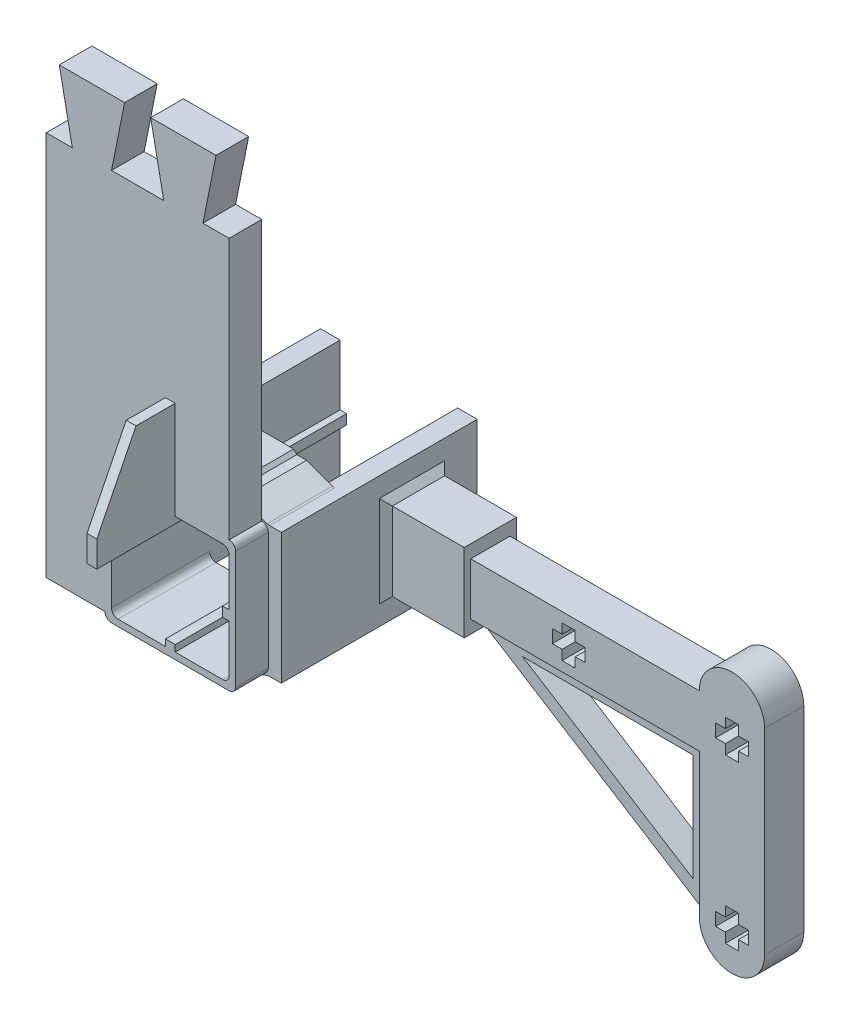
ISO-10303-21;
HEADER;
FILE_DESCRIPTION(('STEP AP214'),'2;1');
FILE_NAME('part.step','',(''),(''),'','','');
FILE_SCHEMA(('AUTOMOTIVE_DESIGN { 1 0 10303 214 1 1 1 1 }'));
ENDSEC;
DATA;
#1=APPLICATION_CONTEXT('core data for automotive mechanical design processes');
#2=APPLICATION_PROTOCOL_DEFINITION('international standard','automotive_design',2000,#1);
#3=PRODUCT_CONTEXT('',#1,'mechanical');
#4=PRODUCT('Part','Part','',(#3));
#5=PRODUCT_RELATED_PRODUCT_CATEGORY('part','',(#4));
#6=PRODUCT_DEFINITION_FORMATION('','',#4);
#7=PRODUCT_DEFINITION_CONTEXT('part definition',#1,'design');
#8=PRODUCT_DEFINITION('design','',#6,#7);
#9=PRODUCT_DEFINITION_SHAPE('','',#8);
#10=(LENGTH_UNIT() NAMED_UNIT(*) SI_UNIT(.MILLI.,.METRE.));
#11=(NAMED_UNIT(*) PLANE_ANGLE_UNIT() SI_UNIT($,.RADIAN.));
#12=(NAMED_UNIT(*) SI_UNIT($,.STERADIAN.) SOLID_ANGLE_UNIT());
#13=UNCERTAINTY_MEASURE_WITH_UNIT(LENGTH_MEASURE(1.E-05),#10,'distance_accuracy_value','');
#14=(GEOMETRIC_REPRESENTATION_CONTEXT(3) GLOBAL_UNCERTAINTY_ASSIGNED_CONTEXT((#13)) GLOBAL_UNIT_ASSIGNED_CONTEXT((#10,
#11,#12)) REPRESENTATION_CONTEXT('',''));
#15=CARTESIAN_POINT('',(0.,0.,0.));
#16=DIRECTION('',(0.,0.,1.));
#17=DIRECTION('',(1.,0.,0.));
#18=AXIS2_PLACEMENT_3D('',#15,#16,#17);
#19=CARTESIAN_POINT('',(-9.,0.,10.));
#20=DIRECTION('',(1.,0.,0.));
#21=DIRECTION('',(0.,0.,-1.));
#22=AXIS2_PLACEMENT_3D('',#19,#20,#21);
#23=PLANE('',#22);
#24=DIRECTION('',(0.,1.,0.));
#25=VECTOR('',#24,1.);
#26=CARTESIAN_POINT('',(-9.,10.,-20.));
#27=LINE('',#26,#25);
#28=CARTESIAN_POINT('',(-9.,-10.,-20.));
#29=VERTEX_POINT('',#28);
#30=CARTESIAN_POINT('',(-9.,-0.749999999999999,-20.));
#31=VERTEX_POINT('',#30);
#32=EDGE_CURVE('E863',#29,#31,#27,.T.);
#33=ORIENTED_EDGE('',*,*,#32,.T.);
#34=DIRECTION('',(0.,0.,-1.));
#35=VECTOR('',#34,1.);
#36=CARTESIAN_POINT('',(-9.,-0.749999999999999,10.));
#37=LINE('',#36,#35);
#38=CARTESIAN_POINT('',(-9.,-0.749999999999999,15.));
#39=VERTEX_POINT('',#38);
#40=EDGE_CURVE('E53',#39,#31,#37,.T.);
#41=ORIENTED_EDGE('',*,*,#40,.F.);
#42=DIRECTION('',(0.,-1.,0.));
#43=VECTOR('',#42,1.);
#44=CARTESIAN_POINT('',(-9.00000000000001,8.,15.));
#45=LINE('',#44,#43);
#46=CARTESIAN_POINT('',(-9.,-8.,15.));
#47=VERTEX_POINT('',#46);
#48=EDGE_CURVE('E1277',#39,#47,#45,.T.);
#49=ORIENTED_EDGE('',*,*,#48,.T.);
#50=DIRECTION('',(0.,0.,-1.));
#51=VECTOR('',#50,1.);
#52=CARTESIAN_POINT('',(-9.,-8.,10.));
#53=LINE('',#52,#51);
#54=CARTESIAN_POINT('',(-9.,-8.,0.));
#55=VERTEX_POINT('',#54);
#56=EDGE_CURVE('E1653',#47,#55,#53,.T.);
#57=ORIENTED_EDGE('',*,*,#56,.T.);
#58=DIRECTION('',(0.,1.,0.));
#59=VECTOR('',#58,1.);
#60=CARTESIAN_POINT('',(-9.,10.,0.));
#61=LINE('',#60,#59);
#62=CARTESIAN_POINT('',(-9.,-10.,0.));
#63=VERTEX_POINT('',#62);
#64=EDGE_CURVE('E888',#63,#55,#61,.T.);
#65=ORIENTED_EDGE('',*,*,#64,.F.);
#66=DIRECTION('',(0.,0.,1.));
#67=VECTOR('',#66,1.);
#68=CARTESIAN_POINT('',(-9.,-10.,-20.));
#69=LINE('',#68,#67);
#70=EDGE_CURVE('E882',#29,#63,#69,.T.);
#71=ORIENTED_EDGE('',*,*,#70,.F.);
#72=EDGE_LOOP('',(#33,#41,#49,#57,#65,#71));
#73=FACE_BOUND('',#72,.T.);
#74=ADVANCED_FACE('F38',(#73),#23,.T.);
#75=DIRECTION('',(0.,0.,1.));
#76=VECTOR('',#75,1.);
#77=CARTESIAN_POINT('',(-9.,0.750000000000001,10.));
#78=LINE('',#77,#76);
#79=CARTESIAN_POINT('',(-9.,0.750000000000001,-20.));
#80=VERTEX_POINT('',#79);
#81=CARTESIAN_POINT('',(-9.,0.750000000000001,15.));
#82=VERTEX_POINT('',#81);
#83=EDGE_CURVE('E841',#80,#82,#78,.T.);
#84=ORIENTED_EDGE('',*,*,#83,.F.);
#85=CARTESIAN_POINT('',(-9.,10.,-20.));
#86=VERTEX_POINT('',#85);
#87=EDGE_CURVE('E844',#80,#86,#27,.T.);
#88=ORIENTED_EDGE('',*,*,#87,.T.);
#89=DIRECTION('',(0.,0.,1.));
#90=VECTOR('',#89,1.);
#91=CARTESIAN_POINT('',(-9.,10.,-20.));
#92=LINE('',#91,#90);
#93=CARTESIAN_POINT('',(-9.,10.,0.));
#94=VERTEX_POINT('',#93);
#95=EDGE_CURVE('E894',#86,#94,#92,.T.);
#96=ORIENTED_EDGE('',*,*,#95,.T.);
#97=CARTESIAN_POINT('',(-9.,8.,0.));
#98=VERTEX_POINT('',#97);
#99=EDGE_CURVE('E886',#98,#94,#61,.T.);
#100=ORIENTED_EDGE('',*,*,#99,.F.);
#101=DIRECTION('',(0.,0.,-1.));
#102=VECTOR('',#101,1.);
#103=CARTESIAN_POINT('',(-9.,8.,10.));
#104=LINE('',#103,#102);
#105=CARTESIAN_POINT('',(-9.00000000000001,8.,15.));
#106=VERTEX_POINT('',#105);
#107=EDGE_CURVE('E1651',#98,#106,#104,.F.);
#108=ORIENTED_EDGE('',*,*,#107,.T.);
#109=EDGE_CURVE('E847',#106,#82,#45,.T.);
#110=ORIENTED_EDGE('',*,*,#109,.T.);
#111=EDGE_LOOP('',(#84,#88,#96,#100,#108,#110));
#112=FACE_BOUND('',#111,.T.);
#113=ADVANCED_FACE('F843',(#112),#23,.T.);
#114=CARTESIAN_POINT('',(0.,0.,0.));
#115=DIRECTION('',(0.,0.,1.));
#116=DIRECTION('',(1.,0.,0.));
#117=AXIS2_PLACEMENT_3D('',#114,#115,#116);
#118=PLANE('',#117);
#119=ORIENTED_EDGE('',*,*,#99,.T.);
#120=DIRECTION('',(-1.,0.,0.));
#121=VECTOR('',#120,1.);
#122=CARTESIAN_POINT('',(-12.,10.,0.));
#123=LINE('',#122,#121);
#124=CARTESIAN_POINT('',(-9.84531663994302,10.,0.));
#125=VERTEX_POINT('',#124);
#126=EDGE_CURVE('E883',#94,#125,#123,.T.);
#127=ORIENTED_EDGE('',*,*,#126,.T.);
#128=CARTESIAN_POINT('',(-9.21979399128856,9.2197939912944,0.));
#129=DIRECTION('',(0.,0.,1.));
#130=DIRECTION('',(1.,0.,0.));
#131=AXIS2_PLACEMENT_3D('',#128,#129,#130);
#132=CIRCLE('',#131,1.);
#133=CARTESIAN_POINT('',(-9.56181413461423,10.1594866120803,0.));
#134=VERTEX_POINT('',#133);
#135=EDGE_CURVE('E1674',#125,#134,#132,.F.);
#136=ORIENTED_EDGE('',*,*,#135,.T.);
#137=DIRECTION('',(0.939692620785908,0.342020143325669,0.));
#138=VECTOR('',#137,1.);
#139=CARTESIAN_POINT('',(-4.38371583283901,12.0441602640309,0.));
#140=LINE('',#139,#138);
#141=CARTESIAN_POINT('',(-5.87878387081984,11.5000000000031,0.));
#142=VERTEX_POINT('',#141);
#143=EDGE_CURVE('E1539',#134,#142,#140,.T.);
#144=ORIENTED_EDGE('',*,*,#143,.T.);
#145=DIRECTION('',(1.,0.,0.));
#146=VECTOR('',#145,1.);
#147=CARTESIAN_POINT('',(0.,11.5000000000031,0.));
#148=LINE('',#147,#146);
#149=CARTESIAN_POINT('',(-4.37878387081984,11.5000000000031,0.));
#150=VERTEX_POINT('',#149);
#151=EDGE_CURVE('E1611',#142,#150,#148,.T.);
#152=ORIENTED_EDGE('',*,*,#151,.T.);
#153=DIRECTION('',(0.707106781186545,0.70710678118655,0.));
#154=VECTOR('',#153,1.);
#155=CARTESIAN_POINT('',(-7.93939193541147,7.93939193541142,0.));
#156=LINE('',#155,#154);
#157=CARTESIAN_POINT('',(-3.87878387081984,12.0000000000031,0.));
#158=VERTEX_POINT('',#157);
#159=EDGE_CURVE('E1608',#150,#158,#156,.T.);
#160=ORIENTED_EDGE('',*,*,#159,.T.);
#161=DIRECTION('',(-1.,0.,0.));
#162=VECTOR('',#161,1.);
#163=CARTESIAN_POINT('',(0.,12.0000000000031,0.));
#164=LINE('',#163,#162);
#165=CARTESIAN_POINT('',(3.87878387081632,12.0000000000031,0.));
#166=VERTEX_POINT('',#165);
#167=EDGE_CURVE('E1605',#166,#158,#164,.T.);
#168=ORIENTED_EDGE('',*,*,#167,.F.);
#169=DIRECTION('',(-0.707106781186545,0.70710678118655,0.));
#170=VECTOR('',#169,1.);
#171=CARTESIAN_POINT('',(7.93939193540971,7.93939193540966,0.));
#172=LINE('',#171,#170);
#173=CARTESIAN_POINT('',(4.37878387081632,11.5000000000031,0.));
#174=VERTEX_POINT('',#173);
#175=EDGE_CURVE('E1603',#174,#166,#172,.T.);
#176=ORIENTED_EDGE('',*,*,#175,.F.);
#177=DIRECTION('',(-1.,0.,0.));
#178=VECTOR('',#177,1.);
#179=CARTESIAN_POINT('',(0.,11.5000000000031,0.));
#180=LINE('',#179,#178);
#181=CARTESIAN_POINT('',(5.87878387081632,11.5000000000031,0.));
#182=VERTEX_POINT('',#181);
#183=EDGE_CURVE('E1601',#182,#174,#180,.T.);
#184=ORIENTED_EDGE('',*,*,#183,.F.);
#185=DIRECTION('',(-0.939692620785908,0.342020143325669,0.));
#186=VECTOR('',#185,1.);
#187=CARTESIAN_POINT('',(4.3837158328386,12.0441602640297,0.));
#188=LINE('',#187,#186);
#189=CARTESIAN_POINT('',(9.83430683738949,10.0603073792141,0.));
#190=VERTEX_POINT('',#189);
#191=EDGE_CURVE('E1599',#190,#182,#188,.T.);
#192=ORIENTED_EDGE('',*,*,#191,.F.);
#193=CARTESIAN_POINT('',(10.1763269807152,11.,0.));
#194=DIRECTION('',(0.,0.,1.));
#195=DIRECTION('',(1.,0.,0.));
#196=AXIS2_PLACEMENT_3D('',#193,#194,#195);
#197=CIRCLE('',#196,1.);
#198=CARTESIAN_POINT('',(10.1763269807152,10.,0.));
#199=VERTEX_POINT('',#198);
#200=EDGE_CURVE('E1712',#190,#199,#197,.T.);
#201=ORIENTED_EDGE('',*,*,#200,.T.);
#202=DIRECTION('',(1.,0.,0.));
#203=VECTOR('',#202,1.);
#204=CARTESIAN_POINT('',(12.,10.,0.));
#205=LINE('',#204,#203);
#206=CARTESIAN_POINT('',(9.,10.,0.));
#207=VERTEX_POINT('',#206);
#208=EDGE_CURVE('E1507',#207,#199,#205,.T.);
#209=ORIENTED_EDGE('',*,*,#208,.F.);
#210=DIRECTION('',(0.,1.,0.));
#211=VECTOR('',#210,1.);
#212=CARTESIAN_POINT('',(9.,10.,0.));
#213=LINE('',#212,#211);
#214=CARTESIAN_POINT('',(9.,8.,0.));
#215=VERTEX_POINT('',#214);
#216=EDGE_CURVE('E1520',#215,#207,#213,.T.);
#217=ORIENTED_EDGE('',*,*,#216,.F.);
#218=CARTESIAN_POINT('',(8.,8.,0.));
#219=DIRECTION('',(0.,0.,1.));
#220=DIRECTION('',(1.,0.,0.));
#221=AXIS2_PLACEMENT_3D('',#218,#219,#220);
#222=CIRCLE('',#221,1.);
#223=CARTESIAN_POINT('',(8.,9.,0.));
#224=VERTEX_POINT('',#223);
#225=EDGE_CURVE('E1703',#215,#224,#222,.T.);
#226=ORIENTED_EDGE('',*,*,#225,.T.);
#227=DIRECTION('',(-1.,0.,0.));
#228=VECTOR('',#227,1.);
#229=CARTESIAN_POINT('',(0.,9.,0.));
#230=LINE('',#229,#228);
#231=CARTESIAN_POINT('',(0.75,9.,0.));
#232=VERTEX_POINT('',#231);
#233=EDGE_CURVE('E1615',#224,#232,#230,.T.);
#234=ORIENTED_EDGE('',*,*,#233,.T.);
#235=DIRECTION('',(0.,-1.,0.));
#236=VECTOR('',#235,1.);
#237=CARTESIAN_POINT('',(0.75,10.,0.));
#238=LINE('',#237,#236);
#239=CARTESIAN_POINT('',(0.75,8.,0.));
#240=VERTEX_POINT('',#239);
#241=EDGE_CURVE('E1483',#232,#240,#238,.T.);
#242=ORIENTED_EDGE('',*,*,#241,.T.);
#243=DIRECTION('',(-1.,0.,0.));
#244=VECTOR('',#243,1.);
#245=CARTESIAN_POINT('',(-0.75,8.,0.));
#246=LINE('',#245,#244);
#247=CARTESIAN_POINT('',(-0.75,8.,0.));
#248=VERTEX_POINT('',#247);
#249=EDGE_CURVE('E1488',#240,#248,#246,.T.);
#250=ORIENTED_EDGE('',*,*,#249,.T.);
#251=DIRECTION('',(0.,1.,0.));
#252=VECTOR('',#251,1.);
#253=CARTESIAN_POINT('',(-0.75,10.,0.));
#254=LINE('',#253,#252);
#255=CARTESIAN_POINT('',(-0.75,9.,0.));
#256=VERTEX_POINT('',#255);
#257=EDGE_CURVE('E1484',#248,#256,#254,.T.);
#258=ORIENTED_EDGE('',*,*,#257,.T.);
#259=CARTESIAN_POINT('',(-8.,9.,0.));
#260=VERTEX_POINT('',#259);
#261=EDGE_CURVE('E1614',#256,#260,#230,.T.);
#262=ORIENTED_EDGE('',*,*,#261,.T.);
#263=CARTESIAN_POINT('',(-8.,8.,0.));
#264=DIRECTION('',(0.,0.,1.));
#265=DIRECTION('',(1.,0.,0.));
#266=AXIS2_PLACEMENT_3D('',#263,#264,#265);
#267=CIRCLE('',#266,1.);
#268=EDGE_CURVE('E1700',#260,#98,#267,.T.);
#269=ORIENTED_EDGE('',*,*,#268,.T.);
#270=EDGE_LOOP('',(#119,#127,#136,#144,#152,#160,#168,#176,#184,#192,#201,#209,#217,#226,#234,
#242,#250,#258,#262,#269));
#271=FACE_BOUND('',#270,.T.);
#272=ADVANCED_FACE('F1903',(#271),#118,.F.);
#273=CARTESIAN_POINT('',(-9.00000000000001,60.,10.));
#274=DIRECTION('',(0.,0.,1.));
#275=DIRECTION('',(1.,0.,0.));
#276=AXIS2_PLACEMENT_3D('',#273,#274,#275);
#277=PLANE('',#276);
#278=DIRECTION('',(0.,-1.,0.));
#279=VECTOR('',#278,1.);
#280=CARTESIAN_POINT('',(-12.,0.,10.));
#281=LINE('',#280,#279);
#282=CARTESIAN_POINT('',(-12.,10.,10.));
#283=VERTEX_POINT('',#282);
#284=CARTESIAN_POINT('',(-12.,-9.,10.));
#285=VERTEX_POINT('',#284);
#286=EDGE_CURVE('E1543',#283,#285,#281,.T.);
#287=ORIENTED_EDGE('',*,*,#286,.T.);
#288=DIRECTION('',(-1.,0.,0.));
#289=VECTOR('',#288,1.);
#290=CARTESIAN_POINT('',(-9.99999999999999,-9.,9.99999999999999));
#291=LINE('',#290,#289);
#292=CARTESIAN_POINT('',(-19.,-9.,9.99999999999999));
#293=VERTEX_POINT('',#292);
#294=EDGE_CURVE('E1247',#285,#293,#291,.T.);
#295=ORIENTED_EDGE('',*,*,#294,.T.);
#296=DIRECTION('',(0.,1.,0.));
#297=VECTOR('',#296,1.);
#298=CARTESIAN_POINT('',(-19.,-9.,9.99999999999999));
#299=LINE('',#298,#297);
#300=CARTESIAN_POINT('',(-19.,50.,9.99999999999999));
#301=VERTEX_POINT('',#300);
#302=EDGE_CURVE('E1244',#293,#301,#299,.T.);
#303=ORIENTED_EDGE('',*,*,#302,.T.);
#304=DIRECTION('',(1.,0.,0.));
#305=VECTOR('',#304,1.);
#306=CARTESIAN_POINT('',(0.,50.,10.));
#307=LINE('',#306,#305);
#308=CARTESIAN_POINT('',(-15.,50.,10.));
#309=VERTEX_POINT('',#308);
#310=EDGE_CURVE('E1185',#301,#309,#307,.T.);
#311=ORIENTED_EDGE('',*,*,#310,.T.);
#312=DIRECTION('',(0.196116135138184,-0.98058067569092,0.));
#313=VECTOR('',#312,1.);
#314=CARTESIAN_POINT('',(-4.80769230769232,-0.961538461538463,10.));
#315=LINE('',#314,#313);
#316=CARTESIAN_POINT('',(-17.,60.,10.));
#317=VERTEX_POINT('',#316);
#318=EDGE_CURVE('E1183',#317,#309,#315,.T.);
#319=ORIENTED_EDGE('',*,*,#318,.F.);
#320=DIRECTION('',(-1.,0.,0.));
#321=VECTOR('',#320,1.);
#322=CARTESIAN_POINT('',(-9.00000000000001,60.,10.));
#323=LINE('',#322,#321);
#324=CARTESIAN_POINT('',(-7.,60.,10.));
#325=VERTEX_POINT('',#324);
#326=EDGE_CURVE('E1262',#325,#317,#323,.T.);
#327=ORIENTED_EDGE('',*,*,#326,.F.);
#328=DIRECTION('',(0.196116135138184,0.98058067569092,0.));
#329=VECTOR('',#328,1.);
#330=CARTESIAN_POINT('',(-18.2692307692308,3.65384615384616,10.));
#331=LINE('',#330,#329);
#332=CARTESIAN_POINT('',(-9.,50.,10.));
#333=VERTEX_POINT('',#332);
#334=EDGE_CURVE('E1210',#333,#325,#331,.T.);
#335=ORIENTED_EDGE('',*,*,#334,.F.);
#336=DIRECTION('',(1.,0.,0.));
#337=VECTOR('',#336,1.);
#338=CARTESIAN_POINT('',(0.,50.,10.));
#339=LINE('',#338,#337);
#340=CARTESIAN_POINT('',(-1.,50.,10.));
#341=VERTEX_POINT('',#340);
#342=EDGE_CURVE('E1203',#333,#341,#339,.T.);
#343=ORIENTED_EDGE('',*,*,#342,.T.);
#344=DIRECTION('',(-0.196116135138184,0.98058067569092,0.));
#345=VECTOR('',#344,1.);
#346=CARTESIAN_POINT('',(8.65384615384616,1.73076923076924,10.));
#347=LINE('',#346,#345);
#348=CARTESIAN_POINT('',(-3.00000000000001,60.,10.));
#349=VERTEX_POINT('',#348);
#350=EDGE_CURVE('E1206',#341,#349,#347,.T.);
#351=ORIENTED_EDGE('',*,*,#350,.T.);
#352=CARTESIAN_POINT('',(7.,60.,10.));
#353=VERTEX_POINT('',#352);
#354=EDGE_CURVE('E1265',#353,#349,#323,.T.);
#355=ORIENTED_EDGE('',*,*,#354,.F.);
#356=DIRECTION('',(-0.196116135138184,-0.98058067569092,0.));
#357=VECTOR('',#356,1.);
#358=CARTESIAN_POINT('',(-4.80769230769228,0.961538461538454,10.));
#359=LINE('',#358,#357);
#360=CARTESIAN_POINT('',(5.,50.,10.));
#361=VERTEX_POINT('',#360);
#362=EDGE_CURVE('E1228',#353,#361,#359,.T.);
#363=ORIENTED_EDGE('',*,*,#362,.T.);
#364=DIRECTION('',(1.,0.,0.));
#365=VECTOR('',#364,1.);
#366=CARTESIAN_POINT('',(0.,50.,10.));
#367=LINE('',#366,#365);
#368=CARTESIAN_POINT('',(8.99999999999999,50.,10.));
#369=VERTEX_POINT('',#368);
#370=EDGE_CURVE('E1231',#361,#369,#367,.T.);
#371=ORIENTED_EDGE('',*,*,#370,.T.);
#372=DIRECTION('',(0.,-1.,0.));
#373=VECTOR('',#372,1.);
#374=CARTESIAN_POINT('',(8.99999999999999,60.,10.));
#375=LINE('',#374,#373);
#376=CARTESIAN_POINT('',(9.,10.3639702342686,10.));
#377=VERTEX_POINT('',#376);
#378=EDGE_CURVE('E1266',#369,#377,#375,.T.);
#379=ORIENTED_EDGE('',*,*,#378,.T.);
#380=DIRECTION('',(-0.939692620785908,0.342020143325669,0.));
#381=VECTOR('',#380,1.);
#382=CARTESIAN_POINT('',(4.3837158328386,12.0441602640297,10.));
#383=LINE('',#382,#381);
#384=CARTESIAN_POINT('',(5.87878387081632,11.5000000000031,10.));
#385=VERTEX_POINT('',#384);
#386=EDGE_CURVE('E1271',#377,#385,#383,.T.);
#387=ORIENTED_EDGE('',*,*,#386,.T.);
#388=DIRECTION('',(-1.,0.,0.));
#389=VECTOR('',#388,1.);
#390=CARTESIAN_POINT('',(0.,11.5000000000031,10.));
#391=LINE('',#390,#389);
#392=CARTESIAN_POINT('',(4.37878387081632,11.5000000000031,10.));
#393=VERTEX_POINT('',#392);
#394=EDGE_CURVE('E1565',#385,#393,#391,.T.);
#395=ORIENTED_EDGE('',*,*,#394,.T.);
#396=DIRECTION('',(-0.707106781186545,0.70710678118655,0.));
#397=VECTOR('',#396,1.);
#398=CARTESIAN_POINT('',(7.93939193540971,7.93939193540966,10.));
#399=LINE('',#398,#397);
#400=CARTESIAN_POINT('',(3.87878387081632,12.0000000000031,10.));
#401=VERTEX_POINT('',#400);
#402=EDGE_CURVE('E1568',#393,#401,#399,.T.);
#403=ORIENTED_EDGE('',*,*,#402,.T.);
#404=DIRECTION('',(-1.,0.,0.));
#405=VECTOR('',#404,1.);
#406=CARTESIAN_POINT('',(0.,12.0000000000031,10.));
#407=LINE('',#406,#405);
#408=CARTESIAN_POINT('',(-3.87878387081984,12.0000000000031,10.));
#409=VERTEX_POINT('',#408);
#410=EDGE_CURVE('E1571',#401,#409,#407,.T.);
#411=ORIENTED_EDGE('',*,*,#410,.T.);
#412=DIRECTION('',(0.707106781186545,0.70710678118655,0.));
#413=VECTOR('',#412,1.);
#414=CARTESIAN_POINT('',(-7.93939193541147,7.93939193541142,10.));
#415=LINE('',#414,#413);
#416=CARTESIAN_POINT('',(-4.37878387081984,11.5000000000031,10.));
#417=VERTEX_POINT('',#416);
#418=EDGE_CURVE('E1574',#417,#409,#415,.T.);
#419=ORIENTED_EDGE('',*,*,#418,.F.);
#420=DIRECTION('',(1.,0.,0.));
#421=VECTOR('',#420,1.);
#422=CARTESIAN_POINT('',(0.,11.5000000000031,10.));
#423=LINE('',#422,#421);
#424=CARTESIAN_POINT('',(-5.87878387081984,11.5000000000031,10.));
#425=VERTEX_POINT('',#424);
#426=EDGE_CURVE('E1577',#425,#417,#423,.T.);
#427=ORIENTED_EDGE('',*,*,#426,.F.);
#428=DIRECTION('',(0.939692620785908,0.342020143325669,0.));
#429=VECTOR('',#428,1.);
#430=CARTESIAN_POINT('',(-4.38371583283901,12.0441602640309,10.));
#431=LINE('',#430,#429);
#432=CARTESIAN_POINT('',(-9.56181413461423,10.1594866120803,10.));
#433=VERTEX_POINT('',#432);
#434=EDGE_CURVE('E1541',#433,#425,#431,.T.);
#435=ORIENTED_EDGE('',*,*,#434,.F.);
#436=CARTESIAN_POINT('',(-9.21979399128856,9.2197939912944,10.));
#437=DIRECTION('',(0.,0.,1.));
#438=DIRECTION('',(1.,0.,0.));
#439=AXIS2_PLACEMENT_3D('',#436,#437,#438);
#440=CIRCLE('',#439,1.);
#441=CARTESIAN_POINT('',(-10.,9.84531663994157,10.));
#442=VERTEX_POINT('',#441);
#443=EDGE_CURVE('E1681',#433,#442,#440,.T.);
#444=ORIENTED_EDGE('',*,*,#443,.T.);
#445=DIRECTION('',(0.,1.,0.));
#446=VECTOR('',#445,1.);
#447=CARTESIAN_POINT('',(-10.,-10.,10.));
#448=LINE('',#447,#446);
#449=CARTESIAN_POINT('',(-10.,10.,10.));
#450=VERTEX_POINT('',#449);
#451=EDGE_CURVE('E904',#442,#450,#448,.T.);
#452=ORIENTED_EDGE('',*,*,#451,.T.);
#453=DIRECTION('',(-1.,0.,0.));
#454=VECTOR('',#453,1.);
#455=CARTESIAN_POINT('',(-10.,10.,10.));
#456=LINE('',#455,#454);
#457=EDGE_CURVE('E908',#450,#283,#456,.T.);
#458=ORIENTED_EDGE('',*,*,#457,.T.);
#459=EDGE_LOOP('',(#287,#295,#303,#311,#319,#327,#335,#343,#351,#355,#363,#371,#379,#387,#395,
#403,#411,#419,#427,#435,#444,#452,#458));
#460=FACE_BOUND('',#459,.T.);
#461=ADVANCED_FACE('F1992',(#460),#277,.F.);
#462=CARTESIAN_POINT('',(-9.21979399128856,9.2197939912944,10.));
#463=DIRECTION('',(0.,0.,1.));
#464=DIRECTION('',(1.,0.,0.));
#465=AXIS2_PLACEMENT_3D('',#462,#463,#464);
#466=CYLINDRICAL_SURFACE('',#465,1.);
#467=CARTESIAN_POINT('',(-10.,9.84531663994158,0.));
#468=VERTEX_POINT('',#467);
#469=EDGE_CURVE('E1675',#468,#125,#132,.F.);
#470=ORIENTED_EDGE('',*,*,#469,.F.);
#471=DIRECTION('',(0.,0.,1.));
#472=VECTOR('',#471,1.);
#473=CARTESIAN_POINT('',(-10.,9.84531663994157,10.));
#474=LINE('',#473,#472);
#475=EDGE_CURVE('E918',#468,#442,#474,.T.);
#476=ORIENTED_EDGE('',*,*,#475,.T.);
#477=ORIENTED_EDGE('',*,*,#443,.F.);
#478=DIRECTION('',(0.,0.,-1.));
#479=VECTOR('',#478,1.);
#480=CARTESIAN_POINT('',(-9.56181413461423,10.1594866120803,10.));
#481=LINE('',#480,#479);
#482=EDGE_CURVE('E1677',#134,#433,#481,.F.);
#483=ORIENTED_EDGE('',*,*,#482,.F.);
#484=ORIENTED_EDGE('',*,*,#135,.F.);
#485=EDGE_LOOP('',(#470,#476,#477,#483,#484));
#486=FACE_BOUND('',#485,.T.);
#487=ADVANCED_FACE('F1988',(#486),#466,.T.);
#488=CARTESIAN_POINT('',(-9.21979399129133,-9.21979399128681,10.));
#489=DIRECTION('',(0.,0.,1.));
#490=DIRECTION('',(1.,0.,0.));
#491=AXIS2_PLACEMENT_3D('',#488,#489,#490);
#492=CYLINDRICAL_SURFACE('',#491,1.);
#493=CARTESIAN_POINT('',(-9.21979399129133,-9.21979399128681,10.));
#494=DIRECTION('',(0.,0.,1.));
#495=DIRECTION('',(1.,0.,0.));
#496=AXIS2_PLACEMENT_3D('',#493,#494,#495);
#497=CIRCLE('',#496,1.);
#498=CARTESIAN_POINT('',(-10.,-9.84531663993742,10.));
#499=VERTEX_POINT('',#498);
#500=CARTESIAN_POINT('',(-9.561814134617,-10.1594866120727,10.));
#501=VERTEX_POINT('',#500);
#502=EDGE_CURVE('E60',#499,#501,#497,.T.);
#503=ORIENTED_EDGE('',*,*,#502,.F.);
#504=DIRECTION('',(0.,0.,1.));
#505=VECTOR('',#504,1.);
#506=CARTESIAN_POINT('',(-10.,-9.84531663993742,10.));
#507=LINE('',#506,#505);
#508=CARTESIAN_POINT('',(-10.,-9.84531663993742,0.));
#509=VERTEX_POINT('',#508);
#510=EDGE_CURVE('E11',#499,#509,#507,.F.);
#511=ORIENTED_EDGE('',*,*,#510,.T.);
#512=CARTESIAN_POINT('',(-9.21979399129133,-9.21979399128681,0.));
#513=DIRECTION('',(0.,0.,-1.));
#514=DIRECTION('',(-1.,0.,0.));
#515=AXIS2_PLACEMENT_3D('',#512,#513,#514);
#516=CIRCLE('',#515,1.);
#517=CARTESIAN_POINT('',(-9.84531663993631,-10.,0.));
#518=VERTEX_POINT('',#517);
#519=EDGE_CURVE('E896',#509,#518,#516,.F.);
#520=ORIENTED_EDGE('',*,*,#519,.T.);
#521=CARTESIAN_POINT('',(-9.21979399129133,-9.21979399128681,0.));
#522=DIRECTION('',(0.,0.,1.));
#523=DIRECTION('',(1.,0.,0.));
#524=AXIS2_PLACEMENT_3D('',#521,#522,#523);
#525=CIRCLE('',#524,1.);
#526=CARTESIAN_POINT('',(-9.561814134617,-10.1594866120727,0.));
#527=VERTEX_POINT('',#526);
#528=EDGE_CURVE('E1671',#527,#518,#525,.F.);
#529=ORIENTED_EDGE('',*,*,#528,.F.);
#530=DIRECTION('',(0.,0.,-1.));
#531=VECTOR('',#530,1.);
#532=CARTESIAN_POINT('',(-9.561814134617,-10.1594866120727,0.));
#533=LINE('',#532,#531);
#534=EDGE_CURVE('E1684',#501,#527,#533,.T.);
#535=ORIENTED_EDGE('',*,*,#534,.F.);
#536=EDGE_LOOP('',(#503,#511,#520,#529,#535));
#537=FACE_BOUND('',#536,.T.);
#538=ADVANCED_FACE('F1991',(#537),#492,.T.);
#539=CARTESIAN_POINT('',(-9.,9.,15.));
#540=DIRECTION('',(0.,0.,1.));
#541=DIRECTION('',(1.,0.,0.));
#542=AXIS2_PLACEMENT_3D('',#539,#540,#541);
#543=PLANE('',#542);
#544=DIRECTION('',(1.,0.,0.));
#545=VECTOR('',#544,1.);
#546=CARTESIAN_POINT('',(-9.,60.,15.));
#547=LINE('',#546,#545);
#548=CARTESIAN_POINT('',(-17.,60.,15.));
#549=VERTEX_POINT('',#548);
#550=CARTESIAN_POINT('',(-7.,60.,15.));
#551=VERTEX_POINT('',#550);
#552=EDGE_CURVE('E1261',#549,#551,#547,.T.);
#553=ORIENTED_EDGE('',*,*,#552,.F.);
#554=DIRECTION('',(0.196116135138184,-0.98058067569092,0.));
#555=VECTOR('',#554,1.);
#556=CARTESIAN_POINT('',(-4.80769230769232,-0.961538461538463,15.));
#557=LINE('',#556,#555);
#558=CARTESIAN_POINT('',(-15.,50.,15.));
#559=VERTEX_POINT('',#558);
#560=EDGE_CURVE('E1190',#549,#559,#557,.T.);
#561=ORIENTED_EDGE('',*,*,#560,.T.);
#562=DIRECTION('',(1.,0.,0.));
#563=VECTOR('',#562,1.);
#564=CARTESIAN_POINT('',(0.,50.,15.));
#565=LINE('',#564,#563);
#566=CARTESIAN_POINT('',(-19.,50.,15.));
#567=VERTEX_POINT('',#566);
#568=EDGE_CURVE('E1186',#567,#559,#565,.T.);
#569=ORIENTED_EDGE('',*,*,#568,.F.);
#570=DIRECTION('',(0.,-1.,0.));
#571=VECTOR('',#570,1.);
#572=CARTESIAN_POINT('',(-19.,-9.,15.));
#573=LINE('',#572,#571);
#574=CARTESIAN_POINT('',(-19.,-9.,15.));
#575=VERTEX_POINT('',#574);
#576=EDGE_CURVE('E1198',#567,#575,#573,.T.);
#577=ORIENTED_EDGE('',*,*,#576,.T.);
#578=DIRECTION('',(1.,0.,0.));
#579=VECTOR('',#578,1.);
#580=CARTESIAN_POINT('',(-9.99999999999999,-9.,15.));
#581=LINE('',#580,#579);
#582=CARTESIAN_POINT('',(-9.99999999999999,-9.,15.));
#583=VERTEX_POINT('',#582);
#584=EDGE_CURVE('E1254',#575,#583,#581,.T.);
#585=ORIENTED_EDGE('',*,*,#584,.T.);
#586=CARTESIAN_POINT('',(-9.,-9.,15.));
#587=DIRECTION('',(0.,0.,1.));
#588=DIRECTION('',(-1.,0.,0.));
#589=AXIS2_PLACEMENT_3D('',#586,#587,#588);
#590=CIRCLE('',#589,1.);
#591=CARTESIAN_POINT('',(-9.,-10.,15.));
#592=VERTEX_POINT('',#591);
#593=EDGE_CURVE('E1300',#583,#592,#590,.T.);
#594=ORIENTED_EDGE('',*,*,#593,.T.);
#595=DIRECTION('',(1.,0.,0.));
#596=VECTOR('',#595,1.);
#597=CARTESIAN_POINT('',(9.00000000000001,-9.99999999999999,15.));
#598=LINE('',#597,#596);
#599=CARTESIAN_POINT('',(9.00000000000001,-9.99999999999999,15.));
#600=VERTEX_POINT('',#599);
#601=EDGE_CURVE('E1302',#592,#600,#598,.T.);
#602=ORIENTED_EDGE('',*,*,#601,.T.);
#603=CARTESIAN_POINT('',(9.00000000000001,-8.99999999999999,15.));
#604=DIRECTION('',(0.,0.,1.));
#605=DIRECTION('',(-1.,0.,0.));
#606=AXIS2_PLACEMENT_3D('',#603,#604,#605);
#607=CIRCLE('',#606,1.);
#608=CARTESIAN_POINT('',(10.,-8.99999999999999,15.));
#609=VERTEX_POINT('',#608);
#610=EDGE_CURVE('E1305',#600,#609,#607,.T.);
#611=ORIENTED_EDGE('',*,*,#610,.T.);
#612=DIRECTION('',(0.,1.,0.));
#613=VECTOR('',#612,1.);
#614=CARTESIAN_POINT('',(10.,9.00000000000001,15.));
#615=LINE('',#614,#613);
#616=CARTESIAN_POINT('',(10.,9.00000000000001,15.));
#617=VERTEX_POINT('',#616);
#618=EDGE_CURVE('E1307',#609,#617,#615,.T.);
#619=ORIENTED_EDGE('',*,*,#618,.T.);
#620=CARTESIAN_POINT('',(9.,9.00000000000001,15.));
#621=DIRECTION('',(0.,0.,1.));
#622=DIRECTION('',(-1.,0.,0.));
#623=AXIS2_PLACEMENT_3D('',#620,#621,#622);
#624=CIRCLE('',#623,1.);
#625=CARTESIAN_POINT('',(9.,10.,15.));
#626=VERTEX_POINT('',#625);
#627=EDGE_CURVE('E1309',#617,#626,#624,.T.);
#628=ORIENTED_EDGE('',*,*,#627,.T.);
#629=DIRECTION('',(0.,-1.,0.));
#630=VECTOR('',#629,1.);
#631=CARTESIAN_POINT('',(8.99999999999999,60.,15.));
#632=LINE('',#631,#630);
#633=CARTESIAN_POINT('',(8.99999999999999,50.,15.));
#634=VERTEX_POINT('',#633);
#635=EDGE_CURVE('E1268',#634,#626,#632,.T.);
#636=ORIENTED_EDGE('',*,*,#635,.F.);
#637=DIRECTION('',(1.,0.,0.));
#638=VECTOR('',#637,1.);
#639=CARTESIAN_POINT('',(0.,50.,15.));
#640=LINE('',#639,#638);
#641=CARTESIAN_POINT('',(5.,50.,15.));
#642=VERTEX_POINT('',#641);
#643=EDGE_CURVE('E1232',#642,#634,#640,.T.);
#644=ORIENTED_EDGE('',*,*,#643,.F.);
#645=DIRECTION('',(-0.196116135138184,-0.98058067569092,0.));
#646=VECTOR('',#645,1.);
#647=CARTESIAN_POINT('',(-4.80769230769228,0.961538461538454,15.));
#648=LINE('',#647,#646);
#649=CARTESIAN_POINT('',(7.,60.,15.));
#650=VERTEX_POINT('',#649);
#651=EDGE_CURVE('E1177',#650,#642,#648,.T.);
#652=ORIENTED_EDGE('',*,*,#651,.F.);
#653=CARTESIAN_POINT('',(-3.00000000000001,60.,15.));
#654=VERTEX_POINT('',#653);
#655=EDGE_CURVE('E1252',#654,#650,#547,.T.);
#656=ORIENTED_EDGE('',*,*,#655,.F.);
#657=DIRECTION('',(-0.196116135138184,0.98058067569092,0.));
#658=VECTOR('',#657,1.);
#659=CARTESIAN_POINT('',(8.65384615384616,1.73076923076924,15.));
#660=LINE('',#659,#658);
#661=CARTESIAN_POINT('',(-1.,50.,15.));
#662=VERTEX_POINT('',#661);
#663=EDGE_CURVE('E1216',#662,#654,#660,.T.);
#664=ORIENTED_EDGE('',*,*,#663,.F.);
#665=DIRECTION('',(1.,0.,0.));
#666=VECTOR('',#665,1.);
#667=CARTESIAN_POINT('',(0.,50.,15.));
#668=LINE('',#667,#666);
#669=CARTESIAN_POINT('',(-9.,50.,15.));
#670=VERTEX_POINT('',#669);
#671=EDGE_CURVE('E1213',#670,#662,#668,.T.);
#672=ORIENTED_EDGE('',*,*,#671,.F.);
#673=DIRECTION('',(0.196116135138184,0.98058067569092,0.));
#674=VECTOR('',#673,1.);
#675=CARTESIAN_POINT('',(-18.2692307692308,3.65384615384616,15.));
#676=LINE('',#675,#674);
#677=EDGE_CURVE('E1207',#670,#551,#676,.T.);
#678=ORIENTED_EDGE('',*,*,#677,.T.);
#679=EDGE_LOOP('',(#553,#561,#569,#577,#585,#594,#602,#611,#619,#628,#636,#644,#652,#656,#664,
#672,#678));
#680=FACE_BOUND('',#679,.T.);
#681=DIRECTION('',(-1.,0.,0.));
#682=VECTOR('',#681,1.);
#683=CARTESIAN_POINT('',(0.750000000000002,24.,15.));
#684=LINE('',#683,#682);
#685=CARTESIAN_POINT('',(0.750000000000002,24.,15.));
#686=VERTEX_POINT('',#685);
#687=CARTESIAN_POINT('',(-0.749999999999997,24.,15.));
#688=VERTEX_POINT('',#687);
#689=EDGE_CURVE('E952',#686,#688,#684,.T.);
#690=ORIENTED_EDGE('',*,*,#689,.F.);
#691=DIRECTION('',(0.,-1.,0.));
#692=VECTOR('',#691,1.);
#693=CARTESIAN_POINT('',(0.750000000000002,24.,15.));
#694=LINE('',#693,#692);
#695=CARTESIAN_POINT('',(0.75,9.,15.));
#696=VERTEX_POINT('',#695);
#697=EDGE_CURVE('E928',#686,#696,#694,.T.);
#698=ORIENTED_EDGE('',*,*,#697,.T.);
#699=DIRECTION('',(-1.,0.,0.));
#700=VECTOR('',#699,1.);
#701=CARTESIAN_POINT('',(8.,9.,15.));
#702=LINE('',#701,#700);
#703=CARTESIAN_POINT('',(8.,9.,15.));
#704=VERTEX_POINT('',#703);
#705=EDGE_CURVE('E1297',#704,#696,#702,.T.);
#706=ORIENTED_EDGE('',*,*,#705,.F.);
#707=CARTESIAN_POINT('',(8.,8.,15.));
#708=DIRECTION('',(0.,0.,1.));
#709=DIRECTION('',(-1.,0.,0.));
#710=AXIS2_PLACEMENT_3D('',#707,#708,#709);
#711=CIRCLE('',#710,1.);
#712=CARTESIAN_POINT('',(9.,8.,15.));
#713=VERTEX_POINT('',#712);
#714=EDGE_CURVE('E1293',#713,#704,#711,.T.);
#715=ORIENTED_EDGE('',*,*,#714,.F.);
#716=DIRECTION('',(0.,1.,0.));
#717=VECTOR('',#716,1.);
#718=CARTESIAN_POINT('',(9.,8.,15.));
#719=LINE('',#718,#717);
#720=CARTESIAN_POINT('',(9.,0.749999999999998,15.));
#721=VERTEX_POINT('',#720);
#722=EDGE_CURVE('E1289',#721,#713,#719,.T.);
#723=ORIENTED_EDGE('',*,*,#722,.F.);
#724=DIRECTION('',(-1.,0.,0.));
#725=VECTOR('',#724,1.);
#726=CARTESIAN_POINT('',(9.,0.749999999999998,15.));
#727=LINE('',#726,#725);
#728=CARTESIAN_POINT('',(8.,0.749999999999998,15.));
#729=VERTEX_POINT('',#728);
#730=EDGE_CURVE('E962',#721,#729,#727,.T.);
#731=ORIENTED_EDGE('',*,*,#730,.T.);
#732=DIRECTION('',(0.,-1.,0.));
#733=VECTOR('',#732,1.);
#734=CARTESIAN_POINT('',(8.,0.749999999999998,15.));
#735=LINE('',#734,#733);
#736=CARTESIAN_POINT('',(8.,-0.750000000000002,15.));
#737=VERTEX_POINT('',#736);
#738=EDGE_CURVE('E955',#729,#737,#735,.T.);
#739=ORIENTED_EDGE('',*,*,#738,.T.);
#740=DIRECTION('',(1.,0.,0.));
#741=VECTOR('',#740,1.);
#742=CARTESIAN_POINT('',(8.,-0.750000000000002,15.));
#743=LINE('',#742,#741);
#744=CARTESIAN_POINT('',(9.,-0.750000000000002,15.));
#745=VERTEX_POINT('',#744);
#746=EDGE_CURVE('E966',#737,#745,#743,.T.);
#747=ORIENTED_EDGE('',*,*,#746,.T.);
#748=CARTESIAN_POINT('',(8.99999999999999,-8.,15.));
#749=VERTEX_POINT('',#748);
#750=EDGE_CURVE('E1290',#749,#745,#719,.T.);
#751=ORIENTED_EDGE('',*,*,#750,.F.);
#752=CARTESIAN_POINT('',(8.,-8.,15.));
#753=DIRECTION('',(0.,0.,1.));
#754=DIRECTION('',(-1.,0.,0.));
#755=AXIS2_PLACEMENT_3D('',#752,#753,#754);
#756=CIRCLE('',#755,0.999999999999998);
#757=CARTESIAN_POINT('',(8.,-8.99999999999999,15.));
#758=VERTEX_POINT('',#757);
#759=EDGE_CURVE('E1286',#758,#749,#756,.T.);
#760=ORIENTED_EDGE('',*,*,#759,.F.);
#761=DIRECTION('',(1.,0.,0.));
#762=VECTOR('',#761,1.);
#763=CARTESIAN_POINT('',(8.,-9.,15.));
#764=LINE('',#763,#762);
#765=CARTESIAN_POINT('',(0.749999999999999,-9.,15.));
#766=VERTEX_POINT('',#765);
#767=EDGE_CURVE('E1282',#766,#758,#764,.T.);
#768=ORIENTED_EDGE('',*,*,#767,.F.);
#769=DIRECTION('',(0.,1.,0.));
#770=VECTOR('',#769,1.);
#771=CARTESIAN_POINT('',(0.749999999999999,-9.,15.));
#772=LINE('',#771,#770);
#773=CARTESIAN_POINT('',(0.749999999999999,-8.,15.));
#774=VERTEX_POINT('',#773);
#775=EDGE_CURVE('E979',#766,#774,#772,.T.);
#776=ORIENTED_EDGE('',*,*,#775,.T.);
#777=DIRECTION('',(-1.,0.,0.));
#778=VECTOR('',#777,1.);
#779=CARTESIAN_POINT('',(0.749999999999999,-8.,15.));
#780=LINE('',#779,#778);
#781=CARTESIAN_POINT('',(-0.750000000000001,-8.,15.));
#782=VERTEX_POINT('',#781);
#783=EDGE_CURVE('E974',#774,#782,#780,.T.);
#784=ORIENTED_EDGE('',*,*,#783,.T.);
#785=DIRECTION('',(0.,-1.,0.));
#786=VECTOR('',#785,1.);
#787=CARTESIAN_POINT('',(-0.750000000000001,-8.,15.));
#788=LINE('',#787,#786);
#789=CARTESIAN_POINT('',(-0.750000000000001,-9.,15.));
#790=VERTEX_POINT('',#789);
#791=EDGE_CURVE('E983',#782,#790,#788,.T.);
#792=ORIENTED_EDGE('',*,*,#791,.T.);
#793=CARTESIAN_POINT('',(-8.,-9.,15.));
#794=VERTEX_POINT('',#793);
#795=EDGE_CURVE('E1283',#794,#790,#764,.T.);
#796=ORIENTED_EDGE('',*,*,#795,.F.);
#797=CARTESIAN_POINT('',(-8.,-8.,15.));
#798=DIRECTION('',(0.,0.,1.));
#799=DIRECTION('',(-1.,0.,0.));
#800=AXIS2_PLACEMENT_3D('',#797,#798,#799);
#801=CIRCLE('',#800,1.);
#802=EDGE_CURVE('E1279',#47,#794,#801,.T.);
#803=ORIENTED_EDGE('',*,*,#802,.F.);
#804=ORIENTED_EDGE('',*,*,#48,.F.);
#805=DIRECTION('',(1.,0.,0.));
#806=VECTOR('',#805,1.);
#807=CARTESIAN_POINT('',(-9.,-0.749999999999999,15.));
#808=LINE('',#807,#806);
#809=CARTESIAN_POINT('',(-8.,-0.749999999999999,15.));
#810=VERTEX_POINT('',#809);
#811=EDGE_CURVE('E971',#39,#810,#808,.T.);
#812=ORIENTED_EDGE('',*,*,#811,.T.);
#813=DIRECTION('',(0.,1.,0.));
#814=VECTOR('',#813,1.);
#815=CARTESIAN_POINT('',(-8.,-0.749999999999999,15.));
#816=LINE('',#815,#814);
#817=CARTESIAN_POINT('',(-8.,0.750000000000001,15.));
#818=VERTEX_POINT('',#817);
#819=EDGE_CURVE('E965',#810,#818,#816,.T.);
#820=ORIENTED_EDGE('',*,*,#819,.T.);
#821=DIRECTION('',(-1.,0.,0.));
#822=VECTOR('',#821,1.);
#823=CARTESIAN_POINT('',(-8.,0.750000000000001,15.));
#824=LINE('',#823,#822);
#825=EDGE_CURVE('E975',#818,#82,#824,.T.);
#826=ORIENTED_EDGE('',*,*,#825,.T.);
#827=ORIENTED_EDGE('',*,*,#109,.F.);
#828=CARTESIAN_POINT('',(-8.,8.,15.));
#829=DIRECTION('',(0.,0.,1.));
#830=DIRECTION('',(1.,0.,0.));
#831=AXIS2_PLACEMENT_3D('',#828,#829,#830);
#832=CIRCLE('',#831,1.);
#833=CARTESIAN_POINT('',(-8.,9.,15.));
#834=VERTEX_POINT('',#833);
#835=EDGE_CURVE('E1274',#834,#106,#832,.T.);
#836=ORIENTED_EDGE('',*,*,#835,.F.);
#837=CARTESIAN_POINT('',(-0.75,9.,15.));
#838=VERTEX_POINT('',#837);
#839=EDGE_CURVE('E1296',#838,#834,#702,.T.);
#840=ORIENTED_EDGE('',*,*,#839,.F.);
#841=DIRECTION('',(0.,-1.,0.));
#842=VECTOR('',#841,1.);
#843=CARTESIAN_POINT('',(-0.749999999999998,24.,15.));
#844=LINE('',#843,#842);
#845=EDGE_CURVE('E927',#688,#838,#844,.T.);
#846=ORIENTED_EDGE('',*,*,#845,.F.);
#847=EDGE_LOOP('',(#690,#698,#706,#715,#723,#731,#739,#747,#751,#760,#768,#776,#784,#792,#796,
#803,#804,#812,#820,#826,#827,#836,#840,#846));
#848=FACE_BOUND('',#847,.T.);
#849=ADVANCED_FACE('F1996',(#680,#848),#543,.T.);
#850=CARTESIAN_POINT('',(9.,0.,10.));
#851=DIRECTION('',(1.,0.,0.));
#852=DIRECTION('',(0.,0.,-1.));
#853=AXIS2_PLACEMENT_3D('',#850,#851,#852);
#854=PLANE('',#853);
#855=ORIENTED_EDGE('',*,*,#750,.T.);
#856=DIRECTION('',(0.,0.,-1.));
#857=VECTOR('',#856,1.);
#858=CARTESIAN_POINT('',(9.,-0.750000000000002,10.));
#859=LINE('',#858,#857);
#860=CARTESIAN_POINT('',(9.,-0.750000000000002,-20.));
#861=VERTEX_POINT('',#860);
#862=EDGE_CURVE('E1458',#745,#861,#859,.T.);
#863=ORIENTED_EDGE('',*,*,#862,.T.);
#864=DIRECTION('',(0.,1.,0.));
#865=VECTOR('',#864,1.);
#866=CARTESIAN_POINT('',(9.,10.,-20.));
#867=LINE('',#866,#865);
#868=CARTESIAN_POINT('',(9.,-10.,-20.));
#869=VERTEX_POINT('',#868);
#870=EDGE_CURVE('E1510',#869,#861,#867,.T.);
#871=ORIENTED_EDGE('',*,*,#870,.F.);
#872=DIRECTION('',(0.,0.,1.));
#873=VECTOR('',#872,1.);
#874=CARTESIAN_POINT('',(9.,-10.,-20.));
#875=LINE('',#874,#873);
#876=CARTESIAN_POINT('',(9.,-10.,0.));
#877=VERTEX_POINT('',#876);
#878=EDGE_CURVE('E1525',#869,#877,#875,.T.);
#879=ORIENTED_EDGE('',*,*,#878,.T.);
#880=CARTESIAN_POINT('',(9.,-8.,0.));
#881=VERTEX_POINT('',#880);
#882=EDGE_CURVE('E1502',#877,#881,#213,.T.);
#883=ORIENTED_EDGE('',*,*,#882,.T.);
#884=DIRECTION('',(0.,0.,-1.));
#885=VECTOR('',#884,1.);
#886=CARTESIAN_POINT('',(9.,-8.,10.));
#887=LINE('',#886,#885);
#888=EDGE_CURVE('E1666',#881,#749,#887,.F.);
#889=ORIENTED_EDGE('',*,*,#888,.T.);
#890=EDGE_LOOP('',(#855,#863,#871,#879,#883,#889));
#891=FACE_BOUND('',#890,.T.);
#892=ADVANCED_FACE('F2145',(#891),#854,.F.);
#893=DIRECTION('',(0.,0.,1.));
#894=VECTOR('',#893,1.);
#895=CARTESIAN_POINT('',(9.,0.749999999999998,10.));
#896=LINE('',#895,#894);
#897=CARTESIAN_POINT('',(9.,0.749999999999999,-20.));
#898=VERTEX_POINT('',#897);
#899=EDGE_CURVE('E1460',#898,#721,#896,.T.);
#900=ORIENTED_EDGE('',*,*,#899,.T.);
#901=ORIENTED_EDGE('',*,*,#722,.T.);
#902=DIRECTION('',(0.,0.,-1.));
#903=VECTOR('',#902,1.);
#904=CARTESIAN_POINT('',(9.,8.,10.));
#905=LINE('',#904,#903);
#906=EDGE_CURVE('E1668',#713,#215,#905,.T.);
#907=ORIENTED_EDGE('',*,*,#906,.T.);
#908=ORIENTED_EDGE('',*,*,#216,.T.);
#909=DIRECTION('',(0.,0.,1.));
#910=VECTOR('',#909,1.);
#911=CARTESIAN_POINT('',(9.,10.,-20.));
#912=LINE('',#911,#910);
#913=CARTESIAN_POINT('',(9.,10.,-20.));
#914=VERTEX_POINT('',#913);
#915=EDGE_CURVE('E1516',#914,#207,#912,.T.);
#916=ORIENTED_EDGE('',*,*,#915,.F.);
#917=EDGE_CURVE('E1509',#898,#914,#867,.T.);
#918=ORIENTED_EDGE('',*,*,#917,.F.);
#919=EDGE_LOOP('',(#900,#901,#907,#908,#916,#918));
#920=FACE_BOUND('',#919,.T.);
#921=ADVANCED_FACE('F2147',(#920),#854,.F.);
#922=CARTESIAN_POINT('',(0.,9.,10.));
#923=DIRECTION('',(0.,-1.,0.));
#924=DIRECTION('',(0.,0.,-1.));
#925=AXIS2_PLACEMENT_3D('',#922,#923,#924);
#926=PLANE('',#925);
#927=ORIENTED_EDGE('',*,*,#705,.T.);
#928=DIRECTION('',(0.,0.,1.));
#929=VECTOR('',#928,1.);
#930=CARTESIAN_POINT('',(0.75,9.,10.));
#931=LINE('',#930,#929);
#932=EDGE_CURVE('E1496',#232,#696,#931,.T.);
#933=ORIENTED_EDGE('',*,*,#932,.F.);
#934=ORIENTED_EDGE('',*,*,#233,.F.);
#935=DIRECTION('',(0.,0.,-1.));
#936=VECTOR('',#935,1.);
#937=CARTESIAN_POINT('',(8.,9.,10.));
#938=LINE('',#937,#936);
#939=EDGE_CURVE('E1661',#224,#704,#938,.F.);
#940=ORIENTED_EDGE('',*,*,#939,.T.);
#941=EDGE_LOOP('',(#927,#933,#934,#940));
#942=FACE_BOUND('',#941,.T.);
#943=ADVANCED_FACE('F1906',(#942),#926,.T.);
#944=DIRECTION('',(0.,0.,-1.));
#945=VECTOR('',#944,1.);
#946=CARTESIAN_POINT('',(-0.75,9.,10.));
#947=LINE('',#946,#945);
#948=EDGE_CURVE('E1499',#838,#256,#947,.T.);
#949=ORIENTED_EDGE('',*,*,#948,.F.);
#950=ORIENTED_EDGE('',*,*,#839,.T.);
#951=DIRECTION('',(0.,0.,-1.));
#952=VECTOR('',#951,1.);
#953=CARTESIAN_POINT('',(-8.,9.,0.));
#954=LINE('',#953,#952);
#955=EDGE_CURVE('E1663',#834,#260,#954,.T.);
#956=ORIENTED_EDGE('',*,*,#955,.T.);
#957=ORIENTED_EDGE('',*,*,#261,.F.);
#958=EDGE_LOOP('',(#949,#950,#956,#957));
#959=FACE_BOUND('',#958,.T.);
#960=ADVANCED_FACE('F2143',(#959),#926,.T.);
#961=CARTESIAN_POINT('',(0.,-9.,10.));
#962=DIRECTION('',(0.,-1.,0.));
#963=DIRECTION('',(0.,0.,-1.));
#964=AXIS2_PLACEMENT_3D('',#961,#962,#963);
#965=PLANE('',#964);
#966=ORIENTED_EDGE('',*,*,#795,.T.);
#967=DIRECTION('',(0.,0.,-1.));
#968=VECTOR('',#967,1.);
#969=CARTESIAN_POINT('',(-0.750000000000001,-9.,10.));
#970=LINE('',#969,#968);
#971=CARTESIAN_POINT('',(-0.750000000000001,-9.,0.));
#972=VERTEX_POINT('',#971);
#973=EDGE_CURVE('E1475',#790,#972,#970,.T.);
#974=ORIENTED_EDGE('',*,*,#973,.T.);
#975=DIRECTION('',(-1.,0.,0.));
#976=VECTOR('',#975,1.);
#977=CARTESIAN_POINT('',(0.,-9.,0.));
#978=LINE('',#977,#976);
#979=CARTESIAN_POINT('',(-8.,-9.,0.));
#980=VERTEX_POINT('',#979);
#981=EDGE_CURVE('E1618',#972,#980,#978,.T.);
#982=ORIENTED_EDGE('',*,*,#981,.T.);
#983=DIRECTION('',(0.,0.,-1.));
#984=VECTOR('',#983,1.);
#985=CARTESIAN_POINT('',(-8.,-9.,10.));
#986=LINE('',#985,#984);
#987=EDGE_CURVE('E1659',#980,#794,#986,.F.);
#988=ORIENTED_EDGE('',*,*,#987,.T.);
#989=EDGE_LOOP('',(#966,#974,#982,#988));
#990=FACE_BOUND('',#989,.T.);
#991=ADVANCED_FACE('F2140',(#990),#965,.F.);
#992=DIRECTION('',(0.,0.,1.));
#993=VECTOR('',#992,1.);
#994=CARTESIAN_POINT('',(0.749999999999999,-9.,10.));
#995=LINE('',#994,#993);
#996=CARTESIAN_POINT('',(0.749999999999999,-9.,0.));
#997=VERTEX_POINT('',#996);
#998=EDGE_CURVE('E1478',#997,#766,#995,.T.);
#999=ORIENTED_EDGE('',*,*,#998,.T.);
#1000=ORIENTED_EDGE('',*,*,#767,.T.);
#1001=DIRECTION('',(0.,0.,-1.));
#1002=VECTOR('',#1001,1.);
#1003=CARTESIAN_POINT('',(8.,-9.,0.));
#1004=LINE('',#1003,#1002);
#1005=CARTESIAN_POINT('',(8.,-9.,0.));
#1006=VERTEX_POINT('',#1005);
#1007=EDGE_CURVE('E1656',#758,#1006,#1004,.T.);
#1008=ORIENTED_EDGE('',*,*,#1007,.T.);
#1009=EDGE_CURVE('E1544',#1006,#997,#978,.T.);
#1010=ORIENTED_EDGE('',*,*,#1009,.T.);
#1011=EDGE_LOOP('',(#999,#1000,#1008,#1010));
#1012=FACE_BOUND('',#1011,.T.);
#1013=ADVANCED_FACE('F2142',(#1012),#965,.F.);
#1014=CARTESIAN_POINT('',(59.,4.,-7.));
#1015=DIRECTION('',(0.,0.,-1.));
#1016=DIRECTION('',(0.,1.,0.));
#1017=AXIS2_PLACEMENT_3D('',#1014,#1015,#1016);
#1018=PLANE('',#1017);
#1019=DIRECTION('',(-1.,0.,0.));
#1020=VECTOR('',#1019,1.);
#1021=CARTESIAN_POINT('',(59.,0.999999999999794,-7.));
#1022=LINE('',#1021,#1020);
#1023=CARTESIAN_POINT('',(38.,0.999999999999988,-7.));
#1024=VERTEX_POINT('',#1023);
#1025=CARTESIAN_POINT('',(36.5,0.999999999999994,-7.));
#1026=VERTEX_POINT('',#1025);
#1027=EDGE_CURVE('E1081',#1024,#1026,#1022,.T.);
#1028=ORIENTED_EDGE('',*,*,#1027,.F.);
#1029=DIRECTION('',(0.,-1.,0.));
#1030=VECTOR('',#1029,1.);
#1031=CARTESIAN_POINT('',(38.,4.00000000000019,-7.));
#1032=LINE('',#1031,#1030);
#1033=CARTESIAN_POINT('',(38.,2.49999999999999,-7.));
#1034=VERTEX_POINT('',#1033);
#1035=EDGE_CURVE('E1079',#1034,#1024,#1032,.T.);
#1036=ORIENTED_EDGE('',*,*,#1035,.F.);
#1037=DIRECTION('',(1.,0.,0.));
#1038=VECTOR('',#1037,1.);
#1039=CARTESIAN_POINT('',(59.,2.5,-7.));
#1040=LINE('',#1039,#1038);
#1041=CARTESIAN_POINT('',(40.,2.49999999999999,-7.));
#1042=VERTEX_POINT('',#1041);
#1043=EDGE_CURVE('E1076',#1034,#1042,#1040,.T.);
#1044=ORIENTED_EDGE('',*,*,#1043,.T.);
#1045=DIRECTION('',(0.,1.,0.));
#1046=VECTOR('',#1045,1.);
#1047=CARTESIAN_POINT('',(40.,4.,-7.));
#1048=LINE('',#1047,#1046);
#1049=CARTESIAN_POINT('',(40.,0.999999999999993,-7.));
#1050=VERTEX_POINT('',#1049);
#1051=EDGE_CURVE('E1074',#1050,#1042,#1048,.T.);
#1052=ORIENTED_EDGE('',*,*,#1051,.F.);
#1053=DIRECTION('',(-1.,0.,0.));
#1054=VECTOR('',#1053,1.);
#1055=CARTESIAN_POINT('',(59.,0.999999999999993,-7.));
#1056=LINE('',#1055,#1054);
#1057=CARTESIAN_POINT('',(41.5,0.999999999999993,-7.));
#1058=VERTEX_POINT('',#1057);
#1059=EDGE_CURVE('E1072',#1058,#1050,#1056,.T.);
#1060=ORIENTED_EDGE('',*,*,#1059,.F.);
#1061=DIRECTION('',(0.,1.,0.));
#1062=VECTOR('',#1061,1.);
#1063=CARTESIAN_POINT('',(41.5,4.,-7.));
#1064=LINE('',#1063,#1062);
#1065=CARTESIAN_POINT('',(41.5,-0.999999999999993,-7.));
#1066=VERTEX_POINT('',#1065);
#1067=EDGE_CURVE('E1070',#1066,#1058,#1064,.T.);
#1068=ORIENTED_EDGE('',*,*,#1067,.F.);
#1069=DIRECTION('',(1.,0.,0.));
#1070=VECTOR('',#1069,1.);
#1071=CARTESIAN_POINT('',(59.,-1.00000000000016,-7.));
#1072=LINE('',#1071,#1070);
#1073=CARTESIAN_POINT('',(40.,-0.999999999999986,-7.));
#1074=VERTEX_POINT('',#1073);
#1075=EDGE_CURVE('E1068',#1074,#1066,#1072,.T.);
#1076=ORIENTED_EDGE('',*,*,#1075,.F.);
#1077=DIRECTION('',(0.,1.,0.));
#1078=VECTOR('',#1077,1.);
#1079=CARTESIAN_POINT('',(40.,4.,-7.));
#1080=LINE('',#1079,#1078);
#1081=CARTESIAN_POINT('',(40.,-2.50000000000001,-7.));
#1082=VERTEX_POINT('',#1081);
#1083=EDGE_CURVE('E1066',#1082,#1074,#1080,.T.);
#1084=ORIENTED_EDGE('',*,*,#1083,.F.);
#1085=DIRECTION('',(1.,0.,0.));
#1086=VECTOR('',#1085,1.);
#1087=CARTESIAN_POINT('',(59.,-2.5,-7.));
#1088=LINE('',#1087,#1086);
#1089=CARTESIAN_POINT('',(38.,-2.50000000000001,-7.));
#1090=VERTEX_POINT('',#1089);
#1091=EDGE_CURVE('E1064',#1090,#1082,#1088,.T.);
#1092=ORIENTED_EDGE('',*,*,#1091,.F.);
#1093=DIRECTION('',(0.,-1.,0.));
#1094=VECTOR('',#1093,1.);
#1095=CARTESIAN_POINT('',(38.,4.,-7.));
#1096=LINE('',#1095,#1094);
#1097=CARTESIAN_POINT('',(38.,-1.00000000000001,-7.));
#1098=VERTEX_POINT('',#1097);
#1099=EDGE_CURVE('E1062',#1098,#1090,#1096,.T.);
#1100=ORIENTED_EDGE('',*,*,#1099,.F.);
#1101=DIRECTION('',(1.,0.,0.));
#1102=VECTOR('',#1101,1.);
#1103=CARTESIAN_POINT('',(59.,-1.00000000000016,-7.));
#1104=LINE('',#1103,#1102);
#1105=CARTESIAN_POINT('',(36.5,-1.00000000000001,-7.));
#1106=VERTEX_POINT('',#1105);
#1107=EDGE_CURVE('E1060',#1106,#1098,#1104,.T.);
#1108=ORIENTED_EDGE('',*,*,#1107,.F.);
#1109=DIRECTION('',(0.,1.,0.));
#1110=VECTOR('',#1109,1.);
#1111=CARTESIAN_POINT('',(36.5,4.,-7.));
#1112=LINE('',#1111,#1110);
#1113=EDGE_CURVE('E991',#1106,#1026,#1112,.T.);
#1114=ORIENTED_EDGE('',*,*,#1113,.T.);
#1115=EDGE_LOOP('',(#1028,#1036,#1044,#1052,#1060,#1068,#1076,#1084,#1092,#1100,#1108,#1114));
#1116=FACE_BOUND('',#1115,.T.);
#1117=DIRECTION('',(0.,-1.,0.));
#1118=VECTOR('',#1117,1.);
#1119=CARTESIAN_POINT('',(24.,4.,-7.));
#1120=LINE('',#1119,#1118);
#1121=CARTESIAN_POINT('',(24.,4.,-7.));
#1122=VERTEX_POINT('',#1121);
#1123=CARTESIAN_POINT('',(24.,-4.,-7.));
#1124=VERTEX_POINT('',#1123);
#1125=EDGE_CURVE('E1404',#1122,#1124,#1120,.T.);
#1126=ORIENTED_EDGE('',*,*,#1125,.T.);
#1127=DIRECTION('',(-1.,0.,0.));
#1128=VECTOR('',#1127,1.);
#1129=CARTESIAN_POINT('',(59.,-4.,-7.));
#1130=LINE('',#1129,#1128);
#1131=CARTESIAN_POINT('',(59.,-4.,-7.));
#1132=VERTEX_POINT('',#1131);
#1133=EDGE_CURVE('E1431',#1132,#1124,#1130,.T.);
#1134=ORIENTED_EDGE('',*,*,#1133,.F.);
#1135=DIRECTION('',(0.,1.,0.));
#1136=VECTOR('',#1135,1.);
#1137=CARTESIAN_POINT('',(59.,4.,-7.));
#1138=LINE('',#1137,#1136);
#1139=CARTESIAN_POINT('',(59.,-26.,-7.));
#1140=VERTEX_POINT('',#1139);
#1141=EDGE_CURVE('E1376',#1140,#1132,#1138,.T.);
#1142=ORIENTED_EDGE('',*,*,#1141,.F.);
#1143=CARTESIAN_POINT('',(64.,-26.,-7.));
#1144=DIRECTION('',(0.,0.,-1.));
#1145=DIRECTION('',(-1.,0.,0.));
#1146=AXIS2_PLACEMENT_3D('',#1143,#1144,#1145);
#1147=CIRCLE('',#1146,5.00000000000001);
#1148=CARTESIAN_POINT('',(69.,-26.,-7.));
#1149=VERTEX_POINT('',#1148);
#1150=EDGE_CURVE('E1391',#1149,#1140,#1147,.T.);
#1151=ORIENTED_EDGE('',*,*,#1150,.F.);
#1152=DIRECTION('',(0.,-1.,0.));
#1153=VECTOR('',#1152,1.);
#1154=CARTESIAN_POINT('',(69.,4.,-7.));
#1155=LINE('',#1154,#1153);
#1156=CARTESIAN_POINT('',(69.,4.,-7.));
#1157=VERTEX_POINT('',#1156);
#1158=EDGE_CURVE('E1387',#1157,#1149,#1155,.T.);
#1159=ORIENTED_EDGE('',*,*,#1158,.F.);
#1160=CARTESIAN_POINT('',(64.,4.,-7.));
#1161=DIRECTION('',(0.,0.,-1.));
#1162=DIRECTION('',(-1.,0.,0.));
#1163=AXIS2_PLACEMENT_3D('',#1160,#1161,#1162);
#1164=CIRCLE('',#1163,4.99999999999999);
#1165=CARTESIAN_POINT('',(59.,4.,-7.));
#1166=VERTEX_POINT('',#1165);
#1167=EDGE_CURVE('E1384',#1166,#1157,#1164,.T.);
#1168=ORIENTED_EDGE('',*,*,#1167,.F.);
#1169=DIRECTION('',(-1.,0.,0.));
#1170=VECTOR('',#1169,1.);
#1171=CARTESIAN_POINT('',(59.,4.,-7.));
#1172=LINE('',#1171,#1170);
#1173=EDGE_CURVE('E1411',#1166,#1122,#1172,.T.);
#1174=ORIENTED_EDGE('',*,*,#1173,.T.);
#1175=EDGE_LOOP('',(#1126,#1134,#1142,#1151,#1159,#1168,#1174));
#1176=FACE_BOUND('',#1175,.T.);
#1177=DIRECTION('',(-1.,0.,0.));
#1178=VECTOR('',#1177,1.);
#1179=CARTESIAN_POINT('',(59.,1.00000000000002,-7.));
#1180=LINE('',#1179,#1178);
#1181=CARTESIAN_POINT('',(63.,0.999999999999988,-7.));
#1182=VERTEX_POINT('',#1181);
#1183=CARTESIAN_POINT('',(61.5,0.999999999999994,-7.));
#1184=VERTEX_POINT('',#1183);
#1185=EDGE_CURVE('E1170',#1182,#1184,#1180,.T.);
#1186=ORIENTED_EDGE('',*,*,#1185,.F.);
#1187=DIRECTION('',(0.,-1.,0.));
#1188=VECTOR('',#1187,1.);
#1189=CARTESIAN_POINT('',(63.0000000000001,3.99999999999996,-7.));
#1190=LINE('',#1189,#1188);
#1191=CARTESIAN_POINT('',(63.,2.49999999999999,-7.));
#1192=VERTEX_POINT('',#1191);
#1193=EDGE_CURVE('E1168',#1192,#1182,#1190,.T.);
#1194=ORIENTED_EDGE('',*,*,#1193,.F.);
#1195=DIRECTION('',(1.,0.,0.));
#1196=VECTOR('',#1195,1.);
#1197=CARTESIAN_POINT('',(59.,2.49999999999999,-7.));
#1198=LINE('',#1197,#1196);
#1199=CARTESIAN_POINT('',(65.,2.49999999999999,-7.));
#1200=VERTEX_POINT('',#1199);
#1201=EDGE_CURVE('E1165',#1192,#1200,#1198,.T.);
#1202=ORIENTED_EDGE('',*,*,#1201,.T.);
#1203=DIRECTION('',(0.,1.,0.));
#1204=VECTOR('',#1203,1.);
#1205=CARTESIAN_POINT('',(65.,4.,-7.));
#1206=LINE('',#1205,#1204);
#1207=CARTESIAN_POINT('',(65.,0.999999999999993,-7.));
#1208=VERTEX_POINT('',#1207);
#1209=EDGE_CURVE('E1163',#1208,#1200,#1206,.T.);
#1210=ORIENTED_EDGE('',*,*,#1209,.F.);
#1211=DIRECTION('',(-1.,0.,0.));
#1212=VECTOR('',#1211,1.);
#1213=CARTESIAN_POINT('',(59.,0.999999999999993,-7.));
#1214=LINE('',#1213,#1212);
#1215=CARTESIAN_POINT('',(66.5,0.999999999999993,-7.));
#1216=VERTEX_POINT('',#1215);
#1217=EDGE_CURVE('E1161',#1216,#1208,#1214,.T.);
#1218=ORIENTED_EDGE('',*,*,#1217,.F.);
#1219=DIRECTION('',(0.,1.,0.));
#1220=VECTOR('',#1219,1.);
#1221=CARTESIAN_POINT('',(66.5,4.,-7.));
#1222=LINE('',#1221,#1220);
#1223=CARTESIAN_POINT('',(66.5,-0.999999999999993,-7.));
#1224=VERTEX_POINT('',#1223);
#1225=EDGE_CURVE('E1159',#1224,#1216,#1222,.T.);
#1226=ORIENTED_EDGE('',*,*,#1225,.F.);
#1227=DIRECTION('',(1.,0.,0.));
#1228=VECTOR('',#1227,1.);
#1229=CARTESIAN_POINT('',(59.,-0.999999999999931,-7.));
#1230=LINE('',#1229,#1228);
#1231=CARTESIAN_POINT('',(65.,-0.999999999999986,-7.));
#1232=VERTEX_POINT('',#1231);
#1233=EDGE_CURVE('E1157',#1232,#1224,#1230,.T.);
#1234=ORIENTED_EDGE('',*,*,#1233,.F.);
#1235=DIRECTION('',(0.,1.,0.));
#1236=VECTOR('',#1235,1.);
#1237=CARTESIAN_POINT('',(65.,4.,-7.));
#1238=LINE('',#1237,#1236);
#1239=CARTESIAN_POINT('',(65.,-2.50000000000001,-7.));
#1240=VERTEX_POINT('',#1239);
#1241=EDGE_CURVE('E1155',#1240,#1232,#1238,.T.);
#1242=ORIENTED_EDGE('',*,*,#1241,.F.);
#1243=DIRECTION('',(1.,0.,0.));
#1244=VECTOR('',#1243,1.);
#1245=CARTESIAN_POINT('',(59.,-2.50000000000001,-7.));
#1246=LINE('',#1245,#1244);
#1247=CARTESIAN_POINT('',(63.,-2.50000000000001,-7.));
#1248=VERTEX_POINT('',#1247);
#1249=EDGE_CURVE('E1153',#1248,#1240,#1246,.T.);
#1250=ORIENTED_EDGE('',*,*,#1249,.F.);
#1251=DIRECTION('',(0.,-1.,0.));
#1252=VECTOR('',#1251,1.);
#1253=CARTESIAN_POINT('',(63.,4.,-7.));
#1254=LINE('',#1253,#1252);
#1255=CARTESIAN_POINT('',(63.,-1.00000000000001,-7.));
#1256=VERTEX_POINT('',#1255);
#1257=EDGE_CURVE('E1151',#1256,#1248,#1254,.T.);
#1258=ORIENTED_EDGE('',*,*,#1257,.F.);
#1259=DIRECTION('',(1.,0.,0.));
#1260=VECTOR('',#1259,1.);
#1261=CARTESIAN_POINT('',(59.,-0.999999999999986,-7.));
#1262=LINE('',#1261,#1260);
#1263=CARTESIAN_POINT('',(61.5,-1.00000000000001,-7.));
#1264=VERTEX_POINT('',#1263);
#1265=EDGE_CURVE('E1149',#1264,#1256,#1262,.T.);
#1266=ORIENTED_EDGE('',*,*,#1265,.F.);
#1267=DIRECTION('',(0.,1.,0.));
#1268=VECTOR('',#1267,1.);
#1269=CARTESIAN_POINT('',(61.5,4.,-7.));
#1270=LINE('',#1269,#1268);
#1271=EDGE_CURVE('E1115',#1264,#1184,#1270,.T.);
#1272=ORIENTED_EDGE('',*,*,#1271,.T.);
#1273=EDGE_LOOP('',(#1186,#1194,#1202,#1210,#1218,#1226,#1234,#1242,#1250,#1258,#1266,#1272));
#1274=FACE_BOUND('',#1273,.T.);
#1275=DIRECTION('',(-1.,0.,0.));
#1276=VECTOR('',#1275,1.);
#1277=CARTESIAN_POINT('',(58.9999999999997,-24.,-7.));
#1278=LINE('',#1277,#1276);
#1279=CARTESIAN_POINT('',(63.,-24.,-7.));
#1280=VERTEX_POINT('',#1279);
#1281=CARTESIAN_POINT('',(61.5,-24.,-7.));
#1282=VERTEX_POINT('',#1281);
#1283=EDGE_CURVE('E1108',#1280,#1282,#1278,.T.);
#1284=ORIENTED_EDGE('',*,*,#1283,.F.);
#1285=DIRECTION('',(0.,-1.,0.));
#1286=VECTOR('',#1285,1.);
#1287=CARTESIAN_POINT('',(63.0000000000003,3.99999999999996,-7.));
#1288=LINE('',#1287,#1286);
#1289=CARTESIAN_POINT('',(63.,-22.5,-7.));
#1290=VERTEX_POINT('',#1289);
#1291=EDGE_CURVE('E1106',#1290,#1280,#1288,.T.);
#1292=ORIENTED_EDGE('',*,*,#1291,.F.);
#1293=DIRECTION('',(1.,0.,0.));
#1294=VECTOR('',#1293,1.);
#1295=CARTESIAN_POINT('',(59.,-22.5,-7.));
#1296=LINE('',#1295,#1294);
#1297=CARTESIAN_POINT('',(65.,-22.5,-7.));
#1298=VERTEX_POINT('',#1297);
#1299=EDGE_CURVE('E1103',#1290,#1298,#1296,.T.);
#1300=ORIENTED_EDGE('',*,*,#1299,.T.);
#1301=DIRECTION('',(0.,1.,0.));
#1302=VECTOR('',#1301,1.);
#1303=CARTESIAN_POINT('',(65.,4.,-7.));
#1304=LINE('',#1303,#1302);
#1305=CARTESIAN_POINT('',(65.,-24.,-7.));
#1306=VERTEX_POINT('',#1305);
#1307=EDGE_CURVE('E1101',#1306,#1298,#1304,.T.);
#1308=ORIENTED_EDGE('',*,*,#1307,.F.);
#1309=DIRECTION('',(-1.,0.,0.));
#1310=VECTOR('',#1309,1.);
#1311=CARTESIAN_POINT('',(59.,-24.,-7.));
#1312=LINE('',#1311,#1310);
#1313=CARTESIAN_POINT('',(66.5,-24.,-7.));
#1314=VERTEX_POINT('',#1313);
#1315=EDGE_CURVE('E1099',#1314,#1306,#1312,.T.);
#1316=ORIENTED_EDGE('',*,*,#1315,.F.);
#1317=DIRECTION('',(0.,1.,0.));
#1318=VECTOR('',#1317,1.);
#1319=CARTESIAN_POINT('',(66.5,4.,-7.));
#1320=LINE('',#1319,#1318);
#1321=CARTESIAN_POINT('',(66.5,-26.,-7.));
#1322=VERTEX_POINT('',#1321);
#1323=EDGE_CURVE('E1097',#1322,#1314,#1320,.T.);
#1324=ORIENTED_EDGE('',*,*,#1323,.F.);
#1325=DIRECTION('',(1.,0.,0.));
#1326=VECTOR('',#1325,1.);
#1327=CARTESIAN_POINT('',(58.9999999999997,-25.9999999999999,-7.));
#1328=LINE('',#1327,#1326);
#1329=CARTESIAN_POINT('',(65.,-26.,-7.));
#1330=VERTEX_POINT('',#1329);
#1331=EDGE_CURVE('E1095',#1330,#1322,#1328,.T.);
#1332=ORIENTED_EDGE('',*,*,#1331,.F.);
#1333=DIRECTION('',(0.,1.,0.));
#1334=VECTOR('',#1333,1.);
#1335=CARTESIAN_POINT('',(65.,4.,-7.));
#1336=LINE('',#1335,#1334);
#1337=CARTESIAN_POINT('',(65.,-27.5,-7.));
#1338=VERTEX_POINT('',#1337);
#1339=EDGE_CURVE('E1093',#1338,#1330,#1336,.T.);
#1340=ORIENTED_EDGE('',*,*,#1339,.F.);
#1341=DIRECTION('',(1.,0.,0.));
#1342=VECTOR('',#1341,1.);
#1343=CARTESIAN_POINT('',(59.,-27.5,-7.));
#1344=LINE('',#1343,#1342);
#1345=CARTESIAN_POINT('',(63.,-27.5,-7.));
#1346=VERTEX_POINT('',#1345);
#1347=EDGE_CURVE('E1091',#1346,#1338,#1344,.T.);
#1348=ORIENTED_EDGE('',*,*,#1347,.F.);
#1349=DIRECTION('',(0.,-1.,0.));
#1350=VECTOR('',#1349,1.);
#1351=CARTESIAN_POINT('',(63.,4.,-7.));
#1352=LINE('',#1351,#1350);
#1353=CARTESIAN_POINT('',(63.,-26.,-7.));
#1354=VERTEX_POINT('',#1353);
#1355=EDGE_CURVE('E1089',#1354,#1346,#1352,.T.);
#1356=ORIENTED_EDGE('',*,*,#1355,.F.);
#1357=DIRECTION('',(1.,0.,0.));
#1358=VECTOR('',#1357,1.);
#1359=CARTESIAN_POINT('',(58.9999999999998,-26.,-7.));
#1360=LINE('',#1359,#1358);
#1361=CARTESIAN_POINT('',(61.5,-26.,-7.));
#1362=VERTEX_POINT('',#1361);
#1363=EDGE_CURVE('E1087',#1362,#1354,#1360,.T.);
#1364=ORIENTED_EDGE('',*,*,#1363,.F.);
#1365=DIRECTION('',(0.,1.,0.));
#1366=VECTOR('',#1365,1.);
#1367=CARTESIAN_POINT('',(61.5,4.,-7.));
#1368=LINE('',#1367,#1366);
#1369=EDGE_CURVE('E1084',#1362,#1282,#1368,.T.);
#1370=ORIENTED_EDGE('',*,*,#1369,.T.);
#1371=EDGE_LOOP('',(#1284,#1292,#1300,#1308,#1316,#1324,#1332,#1340,#1348,#1356,#1364,#1370));
#1372=FACE_BOUND('',#1371,.T.);
#1373=ADVANCED_FACE('F1854',(#1116,#1176,#1274,#1372),#1018,.F.);
#1374=CARTESIAN_POINT('',(59.,4.,-13.));
#1375=DIRECTION('',(0.,0.,1.));
#1376=DIRECTION('',(1.,0.,0.));
#1377=AXIS2_PLACEMENT_3D('',#1374,#1375,#1376);
#1378=PLANE('',#1377);
#1379=DIRECTION('',(1.,0.,0.));
#1380=VECTOR('',#1379,1.);
#1381=CARTESIAN_POINT('',(59.,0.999999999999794,-13.));
#1382=LINE('',#1381,#1380);
#1383=CARTESIAN_POINT('',(36.5,0.999999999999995,-13.));
#1384=VERTEX_POINT('',#1383);
#1385=CARTESIAN_POINT('',(38.,0.999999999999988,-13.));
#1386=VERTEX_POINT('',#1385);
#1387=EDGE_CURVE('E1804',#1384,#1386,#1382,.T.);
#1388=ORIENTED_EDGE('',*,*,#1387,.F.);
#1389=DIRECTION('',(0.,-1.,0.));
#1390=VECTOR('',#1389,1.);
#1391=CARTESIAN_POINT('',(36.5,4.,-13.));
#1392=LINE('',#1391,#1390);
#1393=CARTESIAN_POINT('',(36.5,-1.00000000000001,-13.));
#1394=VERTEX_POINT('',#1393);
#1395=EDGE_CURVE('E1779',#1384,#1394,#1392,.T.);
#1396=ORIENTED_EDGE('',*,*,#1395,.T.);
#1397=DIRECTION('',(-1.,0.,0.));
#1398=VECTOR('',#1397,1.);
#1399=CARTESIAN_POINT('',(59.,-1.00000000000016,-13.));
#1400=LINE('',#1399,#1398);
#1401=CARTESIAN_POINT('',(38.,-1.00000000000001,-13.));
#1402=VERTEX_POINT('',#1401);
#1403=EDGE_CURVE('E1782',#1402,#1394,#1400,.T.);
#1404=ORIENTED_EDGE('',*,*,#1403,.F.);
#1405=DIRECTION('',(0.,1.,0.));
#1406=VECTOR('',#1405,1.);
#1407=CARTESIAN_POINT('',(38.,4.,-13.));
#1408=LINE('',#1407,#1406);
#1409=CARTESIAN_POINT('',(38.,-2.50000000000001,-13.));
#1410=VERTEX_POINT('',#1409);
#1411=EDGE_CURVE('E1785',#1410,#1402,#1408,.T.);
#1412=ORIENTED_EDGE('',*,*,#1411,.F.);
#1413=DIRECTION('',(-1.,0.,0.));
#1414=VECTOR('',#1413,1.);
#1415=CARTESIAN_POINT('',(59.,-2.5,-13.));
#1416=LINE('',#1415,#1414);
#1417=CARTESIAN_POINT('',(40.,-2.50000000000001,-13.));
#1418=VERTEX_POINT('',#1417);
#1419=EDGE_CURVE('E1787',#1418,#1410,#1416,.T.);
#1420=ORIENTED_EDGE('',*,*,#1419,.F.);
#1421=DIRECTION('',(0.,-1.,0.));
#1422=VECTOR('',#1421,1.);
#1423=CARTESIAN_POINT('',(40.,4.,-13.));
#1424=LINE('',#1423,#1422);
#1425=CARTESIAN_POINT('',(40.,-0.999999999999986,-13.));
#1426=VERTEX_POINT('',#1425);
#1427=EDGE_CURVE('E1789',#1426,#1418,#1424,.T.);
#1428=ORIENTED_EDGE('',*,*,#1427,.F.);
#1429=DIRECTION('',(-1.,0.,0.));
#1430=VECTOR('',#1429,1.);
#1431=CARTESIAN_POINT('',(59.,-1.00000000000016,-13.));
#1432=LINE('',#1431,#1430);
#1433=CARTESIAN_POINT('',(41.5,-0.999999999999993,-13.));
#1434=VERTEX_POINT('',#1433);
#1435=EDGE_CURVE('E1791',#1434,#1426,#1432,.T.);
#1436=ORIENTED_EDGE('',*,*,#1435,.F.);
#1437=DIRECTION('',(0.,-1.,0.));
#1438=VECTOR('',#1437,1.);
#1439=CARTESIAN_POINT('',(41.5,4.,-13.));
#1440=LINE('',#1439,#1438);
#1441=CARTESIAN_POINT('',(41.5,0.999999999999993,-13.));
#1442=VERTEX_POINT('',#1441);
#1443=EDGE_CURVE('E1793',#1442,#1434,#1440,.T.);
#1444=ORIENTED_EDGE('',*,*,#1443,.F.);
#1445=DIRECTION('',(1.,0.,0.));
#1446=VECTOR('',#1445,1.);
#1447=CARTESIAN_POINT('',(59.,0.999999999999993,-13.));
#1448=LINE('',#1447,#1446);
#1449=CARTESIAN_POINT('',(40.,0.999999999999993,-13.));
#1450=VERTEX_POINT('',#1449);
#1451=EDGE_CURVE('E1795',#1450,#1442,#1448,.T.);
#1452=ORIENTED_EDGE('',*,*,#1451,.F.);
#1453=DIRECTION('',(0.,-1.,0.));
#1454=VECTOR('',#1453,1.);
#1455=CARTESIAN_POINT('',(40.,4.,-13.));
#1456=LINE('',#1455,#1454);
#1457=CARTESIAN_POINT('',(40.,2.49999999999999,-13.));
#1458=VERTEX_POINT('',#1457);
#1459=EDGE_CURVE('E1797',#1458,#1450,#1456,.T.);
#1460=ORIENTED_EDGE('',*,*,#1459,.F.);
#1461=DIRECTION('',(-1.,0.,0.));
#1462=VECTOR('',#1461,1.);
#1463=CARTESIAN_POINT('',(59.,2.5,-13.));
#1464=LINE('',#1463,#1462);
#1465=CARTESIAN_POINT('',(38.,2.49999999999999,-13.));
#1466=VERTEX_POINT('',#1465);
#1467=EDGE_CURVE('E1799',#1458,#1466,#1464,.T.);
#1468=ORIENTED_EDGE('',*,*,#1467,.T.);
#1469=DIRECTION('',(0.,1.,0.));
#1470=VECTOR('',#1469,1.);
#1471=CARTESIAN_POINT('',(38.,4.00000000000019,-13.));
#1472=LINE('',#1471,#1470);
#1473=EDGE_CURVE('E1802',#1386,#1466,#1472,.T.);
#1474=ORIENTED_EDGE('',*,*,#1473,.F.);
#1475=EDGE_LOOP('',(#1388,#1396,#1404,#1412,#1420,#1428,#1436,#1444,#1452,#1460,#1468,#1474));
#1476=FACE_BOUND('',#1475,.T.);
#1477=DIRECTION('',(0.,1.,0.));
#1478=VECTOR('',#1477,1.);
#1479=CARTESIAN_POINT('',(24.,4.,-13.));
#1480=LINE('',#1479,#1478);
#1481=CARTESIAN_POINT('',(24.,-4.,-13.));
#1482=VERTEX_POINT('',#1481);
#1483=CARTESIAN_POINT('',(24.,4.,-13.));
#1484=VERTEX_POINT('',#1483);
#1485=EDGE_CURVE('E1418',#1482,#1484,#1480,.T.);
#1486=ORIENTED_EDGE('',*,*,#1485,.T.);
#1487=DIRECTION('',(-1.,0.,0.));
#1488=VECTOR('',#1487,1.);
#1489=CARTESIAN_POINT('',(59.,4.,-13.));
#1490=LINE('',#1489,#1488);
#1491=CARTESIAN_POINT('',(59.,4.,-13.));
#1492=VERTEX_POINT('',#1491);
#1493=EDGE_CURVE('E1425',#1492,#1484,#1490,.T.);
#1494=ORIENTED_EDGE('',*,*,#1493,.F.);
#1495=CARTESIAN_POINT('',(64.,4.,-13.));
#1496=DIRECTION('',(0.,0.,-1.));
#1497=DIRECTION('',(-1.,0.,0.));
#1498=AXIS2_PLACEMENT_3D('',#1495,#1496,#1497);
#1499=CIRCLE('',#1498,4.99999999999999);
#1500=CARTESIAN_POINT('',(69.,4.,-13.));
#1501=VERTEX_POINT('',#1500);
#1502=EDGE_CURVE('E1372',#1492,#1501,#1499,.T.);
#1503=ORIENTED_EDGE('',*,*,#1502,.T.);
#1504=DIRECTION('',(0.,-1.,0.));
#1505=VECTOR('',#1504,1.);
#1506=CARTESIAN_POINT('',(69.,4.,-13.));
#1507=LINE('',#1506,#1505);
#1508=CARTESIAN_POINT('',(69.,-26.,-13.));
#1509=VERTEX_POINT('',#1508);
#1510=EDGE_CURVE('E1375',#1501,#1509,#1507,.T.);
#1511=ORIENTED_EDGE('',*,*,#1510,.T.);
#1512=CARTESIAN_POINT('',(64.,-26.,-13.));
#1513=DIRECTION('',(0.,0.,-1.));
#1514=DIRECTION('',(-1.,0.,0.));
#1515=AXIS2_PLACEMENT_3D('',#1512,#1513,#1514);
#1516=CIRCLE('',#1515,5.00000000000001);
#1517=CARTESIAN_POINT('',(59.,-26.,-13.));
#1518=VERTEX_POINT('',#1517);
#1519=EDGE_CURVE('E1378',#1509,#1518,#1516,.T.);
#1520=ORIENTED_EDGE('',*,*,#1519,.T.);
#1521=DIRECTION('',(0.,1.,0.));
#1522=VECTOR('',#1521,1.);
#1523=CARTESIAN_POINT('',(59.,4.,-13.));
#1524=LINE('',#1523,#1522);
#1525=CARTESIAN_POINT('',(59.,-4.,-13.));
#1526=VERTEX_POINT('',#1525);
#1527=EDGE_CURVE('E1380',#1518,#1526,#1524,.T.);
#1528=ORIENTED_EDGE('',*,*,#1527,.T.);
#1529=DIRECTION('',(-1.,0.,0.));
#1530=VECTOR('',#1529,1.);
#1531=CARTESIAN_POINT('',(59.,-4.,-13.));
#1532=LINE('',#1531,#1530);
#1533=EDGE_CURVE('E1428',#1526,#1482,#1532,.T.);
#1534=ORIENTED_EDGE('',*,*,#1533,.T.);
#1535=EDGE_LOOP('',(#1486,#1494,#1503,#1511,#1520,#1528,#1534));
#1536=FACE_BOUND('',#1535,.T.);
#1537=DIRECTION('',(1.,0.,0.));
#1538=VECTOR('',#1537,1.);
#1539=CARTESIAN_POINT('',(59.,1.00000000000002,-13.));
#1540=LINE('',#1539,#1538);
#1541=CARTESIAN_POINT('',(61.5,0.999999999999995,-13.));
#1542=VERTEX_POINT('',#1541);
#1543=CARTESIAN_POINT('',(63.,0.999999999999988,-13.));
#1544=VERTEX_POINT('',#1543);
#1545=EDGE_CURVE('E1777',#1542,#1544,#1540,.T.);
#1546=ORIENTED_EDGE('',*,*,#1545,.F.);
#1547=DIRECTION('',(0.,-1.,0.));
#1548=VECTOR('',#1547,1.);
#1549=CARTESIAN_POINT('',(61.5,4.,-13.));
#1550=LINE('',#1549,#1548);
#1551=CARTESIAN_POINT('',(61.5,-1.00000000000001,-13.));
#1552=VERTEX_POINT('',#1551);
#1553=EDGE_CURVE('E1752',#1542,#1552,#1550,.T.);
#1554=ORIENTED_EDGE('',*,*,#1553,.T.);
#1555=DIRECTION('',(-1.,0.,0.));
#1556=VECTOR('',#1555,1.);
#1557=CARTESIAN_POINT('',(59.,-0.999999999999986,-13.));
#1558=LINE('',#1557,#1556);
#1559=CARTESIAN_POINT('',(63.,-1.00000000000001,-13.));
#1560=VERTEX_POINT('',#1559);
#1561=EDGE_CURVE('E1755',#1560,#1552,#1558,.T.);
#1562=ORIENTED_EDGE('',*,*,#1561,.F.);
#1563=DIRECTION('',(0.,1.,0.));
#1564=VECTOR('',#1563,1.);
#1565=CARTESIAN_POINT('',(63.,4.,-13.));
#1566=LINE('',#1565,#1564);
#1567=CARTESIAN_POINT('',(63.,-2.50000000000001,-13.));
#1568=VERTEX_POINT('',#1567);
#1569=EDGE_CURVE('E1758',#1568,#1560,#1566,.T.);
#1570=ORIENTED_EDGE('',*,*,#1569,.F.);
#1571=DIRECTION('',(-1.,0.,0.));
#1572=VECTOR('',#1571,1.);
#1573=CARTESIAN_POINT('',(59.,-2.50000000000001,-13.));
#1574=LINE('',#1573,#1572);
#1575=CARTESIAN_POINT('',(65.,-2.50000000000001,-13.));
#1576=VERTEX_POINT('',#1575);
#1577=EDGE_CURVE('E1760',#1576,#1568,#1574,.T.);
#1578=ORIENTED_EDGE('',*,*,#1577,.F.);
#1579=DIRECTION('',(0.,-1.,0.));
#1580=VECTOR('',#1579,1.);
#1581=CARTESIAN_POINT('',(65.,4.,-13.));
#1582=LINE('',#1581,#1580);
#1583=CARTESIAN_POINT('',(65.,-0.999999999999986,-13.));
#1584=VERTEX_POINT('',#1583);
#1585=EDGE_CURVE('E1762',#1584,#1576,#1582,.T.);
#1586=ORIENTED_EDGE('',*,*,#1585,.F.);
#1587=DIRECTION('',(-1.,0.,0.));
#1588=VECTOR('',#1587,1.);
#1589=CARTESIAN_POINT('',(59.,-0.999999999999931,-13.));
#1590=LINE('',#1589,#1588);
#1591=CARTESIAN_POINT('',(66.5,-0.999999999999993,-13.));
#1592=VERTEX_POINT('',#1591);
#1593=EDGE_CURVE('E1764',#1592,#1584,#1590,.T.);
#1594=ORIENTED_EDGE('',*,*,#1593,.F.);
#1595=DIRECTION('',(0.,-1.,0.));
#1596=VECTOR('',#1595,1.);
#1597=CARTESIAN_POINT('',(66.5,4.,-13.));
#1598=LINE('',#1597,#1596);
#1599=CARTESIAN_POINT('',(66.5,0.999999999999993,-13.));
#1600=VERTEX_POINT('',#1599);
#1601=EDGE_CURVE('E1766',#1600,#1592,#1598,.T.);
#1602=ORIENTED_EDGE('',*,*,#1601,.F.);
#1603=DIRECTION('',(1.,0.,0.));
#1604=VECTOR('',#1603,1.);
#1605=CARTESIAN_POINT('',(59.,0.999999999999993,-13.));
#1606=LINE('',#1605,#1604);
#1607=CARTESIAN_POINT('',(65.,0.999999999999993,-13.));
#1608=VERTEX_POINT('',#1607);
#1609=EDGE_CURVE('E1768',#1608,#1600,#1606,.T.);
#1610=ORIENTED_EDGE('',*,*,#1609,.F.);
#1611=DIRECTION('',(0.,-1.,0.));
#1612=VECTOR('',#1611,1.);
#1613=CARTESIAN_POINT('',(65.,4.,-13.));
#1614=LINE('',#1613,#1612);
#1615=CARTESIAN_POINT('',(65.,2.49999999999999,-13.));
#1616=VERTEX_POINT('',#1615);
#1617=EDGE_CURVE('E1770',#1616,#1608,#1614,.T.);
#1618=ORIENTED_EDGE('',*,*,#1617,.F.);
#1619=DIRECTION('',(-1.,0.,0.));
#1620=VECTOR('',#1619,1.);
#1621=CARTESIAN_POINT('',(59.,2.49999999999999,-13.));
#1622=LINE('',#1621,#1620);
#1623=CARTESIAN_POINT('',(63.,2.49999999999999,-13.));
#1624=VERTEX_POINT('',#1623);
#1625=EDGE_CURVE('E1772',#1616,#1624,#1622,.T.);
#1626=ORIENTED_EDGE('',*,*,#1625,.T.);
#1627=DIRECTION('',(0.,1.,0.));
#1628=VECTOR('',#1627,1.);
#1629=CARTESIAN_POINT('',(63.0000000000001,3.99999999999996,-13.));
#1630=LINE('',#1629,#1628);
#1631=EDGE_CURVE('E1775',#1544,#1624,#1630,.T.);
#1632=ORIENTED_EDGE('',*,*,#1631,.F.);
#1633=EDGE_LOOP('',(#1546,#1554,#1562,#1570,#1578,#1586,#1594,#1602,#1610,#1618,#1626,#1632));
#1634=FACE_BOUND('',#1633,.T.);
#1635=DIRECTION('',(1.,0.,0.));
#1636=VECTOR('',#1635,1.);
#1637=CARTESIAN_POINT('',(58.9999999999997,-24.,-13.));
#1638=LINE('',#1637,#1636);
#1639=CARTESIAN_POINT('',(61.5,-24.,-13.));
#1640=VERTEX_POINT('',#1639);
#1641=CARTESIAN_POINT('',(63.,-24.,-13.));
#1642=VERTEX_POINT('',#1641);
#1643=EDGE_CURVE('E46',#1640,#1642,#1638,.T.);
#1644=ORIENTED_EDGE('',*,*,#1643,.F.);
#1645=DIRECTION('',(0.,-1.,0.));
#1646=VECTOR('',#1645,1.);
#1647=CARTESIAN_POINT('',(61.5,4.,-13.));
#1648=LINE('',#1647,#1646);
#1649=CARTESIAN_POINT('',(61.5,-26.,-13.));
#1650=VERTEX_POINT('',#1649);
#1651=EDGE_CURVE('E1806',#1640,#1650,#1648,.T.);
#1652=ORIENTED_EDGE('',*,*,#1651,.T.);
#1653=DIRECTION('',(-1.,0.,0.));
#1654=VECTOR('',#1653,1.);
#1655=CARTESIAN_POINT('',(58.9999999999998,-26.,-13.));
#1656=LINE('',#1655,#1654);
#1657=CARTESIAN_POINT('',(63.,-26.,-13.));
#1658=VERTEX_POINT('',#1657);
#1659=EDGE_CURVE('E1809',#1658,#1650,#1656,.T.);
#1660=ORIENTED_EDGE('',*,*,#1659,.F.);
#1661=DIRECTION('',(0.,1.,0.));
#1662=VECTOR('',#1661,1.);
#1663=CARTESIAN_POINT('',(63.,4.,-13.));
#1664=LINE('',#1663,#1662);
#1665=CARTESIAN_POINT('',(63.,-27.5,-13.));
#1666=VERTEX_POINT('',#1665);
#1667=EDGE_CURVE('E1812',#1666,#1658,#1664,.T.);
#1668=ORIENTED_EDGE('',*,*,#1667,.F.);
#1669=DIRECTION('',(-1.,0.,0.));
#1670=VECTOR('',#1669,1.);
#1671=CARTESIAN_POINT('',(59.,-27.5,-13.));
#1672=LINE('',#1671,#1670);
#1673=CARTESIAN_POINT('',(65.,-27.5,-13.));
#1674=VERTEX_POINT('',#1673);
#1675=EDGE_CURVE('E1814',#1674,#1666,#1672,.T.);
#1676=ORIENTED_EDGE('',*,*,#1675,.F.);
#1677=DIRECTION('',(0.,-1.,0.));
#1678=VECTOR('',#1677,1.);
#1679=CARTESIAN_POINT('',(65.,4.,-13.));
#1680=LINE('',#1679,#1678);
#1681=CARTESIAN_POINT('',(65.,-26.,-13.));
#1682=VERTEX_POINT('',#1681);
#1683=EDGE_CURVE('E1816',#1682,#1674,#1680,.T.);
#1684=ORIENTED_EDGE('',*,*,#1683,.F.);
#1685=DIRECTION('',(-1.,0.,0.));
#1686=VECTOR('',#1685,1.);
#1687=CARTESIAN_POINT('',(58.9999999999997,-25.9999999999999,-13.));
#1688=LINE('',#1687,#1686);
#1689=CARTESIAN_POINT('',(66.5,-26.,-13.));
#1690=VERTEX_POINT('',#1689);
#1691=EDGE_CURVE('E1818',#1690,#1682,#1688,.T.);
#1692=ORIENTED_EDGE('',*,*,#1691,.F.);
#1693=DIRECTION('',(0.,-1.,0.));
#1694=VECTOR('',#1693,1.);
#1695=CARTESIAN_POINT('',(66.5,4.,-13.));
#1696=LINE('',#1695,#1694);
#1697=CARTESIAN_POINT('',(66.5,-24.,-13.));
#1698=VERTEX_POINT('',#1697);
#1699=EDGE_CURVE('E1820',#1698,#1690,#1696,.T.);
#1700=ORIENTED_EDGE('',*,*,#1699,.F.);
#1701=DIRECTION('',(1.,0.,0.));
#1702=VECTOR('',#1701,1.);
#1703=CARTESIAN_POINT('',(59.,-24.,-13.));
#1704=LINE('',#1703,#1702);
#1705=CARTESIAN_POINT('',(65.,-24.,-13.));
#1706=VERTEX_POINT('',#1705);
#1707=EDGE_CURVE('E1822',#1706,#1698,#1704,.T.);
#1708=ORIENTED_EDGE('',*,*,#1707,.F.);
#1709=DIRECTION('',(0.,-1.,0.));
#1710=VECTOR('',#1709,1.);
#1711=CARTESIAN_POINT('',(65.,4.,-13.));
#1712=LINE('',#1711,#1710);
#1713=CARTESIAN_POINT('',(65.,-22.5,-13.));
#1714=VERTEX_POINT('',#1713);
#1715=EDGE_CURVE('E1824',#1714,#1706,#1712,.T.);
#1716=ORIENTED_EDGE('',*,*,#1715,.F.);
#1717=DIRECTION('',(-1.,0.,0.));
#1718=VECTOR('',#1717,1.);
#1719=CARTESIAN_POINT('',(59.,-22.5,-13.));
#1720=LINE('',#1719,#1718);
#1721=CARTESIAN_POINT('',(63.,-22.5,-13.));
#1722=VERTEX_POINT('',#1721);
#1723=EDGE_CURVE('E1826',#1714,#1722,#1720,.T.);
#1724=ORIENTED_EDGE('',*,*,#1723,.T.);
#1725=DIRECTION('',(0.,1.,0.));
#1726=VECTOR('',#1725,1.);
#1727=CARTESIAN_POINT('',(63.0000000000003,3.99999999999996,-13.));
#1728=LINE('',#1727,#1726);
#1729=EDGE_CURVE('E1829',#1642,#1722,#1728,.T.);
#1730=ORIENTED_EDGE('',*,*,#1729,.F.);
#1731=EDGE_LOOP('',(#1644,#1652,#1660,#1668,#1676,#1684,#1692,#1700,#1708,#1716,#1724,#1730));
#1732=FACE_BOUND('',#1731,.T.);
#1733=ADVANCED_FACE('F1842',(#1476,#1536,#1634,#1732),#1378,.F.);
#1734=CARTESIAN_POINT('',(0.,60.,0.));
#1735=DIRECTION('',(0.,1.,0.));
#1736=DIRECTION('',(-1.,0.,0.));
#1737=AXIS2_PLACEMENT_3D('',#1734,#1735,#1736);
#1738=PLANE('',#1737);
#1739=ORIENTED_EDGE('',*,*,#326,.T.);
#1740=DIRECTION('',(0.,0.,1.));
#1741=VECTOR('',#1740,1.);
#1742=CARTESIAN_POINT('',(-17.,60.,10.));
#1743=LINE('',#1742,#1741);
#1744=EDGE_CURVE('E1189',#317,#549,#1743,.T.);
#1745=ORIENTED_EDGE('',*,*,#1744,.T.);
#1746=ORIENTED_EDGE('',*,*,#552,.T.);
#1747=DIRECTION('',(0.,0.,1.));
#1748=VECTOR('',#1747,1.);
#1749=CARTESIAN_POINT('',(-7.,60.,10.));
#1750=LINE('',#1749,#1748);
#1751=EDGE_CURVE('E1222',#325,#551,#1750,.T.);
#1752=ORIENTED_EDGE('',*,*,#1751,.F.);
#1753=EDGE_LOOP('',(#1739,#1745,#1746,#1752));
#1754=FACE_BOUND('',#1753,.T.);
#1755=ADVANCED_FACE('F2135',(#1754),#1738,.T.);
#1756=CARTESIAN_POINT('',(0.,0.,10.));
#1757=DIRECTION('',(0.,0.,1.));
#1758=DIRECTION('',(1.,0.,0.));
#1759=AXIS2_PLACEMENT_3D('',#1756,#1757,#1758);
#1760=PLANE('',#1759);
#1761=CARTESIAN_POINT('',(-9.99999999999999,-9.,9.99999999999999));
#1762=VERTEX_POINT('',#1761);
#1763=EDGE_CURVE('E1249',#1762,#285,#291,.T.);
#1764=ORIENTED_EDGE('',*,*,#1763,.T.);
#1765=DIRECTION('',(0.,-1.,0.));
#1766=VECTOR('',#1765,1.);
#1767=CARTESIAN_POINT('',(-12.,10.,10.));
#1768=LINE('',#1767,#1766);
#1769=CARTESIAN_POINT('',(-12.,-10.,10.));
#1770=VERTEX_POINT('',#1769);
#1771=EDGE_CURVE('E906',#285,#1770,#1768,.T.);
#1772=ORIENTED_EDGE('',*,*,#1771,.T.);
#1773=DIRECTION('',(1.,0.,0.));
#1774=VECTOR('',#1773,1.);
#1775=CARTESIAN_POINT('',(-12.,-10.,10.));
#1776=LINE('',#1775,#1774);
#1777=CARTESIAN_POINT('',(-10.,-10.,10.));
#1778=VERTEX_POINT('',#1777);
#1779=EDGE_CURVE('E903',#1770,#1778,#1776,.T.);
#1780=ORIENTED_EDGE('',*,*,#1779,.T.);
#1781=EDGE_CURVE('E900',#1778,#499,#448,.T.);
#1782=ORIENTED_EDGE('',*,*,#1781,.T.);
#1783=ORIENTED_EDGE('',*,*,#502,.T.);
#1784=DIRECTION('',(0.939692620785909,-0.342020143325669,0.));
#1785=VECTOR('',#1784,1.);
#1786=CARTESIAN_POINT('',(-4.38371583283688,-12.044160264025,10.));
#1787=LINE('',#1786,#1785);
#1788=CARTESIAN_POINT('',(-5.878783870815,-11.4999999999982,10.));
#1789=VERTEX_POINT('',#1788);
#1790=EDGE_CURVE('E1546',#501,#1789,#1787,.T.);
#1791=ORIENTED_EDGE('',*,*,#1790,.T.);
#1792=DIRECTION('',(1.,0.,0.));
#1793=VECTOR('',#1792,1.);
#1794=CARTESIAN_POINT('',(0.,-11.4999999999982,10.));
#1795=LINE('',#1794,#1793);
#1796=CARTESIAN_POINT('',(-4.378783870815,-11.4999999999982,10.));
#1797=VERTEX_POINT('',#1796);
#1798=EDGE_CURVE('E1548',#1789,#1797,#1795,.T.);
#1799=ORIENTED_EDGE('',*,*,#1798,.T.);
#1800=DIRECTION('',(0.707106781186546,-0.707106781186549,0.));
#1801=VECTOR('',#1800,1.);
#1802=CARTESIAN_POINT('',(-7.93939193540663,-7.93939193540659,10.));
#1803=LINE('',#1802,#1801);
#1804=CARTESIAN_POINT('',(-3.878783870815,-11.9999999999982,10.));
#1805=VERTEX_POINT('',#1804);
#1806=EDGE_CURVE('E1550',#1797,#1805,#1803,.T.);
#1807=ORIENTED_EDGE('',*,*,#1806,.T.);
#1808=DIRECTION('',(1.,0.,0.));
#1809=VECTOR('',#1808,1.);
#1810=CARTESIAN_POINT('',(0.,-11.9999999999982,10.));
#1811=LINE('',#1810,#1809);
#1812=CARTESIAN_POINT('',(3.87878387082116,-11.9999999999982,10.));
#1813=VERTEX_POINT('',#1812);
#1814=EDGE_CURVE('E1552',#1805,#1813,#1811,.T.);
#1815=ORIENTED_EDGE('',*,*,#1814,.T.);
#1816=DIRECTION('',(-0.707106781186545,-0.70710678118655,0.));
#1817=VECTOR('',#1816,1.);
#1818=CARTESIAN_POINT('',(7.93939193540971,-7.93939193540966,10.));
#1819=LINE('',#1818,#1817);
#1820=CARTESIAN_POINT('',(4.37878387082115,-11.4999999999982,10.));
#1821=VERTEX_POINT('',#1820);
#1822=EDGE_CURVE('E1554',#1821,#1813,#1819,.T.);
#1823=ORIENTED_EDGE('',*,*,#1822,.F.);
#1824=DIRECTION('',(-1.,0.,0.));
#1825=VECTOR('',#1824,1.);
#1826=CARTESIAN_POINT('',(0.,-11.4999999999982,10.));
#1827=LINE('',#1826,#1825);
#1828=CARTESIAN_POINT('',(5.87878387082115,-11.4999999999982,10.));
#1829=VERTEX_POINT('',#1828);
#1830=EDGE_CURVE('E1557',#1829,#1821,#1827,.T.);
#1831=ORIENTED_EDGE('',*,*,#1830,.F.);
#1832=DIRECTION('',(-0.939692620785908,-0.34202014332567,0.));
#1833=VECTOR('',#1832,1.);
#1834=CARTESIAN_POINT('',(4.38371583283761,-12.044160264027,10.));
#1835=LINE('',#1834,#1833);
#1836=CARTESIAN_POINT('',(9.83430683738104,-10.0603073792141,10.));
#1837=VERTEX_POINT('',#1836);
#1838=EDGE_CURVE('E1560',#1837,#1829,#1835,.T.);
#1839=ORIENTED_EDGE('',*,*,#1838,.F.);
#1840=CARTESIAN_POINT('',(10.1763269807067,-11.,10.));
#1841=DIRECTION('',(0.,0.,1.));
#1842=DIRECTION('',(1.,0.,0.));
#1843=AXIS2_PLACEMENT_3D('',#1840,#1841,#1842);
#1844=CIRCLE('',#1843,1.);
#1845=CARTESIAN_POINT('',(10.1763269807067,-10.,10.));
#1846=VERTEX_POINT('',#1845);
#1847=EDGE_CURVE('E1710',#1837,#1846,#1844,.F.);
#1848=ORIENTED_EDGE('',*,*,#1847,.T.);
#1849=DIRECTION('',(-1.,0.,0.));
#1850=VECTOR('',#1849,1.);
#1851=CARTESIAN_POINT('',(12.,-10.,10.));
#1852=LINE('',#1851,#1850);
#1853=CARTESIAN_POINT('',(12.,-10.,10.));
#1854=VERTEX_POINT('',#1853);
#1855=EDGE_CURVE('E1533',#1854,#1846,#1852,.T.);
#1856=ORIENTED_EDGE('',*,*,#1855,.F.);
#1857=DIRECTION('',(0.,-1.,0.));
#1858=VECTOR('',#1857,1.);
#1859=CARTESIAN_POINT('',(12.,10.,10.));
#1860=LINE('',#1859,#1858);
#1861=CARTESIAN_POINT('',(12.,10.,10.));
#1862=VERTEX_POINT('',#1861);
#1863=EDGE_CURVE('E1530',#1862,#1854,#1860,.T.);
#1864=ORIENTED_EDGE('',*,*,#1863,.F.);
#1865=DIRECTION('',(1.,0.,0.));
#1866=VECTOR('',#1865,1.);
#1867=CARTESIAN_POINT('',(10.,10.,10.));
#1868=LINE('',#1867,#1866);
#1869=CARTESIAN_POINT('',(10.1763269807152,10.,10.));
#1870=VERTEX_POINT('',#1869);
#1871=EDGE_CURVE('E1528',#1870,#1862,#1868,.T.);
#1872=ORIENTED_EDGE('',*,*,#1871,.F.);
#1873=CARTESIAN_POINT('',(10.1763269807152,11.,10.));
#1874=DIRECTION('',(0.,0.,1.));
#1875=DIRECTION('',(1.,0.,0.));
#1876=AXIS2_PLACEMENT_3D('',#1873,#1874,#1875);
#1877=CIRCLE('',#1876,1.);
#1878=CARTESIAN_POINT('',(9.83430683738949,10.0603073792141,10.));
#1879=VERTEX_POINT('',#1878);
#1880=EDGE_CURVE('E1715',#1870,#1879,#1877,.F.);
#1881=ORIENTED_EDGE('',*,*,#1880,.T.);
#1882=DIRECTION('',(-0.939692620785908,0.342020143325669,0.));
#1883=VECTOR('',#1882,1.);
#1884=CARTESIAN_POINT('',(4.3837158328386,12.0441602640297,10.));
#1885=LINE('',#1884,#1883);
#1886=EDGE_CURVE('E1562',#1879,#377,#1885,.T.);
#1887=ORIENTED_EDGE('',*,*,#1886,.T.);
#1888=CARTESIAN_POINT('',(9.,10.,10.));
#1889=VERTEX_POINT('',#1888);
#1890=EDGE_CURVE('E1269',#377,#1889,#375,.T.);
#1891=ORIENTED_EDGE('',*,*,#1890,.T.);
#1892=CARTESIAN_POINT('',(9.,9.00000000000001,10.));
#1893=DIRECTION('',(0.,0.,1.));
#1894=DIRECTION('',(-1.,0.,0.));
#1895=AXIS2_PLACEMENT_3D('',#1892,#1893,#1894);
#1896=CIRCLE('',#1895,1.);
#1897=CARTESIAN_POINT('',(10.,9.00000000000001,10.));
#1898=VERTEX_POINT('',#1897);
#1899=EDGE_CURVE('E1303',#1898,#1889,#1896,.T.);
#1900=ORIENTED_EDGE('',*,*,#1899,.F.);
#1901=DIRECTION('',(0.,1.,0.));
#1902=VECTOR('',#1901,1.);
#1903=CARTESIAN_POINT('',(10.,9.00000000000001,10.));
#1904=LINE('',#1903,#1902);
#1905=CARTESIAN_POINT('',(10.,-8.99999999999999,10.));
#1906=VERTEX_POINT('',#1905);
#1907=EDGE_CURVE('E1318',#1906,#1898,#1904,.T.);
#1908=ORIENTED_EDGE('',*,*,#1907,.F.);
#1909=CARTESIAN_POINT('',(9.00000000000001,-8.99999999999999,10.));
#1910=DIRECTION('',(0.,0.,1.));
#1911=DIRECTION('',(-1.,0.,0.));
#1912=AXIS2_PLACEMENT_3D('',#1909,#1910,#1911);
#1913=CIRCLE('',#1912,1.);
#1914=CARTESIAN_POINT('',(9.00000000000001,-9.99999999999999,10.));
#1915=VERTEX_POINT('',#1914);
#1916=EDGE_CURVE('E1316',#1915,#1906,#1913,.T.);
#1917=ORIENTED_EDGE('',*,*,#1916,.F.);
#1918=DIRECTION('',(1.,0.,0.));
#1919=VECTOR('',#1918,1.);
#1920=CARTESIAN_POINT('',(9.00000000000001,-9.99999999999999,10.));
#1921=LINE('',#1920,#1919);
#1922=CARTESIAN_POINT('',(-9.,-10.,10.));
#1923=VERTEX_POINT('',#1922);
#1924=EDGE_CURVE('E1314',#1923,#1915,#1921,.T.);
#1925=ORIENTED_EDGE('',*,*,#1924,.F.);
#1926=CARTESIAN_POINT('',(-9.,-9.,10.));
#1927=DIRECTION('',(0.,0.,1.));
#1928=DIRECTION('',(-1.,0.,0.));
#1929=AXIS2_PLACEMENT_3D('',#1926,#1927,#1928);
#1930=CIRCLE('',#1929,1.);
#1931=EDGE_CURVE('E1299',#1762,#1923,#1930,.T.);
#1932=ORIENTED_EDGE('',*,*,#1931,.F.);
#1933=EDGE_LOOP('',(#1764,#1772,#1780,#1782,#1783,#1791,#1799,#1807,#1815,#1823,#1831,#1839,
#1848,#1856,#1864,#1872,#1881,#1887,#1891,#1900,#1908,#1917,#1925,#1932));
#1934=FACE_BOUND('',#1933,.T.);
#1935=ADVANCED_FACE('F2132',(#1934),#1760,.T.);
#1936=CARTESIAN_POINT('',(59.,-4.,-13.));
#1937=DIRECTION('',(0.,1.,0.));
#1938=DIRECTION('',(0.,0.,1.));
#1939=AXIS2_PLACEMENT_3D('',#1936,#1937,#1938);
#1940=PLANE('',#1939);
#1941=DIRECTION('',(-1.,0.,0.));
#1942=VECTOR('',#1941,1.);
#1943=CARTESIAN_POINT('',(59.,-4.,-8.));
#1944=LINE('',#1943,#1942);
#1945=CARTESIAN_POINT('',(59.,-4.,-8.));
#1946=VERTEX_POINT('',#1945);
#1947=CARTESIAN_POINT('',(24.,-4.,-8.));
#1948=VERTEX_POINT('',#1947);
#1949=EDGE_CURVE('E1362',#1946,#1948,#1944,.T.);
#1950=ORIENTED_EDGE('',*,*,#1949,.F.);
#1951=DIRECTION('',(0.,0.,-1.));
#1952=VECTOR('',#1951,1.);
#1953=CARTESIAN_POINT('',(59.,-4.,-13.));
#1954=LINE('',#1953,#1952);
#1955=EDGE_CURVE('E1405',#1132,#1946,#1954,.T.);
#1956=ORIENTED_EDGE('',*,*,#1955,.F.);
#1957=ORIENTED_EDGE('',*,*,#1133,.T.);
#1958=DIRECTION('',(0.,0.,-1.));
#1959=VECTOR('',#1958,1.);
#1960=CARTESIAN_POINT('',(24.,-4.,-13.));
#1961=LINE('',#1960,#1959);
#1962=EDGE_CURVE('E1415',#1124,#1948,#1961,.T.);
#1963=ORIENTED_EDGE('',*,*,#1962,.T.);
#1964=EDGE_LOOP('',(#1950,#1956,#1957,#1963));
#1965=FACE_BOUND('',#1964,.T.);
#1966=ADVANCED_FACE('F2063',(#1965),#1940,.F.);
#1967=CARTESIAN_POINT('',(59.,4.,-13.));
#1968=DIRECTION('',(1.,0.,0.));
#1969=DIRECTION('',(0.,1.,0.));
#1970=AXIS2_PLACEMENT_3D('',#1967,#1968,#1969);
#1971=PLANE('',#1970);
#1972=DIRECTION('',(0.,1.,0.));
#1973=VECTOR('',#1972,1.);
#1974=CARTESIAN_POINT('',(59.,4.,-8.));
#1975=LINE('',#1974,#1973);
#1976=CARTESIAN_POINT('',(59.,-26.,-8.));
#1977=VERTEX_POINT('',#1976);
#1978=EDGE_CURVE('E1357',#1977,#1946,#1975,.T.);
#1979=ORIENTED_EDGE('',*,*,#1978,.F.);
#1980=DIRECTION('',(0.,0.,1.));
#1981=VECTOR('',#1980,1.);
#1982=CARTESIAN_POINT('',(59.,-26.,-13.));
#1983=LINE('',#1982,#1981);
#1984=EDGE_CURVE('E1383',#1977,#1140,#1983,.T.);
#1985=ORIENTED_EDGE('',*,*,#1984,.T.);
#1986=ORIENTED_EDGE('',*,*,#1141,.T.);
#1987=ORIENTED_EDGE('',*,*,#1955,.T.);
#1988=EDGE_LOOP('',(#1979,#1985,#1986,#1987));
#1989=FACE_BOUND('',#1988,.T.);
#1990=ADVANCED_FACE('F2071',(#1989),#1971,.F.);
#1991=CARTESIAN_POINT('',(24.,6.,-14.));
#1992=DIRECTION('',(-1.,0.,0.));
#1993=DIRECTION('',(0.,0.,1.));
#1994=AXIS2_PLACEMENT_3D('',#1991,#1992,#1993);
#1995=PLANE('',#1994);
#1996=ORIENTED_EDGE('',*,*,#1125,.F.);
#1997=DIRECTION('',(0.,0.,1.));
#1998=VECTOR('',#1997,1.);
#1999=CARTESIAN_POINT('',(24.,4.,-13.));
#2000=LINE('',#1999,#1998);
#2001=EDGE_CURVE('E1421',#1484,#1122,#2000,.T.);
#2002=ORIENTED_EDGE('',*,*,#2001,.F.);
#2003=ORIENTED_EDGE('',*,*,#1485,.F.);
#2004=CARTESIAN_POINT('',(24.,-4.,-12.));
#2005=VERTEX_POINT('',#2004);
#2006=EDGE_CURVE('E1414',#2005,#1482,#1961,.T.);
#2007=ORIENTED_EDGE('',*,*,#2006,.F.);
#2008=DIRECTION('',(0.,0.,-1.));
#2009=VECTOR('',#2008,1.);
#2010=CARTESIAN_POINT('',(24.,-4.,-13.));
#2011=LINE('',#2010,#2009);
#2012=EDGE_CURVE('E1369',#2005,#1948,#2011,.F.);
#2013=ORIENTED_EDGE('',*,*,#2012,.T.);
#2014=ORIENTED_EDGE('',*,*,#1962,.F.);
#2015=EDGE_LOOP('',(#1996,#2002,#2003,#2007,#2013,#2014));
#2016=FACE_BOUND('',#2015,.T.);
#2017=DIRECTION('',(0.,0.,1.));
#2018=VECTOR('',#2017,1.);
#2019=CARTESIAN_POINT('',(24.,6.,-14.));
#2020=LINE('',#2019,#2018);
#2021=CARTESIAN_POINT('',(24.,6.,-14.));
#2022=VERTEX_POINT('',#2021);
#2023=CARTESIAN_POINT('',(24.,6.,-6.));
#2024=VERTEX_POINT('',#2023);
#2025=EDGE_CURVE('E1452',#2022,#2024,#2020,.T.);
#2026=ORIENTED_EDGE('',*,*,#2025,.T.);
#2027=DIRECTION('',(0.,-1.,0.));
#2028=VECTOR('',#2027,1.);
#2029=CARTESIAN_POINT('',(24.,6.,-6.));
#2030=LINE('',#2029,#2028);
#2031=CARTESIAN_POINT('',(24.,-6.,-6.));
#2032=VERTEX_POINT('',#2031);
#2033=EDGE_CURVE('E1446',#2024,#2032,#2030,.T.);
#2034=ORIENTED_EDGE('',*,*,#2033,.T.);
#2035=DIRECTION('',(0.,0.,1.));
#2036=VECTOR('',#2035,1.);
#2037=CARTESIAN_POINT('',(24.,-6.,-14.));
#2038=LINE('',#2037,#2036);
#2039=CARTESIAN_POINT('',(24.,-6.,-14.));
#2040=VERTEX_POINT('',#2039);
#2041=EDGE_CURVE('E1443',#2040,#2032,#2038,.T.);
#2042=ORIENTED_EDGE('',*,*,#2041,.F.);
#2043=DIRECTION('',(0.,-1.,0.));
#2044=VECTOR('',#2043,1.);
#2045=CARTESIAN_POINT('',(24.,6.,-14.));
#2046=LINE('',#2045,#2044);
#2047=EDGE_CURVE('E1437',#2022,#2040,#2046,.T.);
#2048=ORIENTED_EDGE('',*,*,#2047,.F.);
#2049=EDGE_LOOP('',(#2026,#2034,#2042,#2048));
#2050=FACE_BOUND('',#2049,.T.);
#2051=ADVANCED_FACE('F2047',(#2016,#2050),#1995,.F.);
#2052=CARTESIAN_POINT('',(12.,10.,10.));
#2053=DIRECTION('',(1.,0.,0.));
#2054=DIRECTION('',(0.,0.,-1.));
#2055=AXIS2_PLACEMENT_3D('',#2052,#2053,#2054);
#2056=PLANE('',#2055);
#2057=DIRECTION('',(0.,-1.,0.));
#2058=VECTOR('',#2057,1.);
#2059=CARTESIAN_POINT('',(12.,10.,-20.));
#2060=LINE('',#2059,#2058);
#2061=CARTESIAN_POINT('',(12.,10.,-20.));
#2062=VERTEX_POINT('',#2061);
#2063=CARTESIAN_POINT('',(12.,-10.,-20.));
#2064=VERTEX_POINT('',#2063);
#2065=EDGE_CURVE('E1503',#2062,#2064,#2060,.T.);
#2066=ORIENTED_EDGE('',*,*,#2065,.F.);
#2067=DIRECTION('',(0.,0.,-1.));
#2068=VECTOR('',#2067,1.);
#2069=CARTESIAN_POINT('',(12.,10.,10.));
#2070=LINE('',#2069,#2068);
#2071=EDGE_CURVE('E1536',#1862,#2062,#2070,.T.);
#2072=ORIENTED_EDGE('',*,*,#2071,.F.);
#2073=ORIENTED_EDGE('',*,*,#1863,.T.);
#2074=DIRECTION('',(0.,0.,-1.));
#2075=VECTOR('',#2074,1.);
#2076=CARTESIAN_POINT('',(12.,-10.,10.));
#2077=LINE('',#2076,#2075);
#2078=EDGE_CURVE('E1537',#1854,#2064,#2077,.T.);
#2079=ORIENTED_EDGE('',*,*,#2078,.T.);
#2080=EDGE_LOOP('',(#2066,#2072,#2073,#2079));
#2081=FACE_BOUND('',#2080,.T.);
#2082=DIRECTION('',(0.,0.,-1.));
#2083=VECTOR('',#2082,1.);
#2084=CARTESIAN_POINT('',(12.,7.,10.));
#2085=LINE('',#2084,#2083);
#2086=CARTESIAN_POINT('',(12.,7.,-5.));
#2087=VERTEX_POINT('',#2086);
#2088=CARTESIAN_POINT('',(12.,7.,-15.));
#2089=VERTEX_POINT('',#2088);
#2090=EDGE_CURVE('E1720',#2087,#2089,#2085,.T.);
#2091=ORIENTED_EDGE('',*,*,#2090,.T.);
#2092=DIRECTION('',(0.,-1.,0.));
#2093=VECTOR('',#2092,1.);
#2094=CARTESIAN_POINT('',(12.,-6.,-15.));
#2095=LINE('',#2094,#2093);
#2096=CARTESIAN_POINT('',(12.,-7.,-15.));
#2097=VERTEX_POINT('',#2096);
#2098=EDGE_CURVE('E1726',#2089,#2097,#2095,.T.);
#2099=ORIENTED_EDGE('',*,*,#2098,.T.);
#2100=DIRECTION('',(0.,0.,1.));
#2101=VECTOR('',#2100,1.);
#2102=CARTESIAN_POINT('',(12.,-7.,10.));
#2103=LINE('',#2102,#2101);
#2104=CARTESIAN_POINT('',(12.,-7.,-5.));
#2105=VERTEX_POINT('',#2104);
#2106=EDGE_CURVE('E1724',#2097,#2105,#2103,.T.);
#2107=ORIENTED_EDGE('',*,*,#2106,.T.);
#2108=DIRECTION('',(0.,1.,0.));
#2109=VECTOR('',#2108,1.);
#2110=CARTESIAN_POINT('',(12.,10.,-5.));
#2111=LINE('',#2110,#2109);
#2112=EDGE_CURVE('E1722',#2105,#2087,#2111,.T.);
#2113=ORIENTED_EDGE('',*,*,#2112,.T.);
#2114=EDGE_LOOP('',(#2091,#2099,#2107,#2113));
#2115=FACE_BOUND('',#2114,.T.);
#2116=ADVANCED_FACE('F2030',(#2081,#2115),#2056,.T.);
#2117=DIRECTION('',(1.,0.,0.));
#2118=VECTOR('',#2117,1.);
#2119=CARTESIAN_POINT('',(-12.,-10.,0.));
#2120=LINE('',#2119,#2118);
#2121=EDGE_CURVE('E890',#518,#63,#2120,.T.);
#2122=ORIENTED_EDGE('',*,*,#2121,.T.);
#2123=ORIENTED_EDGE('',*,*,#64,.T.);
#2124=CARTESIAN_POINT('',(-8.,-8.,0.));
#2125=DIRECTION('',(0.,0.,1.));
#2126=DIRECTION('',(1.,0.,0.));
#2127=AXIS2_PLACEMENT_3D('',#2124,#2125,#2126);
#2128=CIRCLE('',#2127,1.);
#2129=EDGE_CURVE('E1697',#55,#980,#2128,.T.);
#2130=ORIENTED_EDGE('',*,*,#2129,.T.);
#2131=ORIENTED_EDGE('',*,*,#981,.F.);
#2132=DIRECTION('',(0.,1.,0.));
#2133=VECTOR('',#2132,1.);
#2134=CARTESIAN_POINT('',(-0.750000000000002,-10.,0.));
#2135=LINE('',#2134,#2133);
#2136=CARTESIAN_POINT('',(-0.750000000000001,-8.,0.));
#2137=VERTEX_POINT('',#2136);
#2138=EDGE_CURVE('E1463',#972,#2137,#2135,.T.);
#2139=ORIENTED_EDGE('',*,*,#2138,.T.);
#2140=DIRECTION('',(1.,0.,0.));
#2141=VECTOR('',#2140,1.);
#2142=CARTESIAN_POINT('',(0.749999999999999,-8.,0.));
#2143=LINE('',#2142,#2141);
#2144=CARTESIAN_POINT('',(0.749999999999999,-8.,0.));
#2145=VERTEX_POINT('',#2144);
#2146=EDGE_CURVE('E1462',#2137,#2145,#2143,.T.);
#2147=ORIENTED_EDGE('',*,*,#2146,.T.);
#2148=DIRECTION('',(0.,-1.,0.));
#2149=VECTOR('',#2148,1.);
#2150=CARTESIAN_POINT('',(0.749999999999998,-10.,0.));
#2151=LINE('',#2150,#2149);
#2152=EDGE_CURVE('E1466',#2145,#997,#2151,.T.);
#2153=ORIENTED_EDGE('',*,*,#2152,.T.);
#2154=ORIENTED_EDGE('',*,*,#1009,.F.);
#2155=CARTESIAN_POINT('',(8.,-8.,0.));
#2156=DIRECTION('',(0.,0.,1.));
#2157=DIRECTION('',(1.,0.,0.));
#2158=AXIS2_PLACEMENT_3D('',#2155,#2156,#2157);
#2159=CIRCLE('',#2158,1.);
#2160=EDGE_CURVE('E1705',#1006,#881,#2159,.T.);
#2161=ORIENTED_EDGE('',*,*,#2160,.T.);
#2162=ORIENTED_EDGE('',*,*,#882,.F.);
#2163=DIRECTION('',(-1.,0.,0.));
#2164=VECTOR('',#2163,1.);
#2165=CARTESIAN_POINT('',(12.,-10.,0.));
#2166=LINE('',#2165,#2164);
#2167=CARTESIAN_POINT('',(10.1763269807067,-10.,0.));
#2168=VERTEX_POINT('',#2167);
#2169=EDGE_CURVE('E1517',#2168,#877,#2166,.T.);
#2170=ORIENTED_EDGE('',*,*,#2169,.F.);
#2171=CARTESIAN_POINT('',(10.1763269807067,-11.,0.));
#2172=DIRECTION('',(0.,0.,1.));
#2173=DIRECTION('',(1.,0.,0.));
#2174=AXIS2_PLACEMENT_3D('',#2171,#2172,#2173);
#2175=CIRCLE('',#2174,1.);
#2176=CARTESIAN_POINT('',(9.83430683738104,-10.0603073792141,0.));
#2177=VERTEX_POINT('',#2176);
#2178=EDGE_CURVE('E1708',#2168,#2177,#2175,.T.);
#2179=ORIENTED_EDGE('',*,*,#2178,.T.);
#2180=DIRECTION('',(-0.939692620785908,-0.34202014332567,0.));
#2181=VECTOR('',#2180,1.);
#2182=CARTESIAN_POINT('',(4.38371583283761,-12.044160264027,0.));
#2183=LINE('',#2182,#2181);
#2184=CARTESIAN_POINT('',(5.87878387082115,-11.4999999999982,0.));
#2185=VERTEX_POINT('',#2184);
#2186=EDGE_CURVE('E1597',#2177,#2185,#2183,.T.);
#2187=ORIENTED_EDGE('',*,*,#2186,.T.);
#2188=DIRECTION('',(-1.,0.,0.));
#2189=VECTOR('',#2188,1.);
#2190=CARTESIAN_POINT('',(0.,-11.4999999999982,0.));
#2191=LINE('',#2190,#2189);
#2192=CARTESIAN_POINT('',(4.37878387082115,-11.4999999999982,0.));
#2193=VERTEX_POINT('',#2192);
#2194=EDGE_CURVE('E1594',#2185,#2193,#2191,.T.);
#2195=ORIENTED_EDGE('',*,*,#2194,.T.);
#2196=DIRECTION('',(-0.707106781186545,-0.70710678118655,0.));
#2197=VECTOR('',#2196,1.);
#2198=CARTESIAN_POINT('',(7.93939193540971,-7.93939193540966,0.));
#2199=LINE('',#2198,#2197);
#2200=CARTESIAN_POINT('',(3.87878387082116,-11.9999999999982,0.));
#2201=VERTEX_POINT('',#2200);
#2202=EDGE_CURVE('E1591',#2193,#2201,#2199,.T.);
#2203=ORIENTED_EDGE('',*,*,#2202,.T.);
#2204=DIRECTION('',(1.,0.,0.));
#2205=VECTOR('',#2204,1.);
#2206=CARTESIAN_POINT('',(0.,-11.9999999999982,0.));
#2207=LINE('',#2206,#2205);
#2208=CARTESIAN_POINT('',(-3.878783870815,-11.9999999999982,0.));
#2209=VERTEX_POINT('',#2208);
#2210=EDGE_CURVE('E1588',#2209,#2201,#2207,.T.);
#2211=ORIENTED_EDGE('',*,*,#2210,.F.);
#2212=DIRECTION('',(0.707106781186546,-0.707106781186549,0.));
#2213=VECTOR('',#2212,1.);
#2214=CARTESIAN_POINT('',(-7.93939193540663,-7.93939193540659,0.));
#2215=LINE('',#2214,#2213);
#2216=CARTESIAN_POINT('',(-4.378783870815,-11.4999999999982,0.));
#2217=VERTEX_POINT('',#2216);
#2218=EDGE_CURVE('E1586',#2217,#2209,#2215,.T.);
#2219=ORIENTED_EDGE('',*,*,#2218,.F.);
#2220=DIRECTION('',(1.,0.,0.));
#2221=VECTOR('',#2220,1.);
#2222=CARTESIAN_POINT('',(0.,-11.4999999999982,0.));
#2223=LINE('',#2222,#2221);
#2224=CARTESIAN_POINT('',(-5.878783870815,-11.4999999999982,0.));
#2225=VERTEX_POINT('',#2224);
#2226=EDGE_CURVE('E1584',#2225,#2217,#2223,.T.);
#2227=ORIENTED_EDGE('',*,*,#2226,.F.);
#2228=DIRECTION('',(0.939692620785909,-0.342020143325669,0.));
#2229=VECTOR('',#2228,1.);
#2230=CARTESIAN_POINT('',(-4.38371583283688,-12.044160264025,0.));
#2231=LINE('',#2230,#2229);
#2232=EDGE_CURVE('E1582',#527,#2225,#2231,.T.);
#2233=ORIENTED_EDGE('',*,*,#2232,.F.);
#2234=ORIENTED_EDGE('',*,*,#528,.T.);
#2235=EDGE_LOOP('',(#2122,#2123,#2130,#2131,#2139,#2147,#2153,#2154,#2161,#2162,#2170,#2179,
#2187,#2195,#2203,#2211,#2219,#2227,#2233,#2234));
#2236=FACE_BOUND('',#2235,.T.);
#2237=ADVANCED_FACE('F1968',(#2236),#118,.F.);
#2238=CARTESIAN_POINT('',(-4.38371583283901,12.0441602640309,10.));
#2239=DIRECTION('',(-0.342020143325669,0.939692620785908,0.));
#2240=DIRECTION('',(-0.939692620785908,-0.342020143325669,0.));
#2241=AXIS2_PLACEMENT_3D('',#2238,#2239,#2240);
#2242=PLANE('',#2241);
#2243=ORIENTED_EDGE('',*,*,#143,.F.);
#2244=ORIENTED_EDGE('',*,*,#482,.T.);
#2245=ORIENTED_EDGE('',*,*,#434,.T.);
#2246=DIRECTION('',(0.,0.,-1.));
#2247=VECTOR('',#2246,1.);
#2248=CARTESIAN_POINT('',(-5.87878387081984,11.5000000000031,10.));
#2249=LINE('',#2248,#2247);
#2250=EDGE_CURVE('E1580',#425,#142,#2249,.T.);
#2251=ORIENTED_EDGE('',*,*,#2250,.T.);
#2252=EDGE_LOOP('',(#2243,#2244,#2245,#2251));
#2253=FACE_BOUND('',#2252,.T.);
#2254=ADVANCED_FACE('F1964',(#2253),#2242,.T.);
#2255=CARTESIAN_POINT('',(-12.,0.,10.));
#2256=DIRECTION('',(1.,0.,0.));
#2257=DIRECTION('',(0.,0.,-1.));
#2258=AXIS2_PLACEMENT_3D('',#2255,#2256,#2257);
#2259=PLANE('',#2258);
#2260=DIRECTION('',(0.,0.,-1.));
#2261=VECTOR('',#2260,1.);
#2262=CARTESIAN_POINT('',(-12.,10.,10.));
#2263=LINE('',#2262,#2261);
#2264=CARTESIAN_POINT('',(-12.,10.,-20.));
#2265=VERTEX_POINT('',#2264);
#2266=EDGE_CURVE('E919',#283,#2265,#2263,.T.);
#2267=ORIENTED_EDGE('',*,*,#2266,.T.);
#2268=DIRECTION('',(0.,-1.,0.));
#2269=VECTOR('',#2268,1.);
#2270=CARTESIAN_POINT('',(-12.,10.,-20.));
#2271=LINE('',#2270,#2269);
#2272=CARTESIAN_POINT('',(-12.,-10.,-20.));
#2273=VERTEX_POINT('',#2272);
#2274=EDGE_CURVE('E874',#2265,#2273,#2271,.T.);
#2275=ORIENTED_EDGE('',*,*,#2274,.T.);
#2276=DIRECTION('',(0.,0.,-1.));
#2277=VECTOR('',#2276,1.);
#2278=CARTESIAN_POINT('',(-12.,-10.,10.));
#2279=LINE('',#2278,#2277);
#2280=EDGE_CURVE('E921',#1770,#2273,#2279,.T.);
#2281=ORIENTED_EDGE('',*,*,#2280,.F.);
#2282=ORIENTED_EDGE('',*,*,#1771,.F.);
#2283=ORIENTED_EDGE('',*,*,#286,.F.);
#2284=EDGE_LOOP('',(#2267,#2275,#2281,#2282,#2283));
#2285=FACE_BOUND('',#2284,.T.);
#2286=ADVANCED_FACE('F1960',(#2285),#2259,.F.);
#2287=CARTESIAN_POINT('',(-4.38371583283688,-12.044160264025,10.));
#2288=DIRECTION('',(0.342020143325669,0.939692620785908,0.));
#2289=DIRECTION('',(-0.939692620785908,0.342020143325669,0.));
#2290=AXIS2_PLACEMENT_3D('',#2287,#2288,#2289);
#2291=PLANE('',#2290);
#2292=ORIENTED_EDGE('',*,*,#1790,.F.);
#2293=ORIENTED_EDGE('',*,*,#534,.T.);
#2294=ORIENTED_EDGE('',*,*,#2232,.T.);
#2295=DIRECTION('',(0.,0.,-1.));
#2296=VECTOR('',#2295,1.);
#2297=CARTESIAN_POINT('',(-5.878783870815,-11.4999999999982,10.));
#2298=LINE('',#2297,#2296);
#2299=EDGE_CURVE('E1521',#1789,#2225,#2298,.T.);
#2300=ORIENTED_EDGE('',*,*,#2299,.F.);
#2301=EDGE_LOOP('',(#2292,#2293,#2294,#2300));
#2302=FACE_BOUND('',#2301,.T.);
#2303=ADVANCED_FACE('F1956',(#2302),#2291,.F.);
#2304=CARTESIAN_POINT('',(0.,-11.4999999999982,10.));
#2305=DIRECTION('',(0.,1.,0.));
#2306=DIRECTION('',(0.,0.,1.));
#2307=AXIS2_PLACEMENT_3D('',#2304,#2305,#2306);
#2308=PLANE('',#2307);
#2309=ORIENTED_EDGE('',*,*,#2226,.T.);
#2310=DIRECTION('',(0.,0.,-1.));
#2311=VECTOR('',#2310,1.);
#2312=CARTESIAN_POINT('',(-4.378783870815,-11.4999999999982,10.));
#2313=LINE('',#2312,#2311);
#2314=EDGE_CURVE('E1646',#1797,#2217,#2313,.T.);
#2315=ORIENTED_EDGE('',*,*,#2314,.F.);
#2316=ORIENTED_EDGE('',*,*,#1798,.F.);
#2317=ORIENTED_EDGE('',*,*,#2299,.T.);
#2318=EDGE_LOOP('',(#2309,#2315,#2316,#2317));
#2319=FACE_BOUND('',#2318,.T.);
#2320=ADVANCED_FACE('F1952',(#2319),#2308,.F.);
#2321=CARTESIAN_POINT('',(-7.93939193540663,-7.93939193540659,10.));
#2322=DIRECTION('',(0.707106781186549,0.707106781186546,0.));
#2323=DIRECTION('',(-0.707106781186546,0.707106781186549,0.));
#2324=AXIS2_PLACEMENT_3D('',#2321,#2322,#2323);
#2325=PLANE('',#2324);
#2326=ORIENTED_EDGE('',*,*,#2218,.T.);
#2327=DIRECTION('',(0.,0.,-1.));
#2328=VECTOR('',#2327,1.);
#2329=CARTESIAN_POINT('',(-3.878783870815,-11.9999999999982,10.));
#2330=LINE('',#2329,#2328);
#2331=EDGE_CURVE('E1643',#1805,#2209,#2330,.T.);
#2332=ORIENTED_EDGE('',*,*,#2331,.F.);
#2333=ORIENTED_EDGE('',*,*,#1806,.F.);
#2334=ORIENTED_EDGE('',*,*,#2314,.T.);
#2335=EDGE_LOOP('',(#2326,#2332,#2333,#2334));
#2336=FACE_BOUND('',#2335,.T.);
#2337=ADVANCED_FACE('F1948',(#2336),#2325,.F.);
#2338=CARTESIAN_POINT('',(0.,-11.9999999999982,10.));
#2339=DIRECTION('',(0.,1.,0.));
#2340=DIRECTION('',(0.,0.,1.));
#2341=AXIS2_PLACEMENT_3D('',#2338,#2339,#2340);
#2342=PLANE('',#2341);
#2343=ORIENTED_EDGE('',*,*,#2210,.T.);
#2344=DIRECTION('',(0.,0.,-1.));
#2345=VECTOR('',#2344,1.);
#2346=CARTESIAN_POINT('',(3.87878387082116,-11.9999999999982,10.));
#2347=LINE('',#2346,#2345);
#2348=EDGE_CURVE('E1641',#1813,#2201,#2347,.T.);
#2349=ORIENTED_EDGE('',*,*,#2348,.F.);
#2350=ORIENTED_EDGE('',*,*,#1814,.F.);
#2351=ORIENTED_EDGE('',*,*,#2331,.T.);
#2352=EDGE_LOOP('',(#2343,#2349,#2350,#2351));
#2353=FACE_BOUND('',#2352,.T.);
#2354=ADVANCED_FACE('F1944',(#2353),#2342,.F.);
#2355=CARTESIAN_POINT('',(7.93939193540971,-7.93939193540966,10.));
#2356=DIRECTION('',(0.70710678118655,-0.707106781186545,0.));
#2357=DIRECTION('',(0.707106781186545,0.70710678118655,0.));
#2358=AXIS2_PLACEMENT_3D('',#2355,#2356,#2357);
#2359=PLANE('',#2358);
#2360=ORIENTED_EDGE('',*,*,#2202,.F.);
#2361=DIRECTION('',(0.,0.,-1.));
#2362=VECTOR('',#2361,1.);
#2363=CARTESIAN_POINT('',(4.37878387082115,-11.4999999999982,10.));
#2364=LINE('',#2363,#2362);
#2365=EDGE_CURVE('E1639',#1821,#2193,#2364,.T.);
#2366=ORIENTED_EDGE('',*,*,#2365,.F.);
#2367=ORIENTED_EDGE('',*,*,#1822,.T.);
#2368=ORIENTED_EDGE('',*,*,#2348,.T.);
#2369=EDGE_LOOP('',(#2360,#2366,#2367,#2368));
#2370=FACE_BOUND('',#2369,.T.);
#2371=ADVANCED_FACE('F1940',(#2370),#2359,.T.);
#2372=CARTESIAN_POINT('',(0.,-11.4999999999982,10.));
#2373=DIRECTION('',(0.,-1.,0.));
#2374=DIRECTION('',(0.,0.,-1.));
#2375=AXIS2_PLACEMENT_3D('',#2372,#2373,#2374);
#2376=PLANE('',#2375);
#2377=ORIENTED_EDGE('',*,*,#2194,.F.);
#2378=DIRECTION('',(0.,0.,-1.));
#2379=VECTOR('',#2378,1.);
#2380=CARTESIAN_POINT('',(5.87878387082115,-11.4999999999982,10.));
#2381=LINE('',#2380,#2379);
#2382=EDGE_CURVE('E1636',#1829,#2185,#2381,.T.);
#2383=ORIENTED_EDGE('',*,*,#2382,.F.);
#2384=ORIENTED_EDGE('',*,*,#1830,.T.);
#2385=ORIENTED_EDGE('',*,*,#2365,.T.);
#2386=EDGE_LOOP('',(#2377,#2383,#2384,#2385));
#2387=FACE_BOUND('',#2386,.T.);
#2388=ADVANCED_FACE('F1936',(#2387),#2376,.T.);
#2389=CARTESIAN_POINT('',(4.38371583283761,-12.044160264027,10.));
#2390=DIRECTION('',(0.34202014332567,-0.939692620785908,0.));
#2391=DIRECTION('',(0.939692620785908,0.34202014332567,0.));
#2392=AXIS2_PLACEMENT_3D('',#2389,#2390,#2391);
#2393=PLANE('',#2392);
#2394=ORIENTED_EDGE('',*,*,#2186,.F.);
#2395=DIRECTION('',(0.,0.,-1.));
#2396=VECTOR('',#2395,1.);
#2397=CARTESIAN_POINT('',(9.83430683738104,-10.0603073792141,10.));
#2398=LINE('',#2397,#2396);
#2399=EDGE_CURVE('E1690',#2177,#1837,#2398,.F.);
#2400=ORIENTED_EDGE('',*,*,#2399,.T.);
#2401=ORIENTED_EDGE('',*,*,#1838,.T.);
#2402=ORIENTED_EDGE('',*,*,#2382,.T.);
#2403=EDGE_LOOP('',(#2394,#2400,#2401,#2402));
#2404=FACE_BOUND('',#2403,.T.);
#2405=ADVANCED_FACE('F1932',(#2404),#2393,.T.);
#2406=CARTESIAN_POINT('',(4.3837158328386,12.0441602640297,10.));
#2407=DIRECTION('',(-0.342020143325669,-0.939692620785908,0.));
#2408=DIRECTION('',(0.939692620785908,-0.342020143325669,0.));
#2409=AXIS2_PLACEMENT_3D('',#2406,#2407,#2408);
#2410=PLANE('',#2409);
#2411=ORIENTED_EDGE('',*,*,#1886,.F.);
#2412=DIRECTION('',(0.,0.,-1.));
#2413=VECTOR('',#2412,1.);
#2414=CARTESIAN_POINT('',(9.83430683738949,10.0603073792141,10.));
#2415=LINE('',#2414,#2413);
#2416=EDGE_CURVE('E1692',#1879,#190,#2415,.T.);
#2417=ORIENTED_EDGE('',*,*,#2416,.T.);
#2418=ORIENTED_EDGE('',*,*,#191,.T.);
#2419=DIRECTION('',(0.,0.,-1.));
#2420=VECTOR('',#2419,1.);
#2421=CARTESIAN_POINT('',(5.87878387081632,11.5000000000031,10.));
#2422=LINE('',#2421,#2420);
#2423=EDGE_CURVE('E1633',#385,#182,#2422,.T.);
#2424=ORIENTED_EDGE('',*,*,#2423,.F.);
#2425=ORIENTED_EDGE('',*,*,#386,.F.);
#2426=EDGE_LOOP('',(#2411,#2417,#2418,#2424,#2425));
#2427=FACE_BOUND('',#2426,.T.);
#2428=ADVANCED_FACE('F1928',(#2427),#2410,.F.);
#2429=CARTESIAN_POINT('',(0.,11.5000000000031,10.));
#2430=DIRECTION('',(0.,-1.,0.));
#2431=DIRECTION('',(0.,0.,-1.));
#2432=AXIS2_PLACEMENT_3D('',#2429,#2430,#2431);
#2433=PLANE('',#2432);
#2434=ORIENTED_EDGE('',*,*,#183,.T.);
#2435=DIRECTION('',(0.,0.,-1.));
#2436=VECTOR('',#2435,1.);
#2437=CARTESIAN_POINT('',(4.37878387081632,11.5000000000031,10.));
#2438=LINE('',#2437,#2436);
#2439=EDGE_CURVE('E1630',#393,#174,#2438,.T.);
#2440=ORIENTED_EDGE('',*,*,#2439,.F.);
#2441=ORIENTED_EDGE('',*,*,#394,.F.);
#2442=ORIENTED_EDGE('',*,*,#2423,.T.);
#2443=EDGE_LOOP('',(#2434,#2440,#2441,#2442));
#2444=FACE_BOUND('',#2443,.T.);
#2445=ADVANCED_FACE('F1924',(#2444),#2433,.F.);
#2446=CARTESIAN_POINT('',(7.93939193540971,7.93939193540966,10.));
#2447=DIRECTION('',(-0.70710678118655,-0.707106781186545,0.));
#2448=DIRECTION('',(0.707106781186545,-0.70710678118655,0.));
#2449=AXIS2_PLACEMENT_3D('',#2446,#2447,#2448);
#2450=PLANE('',#2449);
#2451=ORIENTED_EDGE('',*,*,#175,.T.);
#2452=DIRECTION('',(0.,0.,-1.));
#2453=VECTOR('',#2452,1.);
#2454=CARTESIAN_POINT('',(3.87878387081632,12.0000000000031,10.));
#2455=LINE('',#2454,#2453);
#2456=EDGE_CURVE('E1627',#401,#166,#2455,.T.);
#2457=ORIENTED_EDGE('',*,*,#2456,.F.);
#2458=ORIENTED_EDGE('',*,*,#402,.F.);
#2459=ORIENTED_EDGE('',*,*,#2439,.T.);
#2460=EDGE_LOOP('',(#2451,#2457,#2458,#2459));
#2461=FACE_BOUND('',#2460,.T.);
#2462=ADVANCED_FACE('F1920',(#2461),#2450,.F.);
#2463=CARTESIAN_POINT('',(0.,12.0000000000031,10.));
#2464=DIRECTION('',(0.,-1.,0.));
#2465=DIRECTION('',(0.,0.,-1.));
#2466=AXIS2_PLACEMENT_3D('',#2463,#2464,#2465);
#2467=PLANE('',#2466);
#2468=ORIENTED_EDGE('',*,*,#167,.T.);
#2469=DIRECTION('',(0.,0.,-1.));
#2470=VECTOR('',#2469,1.);
#2471=CARTESIAN_POINT('',(-3.87878387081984,12.0000000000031,10.));
#2472=LINE('',#2471,#2470);
#2473=EDGE_CURVE('E1625',#409,#158,#2472,.T.);
#2474=ORIENTED_EDGE('',*,*,#2473,.F.);
#2475=ORIENTED_EDGE('',*,*,#410,.F.);
#2476=ORIENTED_EDGE('',*,*,#2456,.T.);
#2477=EDGE_LOOP('',(#2468,#2474,#2475,#2476));
#2478=FACE_BOUND('',#2477,.T.);
#2479=ADVANCED_FACE('F1916',(#2478),#2467,.F.);
#2480=CARTESIAN_POINT('',(-7.93939193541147,7.93939193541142,10.));
#2481=DIRECTION('',(-0.70710678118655,0.707106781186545,0.));
#2482=DIRECTION('',(-0.707106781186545,-0.70710678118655,0.));
#2483=AXIS2_PLACEMENT_3D('',#2480,#2481,#2482);
#2484=PLANE('',#2483);
#2485=ORIENTED_EDGE('',*,*,#159,.F.);
#2486=DIRECTION('',(0.,0.,-1.));
#2487=VECTOR('',#2486,1.);
#2488=CARTESIAN_POINT('',(-4.37878387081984,11.5000000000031,10.));
#2489=LINE('',#2488,#2487);
#2490=EDGE_CURVE('E1623',#417,#150,#2489,.T.);
#2491=ORIENTED_EDGE('',*,*,#2490,.F.);
#2492=ORIENTED_EDGE('',*,*,#418,.T.);
#2493=ORIENTED_EDGE('',*,*,#2473,.T.);
#2494=EDGE_LOOP('',(#2485,#2491,#2492,#2493));
#2495=FACE_BOUND('',#2494,.T.);
#2496=ADVANCED_FACE('F1912',(#2495),#2484,.T.);
#2497=CARTESIAN_POINT('',(0.,11.5000000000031,10.));
#2498=DIRECTION('',(0.,1.,0.));
#2499=DIRECTION('',(0.,0.,1.));
#2500=AXIS2_PLACEMENT_3D('',#2497,#2498,#2499);
#2501=PLANE('',#2500);
#2502=ORIENTED_EDGE('',*,*,#151,.F.);
#2503=ORIENTED_EDGE('',*,*,#2250,.F.);
#2504=ORIENTED_EDGE('',*,*,#426,.T.);
#2505=ORIENTED_EDGE('',*,*,#2490,.T.);
#2506=EDGE_LOOP('',(#2502,#2503,#2504,#2505));
#2507=FACE_BOUND('',#2506,.T.);
#2508=ADVANCED_FACE('F1908',(#2507),#2501,.T.);
#2509=CARTESIAN_POINT('',(12.,-10.,10.));
#2510=DIRECTION('',(0.,-1.,0.));
#2511=DIRECTION('',(0.,0.,-1.));
#2512=AXIS2_PLACEMENT_3D('',#2509,#2510,#2511);
#2513=PLANE('',#2512);
#2514=ORIENTED_EDGE('',*,*,#1855,.T.);
#2515=DIRECTION('',(0.,0.,-1.));
#2516=VECTOR('',#2515,1.);
#2517=CARTESIAN_POINT('',(10.1763269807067,-10.,0.));
#2518=LINE('',#2517,#2516);
#2519=EDGE_CURVE('E1687',#1846,#2168,#2518,.T.);
#2520=ORIENTED_EDGE('',*,*,#2519,.T.);
#2521=ORIENTED_EDGE('',*,*,#2169,.T.);
#2522=ORIENTED_EDGE('',*,*,#878,.F.);
#2523=DIRECTION('',(-1.,0.,0.));
#2524=VECTOR('',#2523,1.);
#2525=CARTESIAN_POINT('',(12.,-10.,-20.));
#2526=LINE('',#2525,#2524);
#2527=EDGE_CURVE('E1506',#2064,#869,#2526,.T.);
#2528=ORIENTED_EDGE('',*,*,#2527,.F.);
#2529=ORIENTED_EDGE('',*,*,#2078,.F.);
#2530=EDGE_LOOP('',(#2514,#2520,#2521,#2522,#2528,#2529));
#2531=FACE_BOUND('',#2530,.T.);
#2532=ADVANCED_FACE('F1911',(#2531),#2513,.T.);
#2533=CARTESIAN_POINT('',(10.,10.,10.));
#2534=DIRECTION('',(0.,1.,0.));
#2535=DIRECTION('',(0.,0.,1.));
#2536=AXIS2_PLACEMENT_3D('',#2533,#2534,#2535);
#2537=PLANE('',#2536);
#2538=ORIENTED_EDGE('',*,*,#915,.T.);
#2539=ORIENTED_EDGE('',*,*,#208,.T.);
#2540=DIRECTION('',(0.,0.,-1.));
#2541=VECTOR('',#2540,1.);
#2542=CARTESIAN_POINT('',(10.1763269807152,10.,10.));
#2543=LINE('',#2542,#2541);
#2544=EDGE_CURVE('E1695',#199,#1870,#2543,.F.);
#2545=ORIENTED_EDGE('',*,*,#2544,.T.);
#2546=ORIENTED_EDGE('',*,*,#1871,.T.);
#2547=ORIENTED_EDGE('',*,*,#2071,.T.);
#2548=DIRECTION('',(1.,0.,0.));
#2549=VECTOR('',#2548,1.);
#2550=CARTESIAN_POINT('',(12.,10.,-20.));
#2551=LINE('',#2550,#2549);
#2552=EDGE_CURVE('E1513',#914,#2062,#2551,.T.);
#2553=ORIENTED_EDGE('',*,*,#2552,.F.);
#2554=EDGE_LOOP('',(#2538,#2539,#2545,#2546,#2547,#2553));
#2555=FACE_BOUND('',#2554,.T.);
#2556=ADVANCED_FACE('F2121',(#2555),#2537,.T.);
#2557=CARTESIAN_POINT('',(0.,0.,-20.));
#2558=DIRECTION('',(0.,0.,-1.));
#2559=DIRECTION('',(-1.,0.,0.));
#2560=AXIS2_PLACEMENT_3D('',#2557,#2558,#2559);
#2561=PLANE('',#2560);
#2562=ORIENTED_EDGE('',*,*,#2065,.T.);
#2563=ORIENTED_EDGE('',*,*,#2527,.T.);
#2564=ORIENTED_EDGE('',*,*,#870,.T.);
#2565=DIRECTION('',(-1.,0.,0.));
#2566=VECTOR('',#2565,1.);
#2567=CARTESIAN_POINT('',(9.,-0.750000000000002,-20.));
#2568=LINE('',#2567,#2566);
#2569=CARTESIAN_POINT('',(8.,-0.750000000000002,-20.));
#2570=VERTEX_POINT('',#2569);
#2571=EDGE_CURVE('E1174',#861,#2570,#2568,.T.);
#2572=ORIENTED_EDGE('',*,*,#2571,.T.);
#2573=DIRECTION('',(0.,1.,0.));
#2574=VECTOR('',#2573,1.);
#2575=CARTESIAN_POINT('',(8.,-0.750000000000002,-20.));
#2576=LINE('',#2575,#2574);
#2577=CARTESIAN_POINT('',(8.,0.749999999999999,-20.));
#2578=VERTEX_POINT('',#2577);
#2579=EDGE_CURVE('E1173',#2570,#2578,#2576,.T.);
#2580=ORIENTED_EDGE('',*,*,#2579,.T.);
#2581=DIRECTION('',(1.,0.,0.));
#2582=VECTOR('',#2581,1.);
#2583=CARTESIAN_POINT('',(8.,0.749999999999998,-20.));
#2584=LINE('',#2583,#2582);
#2585=EDGE_CURVE('E1178',#2578,#898,#2584,.T.);
#2586=ORIENTED_EDGE('',*,*,#2585,.T.);
#2587=ORIENTED_EDGE('',*,*,#917,.T.);
#2588=ORIENTED_EDGE('',*,*,#2552,.T.);
#2589=EDGE_LOOP('',(#2562,#2563,#2564,#2572,#2580,#2586,#2587,#2588));
#2590=FACE_BOUND('',#2589,.T.);
#2591=ADVANCED_FACE('F1974',(#2590),#2561,.T.);
#2592=CARTESIAN_POINT('',(-8.,-8.,10.));
#2593=DIRECTION('',(0.,0.,-1.));
#2594=DIRECTION('',(-1.,0.,0.));
#2595=AXIS2_PLACEMENT_3D('',#2592,#2593,#2594);
#2596=CYLINDRICAL_SURFACE('',#2595,1.);
#2597=ORIENTED_EDGE('',*,*,#56,.F.);
#2598=ORIENTED_EDGE('',*,*,#802,.T.);
#2599=ORIENTED_EDGE('',*,*,#987,.F.);
#2600=ORIENTED_EDGE('',*,*,#2129,.F.);
#2601=EDGE_LOOP('',(#2597,#2598,#2599,#2600));
#2602=FACE_BOUND('',#2601,.T.);
#2603=ADVANCED_FACE('F1970',(#2602),#2596,.F.);
#2604=CARTESIAN_POINT('',(-8.,8.,10.));
#2605=DIRECTION('',(0.,0.,1.));
#2606=DIRECTION('',(1.,0.,0.));
#2607=AXIS2_PLACEMENT_3D('',#2604,#2605,#2606);
#2608=CYLINDRICAL_SURFACE('',#2607,1.);
#2609=ORIENTED_EDGE('',*,*,#955,.F.);
#2610=ORIENTED_EDGE('',*,*,#835,.T.);
#2611=ORIENTED_EDGE('',*,*,#107,.F.);
#2612=ORIENTED_EDGE('',*,*,#268,.F.);
#2613=EDGE_LOOP('',(#2609,#2610,#2611,#2612));
#2614=FACE_BOUND('',#2613,.T.);
#2615=ADVANCED_FACE('F1973',(#2614),#2608,.F.);
#2616=CARTESIAN_POINT('',(8.,8.,10.));
#2617=DIRECTION('',(0.,0.,-1.));
#2618=DIRECTION('',(-1.,0.,0.));
#2619=AXIS2_PLACEMENT_3D('',#2616,#2617,#2618);
#2620=CYLINDRICAL_SURFACE('',#2619,1.);
#2621=ORIENTED_EDGE('',*,*,#906,.F.);
#2622=ORIENTED_EDGE('',*,*,#714,.T.);
#2623=ORIENTED_EDGE('',*,*,#939,.F.);
#2624=ORIENTED_EDGE('',*,*,#225,.F.);
#2625=EDGE_LOOP('',(#2621,#2622,#2623,#2624));
#2626=FACE_BOUND('',#2625,.T.);
#2627=ADVANCED_FACE('F1978',(#2626),#2620,.F.);
#2628=CARTESIAN_POINT('',(8.,-8.,10.));
#2629=DIRECTION('',(0.,0.,1.));
#2630=DIRECTION('',(1.,0.,0.));
#2631=AXIS2_PLACEMENT_3D('',#2628,#2629,#2630);
#2632=CYLINDRICAL_SURFACE('',#2631,1.);
#2633=ORIENTED_EDGE('',*,*,#1007,.F.);
#2634=ORIENTED_EDGE('',*,*,#759,.T.);
#2635=ORIENTED_EDGE('',*,*,#888,.F.);
#2636=ORIENTED_EDGE('',*,*,#2160,.F.);
#2637=EDGE_LOOP('',(#2633,#2634,#2635,#2636));
#2638=FACE_BOUND('',#2637,.T.);
#2639=ADVANCED_FACE('F1982',(#2638),#2632,.F.);
#2640=CARTESIAN_POINT('',(10.1763269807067,-11.,10.));
#2641=DIRECTION('',(0.,0.,1.));
#2642=DIRECTION('',(1.,0.,0.));
#2643=AXIS2_PLACEMENT_3D('',#2640,#2641,#2642);
#2644=CYLINDRICAL_SURFACE('',#2643,1.);
#2645=ORIENTED_EDGE('',*,*,#1847,.F.);
#2646=ORIENTED_EDGE('',*,*,#2399,.F.);
#2647=ORIENTED_EDGE('',*,*,#2178,.F.);
#2648=ORIENTED_EDGE('',*,*,#2519,.F.);
#2649=EDGE_LOOP('',(#2645,#2646,#2647,#2648));
#2650=FACE_BOUND('',#2649,.T.);
#2651=ADVANCED_FACE('F1986',(#2650),#2644,.F.);
#2652=CARTESIAN_POINT('',(10.1763269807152,11.,10.));
#2653=DIRECTION('',(0.,0.,-1.));
#2654=DIRECTION('',(-1.,0.,0.));
#2655=AXIS2_PLACEMENT_3D('',#2652,#2653,#2654);
#2656=CYLINDRICAL_SURFACE('',#2655,1.);
#2657=ORIENTED_EDGE('',*,*,#1880,.F.);
#2658=ORIENTED_EDGE('',*,*,#2544,.F.);
#2659=ORIENTED_EDGE('',*,*,#200,.F.);
#2660=ORIENTED_EDGE('',*,*,#2416,.F.);
#2661=EDGE_LOOP('',(#2657,#2658,#2659,#2660));
#2662=FACE_BOUND('',#2661,.T.);
#2663=ADVANCED_FACE('F1999',(#2662),#2656,.F.);
#2664=CARTESIAN_POINT('',(-0.75,8.,12.5));
#2665=DIRECTION('',(0.,-1.,0.));
#2666=DIRECTION('',(0.,0.,-1.));
#2667=AXIS2_PLACEMENT_3D('',#2664,#2665,#2666);
#2668=PLANE('',#2667);
#2669=DIRECTION('',(0.,0.,-1.));
#2670=VECTOR('',#2669,1.);
#2671=CARTESIAN_POINT('',(0.75,8.,12.5));
#2672=LINE('',#2671,#2670);
#2673=CARTESIAN_POINT('',(0.75,8.,27.));
#2674=VERTEX_POINT('',#2673);
#2675=EDGE_CURVE('E1493',#2674,#240,#2672,.T.);
#2676=ORIENTED_EDGE('',*,*,#2675,.F.);
#2677=DIRECTION('',(-1.,0.,0.));
#2678=VECTOR('',#2677,1.);
#2679=CARTESIAN_POINT('',(0.75,8.,27.));
#2680=LINE('',#2679,#2678);
#2681=CARTESIAN_POINT('',(-0.75,8.,27.));
#2682=VERTEX_POINT('',#2681);
#2683=EDGE_CURVE('E941',#2674,#2682,#2680,.T.);
#2684=ORIENTED_EDGE('',*,*,#2683,.T.);
#2685=DIRECTION('',(0.,0.,-1.));
#2686=VECTOR('',#2685,1.);
#2687=CARTESIAN_POINT('',(-0.75,8.,12.5));
#2688=LINE('',#2687,#2686);
#2689=EDGE_CURVE('E1487',#2682,#248,#2688,.T.);
#2690=ORIENTED_EDGE('',*,*,#2689,.T.);
#2691=ORIENTED_EDGE('',*,*,#249,.F.);
#2692=EDGE_LOOP('',(#2676,#2684,#2690,#2691));
#2693=FACE_BOUND('',#2692,.T.);
#2694=ADVANCED_FACE('F2003',(#2693),#2668,.T.);
#2695=CARTESIAN_POINT('',(-0.75,10.,12.5));
#2696=DIRECTION('',(-1.,0.,0.));
#2697=DIRECTION('',(0.,-1.,0.));
#2698=AXIS2_PLACEMENT_3D('',#2695,#2696,#2697);
#2699=PLANE('',#2698);
#2700=ORIENTED_EDGE('',*,*,#2689,.F.);
#2701=DIRECTION('',(0.,1.,0.));
#2702=VECTOR('',#2701,1.);
#2703=CARTESIAN_POINT('',(-0.75,8.,27.));
#2704=LINE('',#2703,#2702);
#2705=CARTESIAN_POINT('',(-0.75,12.,27.));
#2706=VERTEX_POINT('',#2705);
#2707=EDGE_CURVE('E944',#2682,#2706,#2704,.T.);
#2708=ORIENTED_EDGE('',*,*,#2707,.T.);
#2709=DIRECTION('',(0.,0.894427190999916,-0.447213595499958));
#2710=VECTOR('',#2709,1.);
#2711=CARTESIAN_POINT('',(-0.75,12.,27.));
#2712=LINE('',#2711,#2710);
#2713=CARTESIAN_POINT('',(-0.749999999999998,24.,21.));
#2714=VERTEX_POINT('',#2713);
#2715=EDGE_CURVE('E947',#2706,#2714,#2712,.T.);
#2716=ORIENTED_EDGE('',*,*,#2715,.T.);
#2717=DIRECTION('',(0.,0.,-1.));
#2718=VECTOR('',#2717,1.);
#2719=CARTESIAN_POINT('',(-0.749999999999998,24.,21.));
#2720=LINE('',#2719,#2718);
#2721=EDGE_CURVE('E932',#2714,#688,#2720,.T.);
#2722=ORIENTED_EDGE('',*,*,#2721,.T.);
#2723=ORIENTED_EDGE('',*,*,#845,.T.);
#2724=ORIENTED_EDGE('',*,*,#948,.T.);
#2725=ORIENTED_EDGE('',*,*,#257,.F.);
#2726=EDGE_LOOP('',(#2700,#2708,#2716,#2722,#2723,#2724,#2725));
#2727=FACE_BOUND('',#2726,.T.);
#2728=ADVANCED_FACE('F2111',(#2727),#2699,.T.);
#2729=CARTESIAN_POINT('',(0.75,10.,12.5));
#2730=DIRECTION('',(1.,0.,0.));
#2731=DIRECTION('',(0.,1.,0.));
#2732=AXIS2_PLACEMENT_3D('',#2729,#2730,#2731);
#2733=PLANE('',#2732);
#2734=ORIENTED_EDGE('',*,*,#241,.F.);
#2735=ORIENTED_EDGE('',*,*,#932,.T.);
#2736=ORIENTED_EDGE('',*,*,#697,.F.);
#2737=DIRECTION('',(0.,0.,-1.));
#2738=VECTOR('',#2737,1.);
#2739=CARTESIAN_POINT('',(0.750000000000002,24.,21.));
#2740=LINE('',#2739,#2738);
#2741=CARTESIAN_POINT('',(0.750000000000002,24.,21.));
#2742=VERTEX_POINT('',#2741);
#2743=EDGE_CURVE('E938',#2742,#686,#2740,.T.);
#2744=ORIENTED_EDGE('',*,*,#2743,.F.);
#2745=DIRECTION('',(0.,0.894427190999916,-0.447213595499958));
#2746=VECTOR('',#2745,1.);
#2747=CARTESIAN_POINT('',(0.75,12.,27.));
#2748=LINE('',#2747,#2746);
#2749=CARTESIAN_POINT('',(0.75,12.,27.));
#2750=VERTEX_POINT('',#2749);
#2751=EDGE_CURVE('E935',#2750,#2742,#2748,.T.);
#2752=ORIENTED_EDGE('',*,*,#2751,.F.);
#2753=DIRECTION('',(0.,1.,0.));
#2754=VECTOR('',#2753,1.);
#2755=CARTESIAN_POINT('',(0.75,8.,27.));
#2756=LINE('',#2755,#2754);
#2757=EDGE_CURVE('E931',#2674,#2750,#2756,.T.);
#2758=ORIENTED_EDGE('',*,*,#2757,.F.);
#2759=ORIENTED_EDGE('',*,*,#2675,.T.);
#2760=EDGE_LOOP('',(#2734,#2735,#2736,#2744,#2752,#2758,#2759));
#2761=FACE_BOUND('',#2760,.T.);
#2762=ADVANCED_FACE('F2108',(#2761),#2733,.T.);
#2763=CARTESIAN_POINT('',(-10.,-0.749999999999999,12.5));
#2764=DIRECTION('',(0.,-1.,0.));
#2765=DIRECTION('',(1.,0.,0.));
#2766=AXIS2_PLACEMENT_3D('',#2763,#2764,#2765);
#2767=PLANE('',#2766);
#2768=DIRECTION('',(0.,0.,-1.));
#2769=VECTOR('',#2768,1.);
#2770=CARTESIAN_POINT('',(-8.,-0.749999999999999,12.5));
#2771=LINE('',#2770,#2769);
#2772=CARTESIAN_POINT('',(-8.,-0.749999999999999,-20.));
#2773=VERTEX_POINT('',#2772);
#2774=EDGE_CURVE('E852',#810,#2773,#2771,.T.);
#2775=ORIENTED_EDGE('',*,*,#2774,.F.);
#2776=ORIENTED_EDGE('',*,*,#811,.F.);
#2777=ORIENTED_EDGE('',*,*,#40,.T.);
#2778=DIRECTION('',(-1.,0.,0.));
#2779=VECTOR('',#2778,1.);
#2780=CARTESIAN_POINT('',(-8.,-0.749999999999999,-20.));
#2781=LINE('',#2780,#2779);
#2782=EDGE_CURVE('E870',#2773,#31,#2781,.T.);
#2783=ORIENTED_EDGE('',*,*,#2782,.F.);
#2784=EDGE_LOOP('',(#2775,#2776,#2777,#2783));
#2785=FACE_BOUND('',#2784,.T.);
#2786=ADVANCED_FACE('F2105',(#2785),#2767,.T.);
#2787=CARTESIAN_POINT('',(-10.,0.750000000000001,12.5));
#2788=DIRECTION('',(0.,1.,0.));
#2789=DIRECTION('',(-1.,0.,0.));
#2790=AXIS2_PLACEMENT_3D('',#2787,#2788,#2789);
#2791=PLANE('',#2790);
#2792=DIRECTION('',(0.,0.,-1.));
#2793=VECTOR('',#2792,1.);
#2794=CARTESIAN_POINT('',(-8.,0.750000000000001,12.5));
#2795=LINE('',#2794,#2793);
#2796=CARTESIAN_POINT('',(-8.,0.750000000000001,-20.));
#2797=VERTEX_POINT('',#2796);
#2798=EDGE_CURVE('E866',#818,#2797,#2795,.T.);
#2799=ORIENTED_EDGE('',*,*,#2798,.T.);
#2800=DIRECTION('',(1.,0.,0.));
#2801=VECTOR('',#2800,1.);
#2802=CARTESIAN_POINT('',(-9.,0.750000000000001,-20.));
#2803=LINE('',#2802,#2801);
#2804=EDGE_CURVE('E860',#80,#2797,#2803,.T.);
#2805=ORIENTED_EDGE('',*,*,#2804,.F.);
#2806=ORIENTED_EDGE('',*,*,#83,.T.);
#2807=ORIENTED_EDGE('',*,*,#825,.F.);
#2808=EDGE_LOOP('',(#2799,#2805,#2806,#2807));
#2809=FACE_BOUND('',#2808,.T.);
#2810=ADVANCED_FACE('F865',(#2809),#2791,.T.);
#2811=CARTESIAN_POINT('',(-8.,-0.749999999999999,12.5));
#2812=DIRECTION('',(1.,0.,0.));
#2813=DIRECTION('',(0.,0.,-1.));
#2814=AXIS2_PLACEMENT_3D('',#2811,#2812,#2813);
#2815=PLANE('',#2814);
#2816=ORIENTED_EDGE('',*,*,#2798,.F.);
#2817=ORIENTED_EDGE('',*,*,#819,.F.);
#2818=ORIENTED_EDGE('',*,*,#2774,.T.);
#2819=DIRECTION('',(0.,-1.,0.));
#2820=VECTOR('',#2819,1.);
#2821=CARTESIAN_POINT('',(-8.,0.750000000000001,-20.));
#2822=LINE('',#2821,#2820);
#2823=EDGE_CURVE('E868',#2797,#2773,#2822,.T.);
#2824=ORIENTED_EDGE('',*,*,#2823,.F.);
#2825=EDGE_LOOP('',(#2816,#2817,#2818,#2824));
#2826=FACE_BOUND('',#2825,.T.);
#2827=ADVANCED_FACE('F2098',(#2826),#2815,.T.);
#2828=CARTESIAN_POINT('',(0.749999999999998,-10.,12.5));
#2829=DIRECTION('',(1.,0.,0.));
#2830=DIRECTION('',(0.,1.,0.));
#2831=AXIS2_PLACEMENT_3D('',#2828,#2829,#2830);
#2832=PLANE('',#2831);
#2833=ORIENTED_EDGE('',*,*,#998,.F.);
#2834=ORIENTED_EDGE('',*,*,#2152,.F.);
#2835=DIRECTION('',(0.,0.,-1.));
#2836=VECTOR('',#2835,1.);
#2837=CARTESIAN_POINT('',(0.749999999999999,-8.,12.5));
#2838=LINE('',#2837,#2836);
#2839=EDGE_CURVE('E1473',#774,#2145,#2838,.T.);
#2840=ORIENTED_EDGE('',*,*,#2839,.F.);
#2841=ORIENTED_EDGE('',*,*,#775,.F.);
#2842=EDGE_LOOP('',(#2833,#2834,#2840,#2841));
#2843=FACE_BOUND('',#2842,.T.);
#2844=ADVANCED_FACE('F2094',(#2843),#2832,.T.);
#2845=CARTESIAN_POINT('',(-0.750000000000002,-10.,12.5));
#2846=DIRECTION('',(-1.,0.,0.));
#2847=DIRECTION('',(0.,-1.,0.));
#2848=AXIS2_PLACEMENT_3D('',#2845,#2846,#2847);
#2849=PLANE('',#2848);
#2850=ORIENTED_EDGE('',*,*,#973,.F.);
#2851=ORIENTED_EDGE('',*,*,#791,.F.);
#2852=DIRECTION('',(0.,0.,-1.));
#2853=VECTOR('',#2852,1.);
#2854=CARTESIAN_POINT('',(-0.750000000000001,-8.,12.5));
#2855=LINE('',#2854,#2853);
#2856=EDGE_CURVE('E1465',#782,#2137,#2855,.T.);
#2857=ORIENTED_EDGE('',*,*,#2856,.T.);
#2858=ORIENTED_EDGE('',*,*,#2138,.F.);
#2859=EDGE_LOOP('',(#2850,#2851,#2857,#2858));
#2860=FACE_BOUND('',#2859,.T.);
#2861=ADVANCED_FACE('F2090',(#2860),#2849,.T.);
#2862=CARTESIAN_POINT('',(0.749999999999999,-8.,12.5));
#2863=DIRECTION('',(0.,1.,0.));
#2864=DIRECTION('',(0.,0.,1.));
#2865=AXIS2_PLACEMENT_3D('',#2862,#2863,#2864);
#2866=PLANE('',#2865);
#2867=ORIENTED_EDGE('',*,*,#2856,.F.);
#2868=ORIENTED_EDGE('',*,*,#783,.F.);
#2869=ORIENTED_EDGE('',*,*,#2839,.T.);
#2870=ORIENTED_EDGE('',*,*,#2146,.F.);
#2871=EDGE_LOOP('',(#2867,#2868,#2869,#2870));
#2872=FACE_BOUND('',#2871,.T.);
#2873=ADVANCED_FACE('F2086',(#2872),#2866,.T.);
#2874=CARTESIAN_POINT('',(10.,0.749999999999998,12.5));
#2875=DIRECTION('',(0.,1.,0.));
#2876=DIRECTION('',(-1.,0.,0.));
#2877=AXIS2_PLACEMENT_3D('',#2874,#2875,#2876);
#2878=PLANE('',#2877);
#2879=ORIENTED_EDGE('',*,*,#899,.F.);
#2880=ORIENTED_EDGE('',*,*,#2585,.F.);
#2881=DIRECTION('',(0.,0.,-1.));
#2882=VECTOR('',#2881,1.);
#2883=CARTESIAN_POINT('',(8.,0.749999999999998,12.5));
#2884=LINE('',#2883,#2882);
#2885=EDGE_CURVE('E1456',#729,#2578,#2884,.T.);
#2886=ORIENTED_EDGE('',*,*,#2885,.F.);
#2887=ORIENTED_EDGE('',*,*,#730,.F.);
#2888=EDGE_LOOP('',(#2879,#2880,#2886,#2887));
#2889=FACE_BOUND('',#2888,.T.);
#2890=ADVANCED_FACE('F2082',(#2889),#2878,.T.);
#2891=CARTESIAN_POINT('',(10.,-0.750000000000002,12.5));
#2892=DIRECTION('',(0.,-1.,0.));
#2893=DIRECTION('',(1.,0.,0.));
#2894=AXIS2_PLACEMENT_3D('',#2891,#2892,#2893);
#2895=PLANE('',#2894);
#2896=ORIENTED_EDGE('',*,*,#862,.F.);
#2897=ORIENTED_EDGE('',*,*,#746,.F.);
#2898=DIRECTION('',(0.,0.,-1.));
#2899=VECTOR('',#2898,1.);
#2900=CARTESIAN_POINT('',(8.,-0.750000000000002,12.5));
#2901=LINE('',#2900,#2899);
#2902=EDGE_CURVE('E1454',#737,#2570,#2901,.T.);
#2903=ORIENTED_EDGE('',*,*,#2902,.T.);
#2904=ORIENTED_EDGE('',*,*,#2571,.F.);
#2905=EDGE_LOOP('',(#2896,#2897,#2903,#2904));
#2906=FACE_BOUND('',#2905,.T.);
#2907=ADVANCED_FACE('F2078',(#2906),#2895,.T.);
#2908=CARTESIAN_POINT('',(8.,0.749999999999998,12.5));
#2909=DIRECTION('',(-1.,0.,0.));
#2910=DIRECTION('',(0.,0.,1.));
#2911=AXIS2_PLACEMENT_3D('',#2908,#2909,#2910);
#2912=PLANE('',#2911);
#2913=ORIENTED_EDGE('',*,*,#2902,.F.);
#2914=ORIENTED_EDGE('',*,*,#738,.F.);
#2915=ORIENTED_EDGE('',*,*,#2885,.T.);
#2916=ORIENTED_EDGE('',*,*,#2579,.F.);
#2917=EDGE_LOOP('',(#2913,#2914,#2915,#2916));
#2918=FACE_BOUND('',#2917,.T.);
#2919=ADVANCED_FACE('F2075',(#2918),#2912,.T.);
#2920=CARTESIAN_POINT('',(24.,6.,-14.));
#2921=DIRECTION('',(0.,-1.,0.));
#2922=DIRECTION('',(1.,0.,0.));
#2923=AXIS2_PLACEMENT_3D('',#2920,#2921,#2922);
#2924=PLANE('',#2923);
#2925=DIRECTION('',(0.,0.,1.));
#2926=VECTOR('',#2925,1.);
#2927=CARTESIAN_POINT('',(13.,6.,-14.));
#2928=LINE('',#2927,#2926);
#2929=CARTESIAN_POINT('',(13.,6.,-14.));
#2930=VERTEX_POINT('',#2929);
#2931=CARTESIAN_POINT('',(13.,6.,-6.));
#2932=VERTEX_POINT('',#2931);
#2933=EDGE_CURVE('E1733',#2930,#2932,#2928,.T.);
#2934=ORIENTED_EDGE('',*,*,#2933,.T.);
#2935=DIRECTION('',(1.,0.,0.));
#2936=VECTOR('',#2935,1.);
#2937=CARTESIAN_POINT('',(24.,6.,-6.));
#2938=LINE('',#2937,#2936);
#2939=EDGE_CURVE('E1434',#2932,#2024,#2938,.T.);
#2940=ORIENTED_EDGE('',*,*,#2939,.T.);
#2941=ORIENTED_EDGE('',*,*,#2025,.F.);
#2942=DIRECTION('',(1.,0.,0.));
#2943=VECTOR('',#2942,1.);
#2944=CARTESIAN_POINT('',(24.,6.,-14.));
#2945=LINE('',#2944,#2943);
#2946=EDGE_CURVE('E1435',#2930,#2022,#2945,.T.);
#2947=ORIENTED_EDGE('',*,*,#2946,.F.);
#2948=EDGE_LOOP('',(#2934,#2940,#2941,#2947));
#2949=FACE_BOUND('',#2948,.T.);
#2950=ADVANCED_FACE('F2042',(#2949),#2924,.F.);
#2951=CARTESIAN_POINT('',(24.,-6.,-14.));
#2952=DIRECTION('',(0.,1.,0.));
#2953=DIRECTION('',(-1.,0.,0.));
#2954=AXIS2_PLACEMENT_3D('',#2951,#2952,#2953);
#2955=PLANE('',#2954);
#2956=DIRECTION('',(-1.,0.,0.));
#2957=VECTOR('',#2956,1.);
#2958=CARTESIAN_POINT('',(24.,-6.,-6.));
#2959=LINE('',#2958,#2957);
#2960=CARTESIAN_POINT('',(13.,-6.,-6.));
#2961=VERTEX_POINT('',#2960);
#2962=EDGE_CURVE('E1438',#2032,#2961,#2959,.T.);
#2963=ORIENTED_EDGE('',*,*,#2962,.T.);
#2964=DIRECTION('',(0.,0.,-1.));
#2965=VECTOR('',#2964,1.);
#2966=CARTESIAN_POINT('',(13.,-6.,-14.));
#2967=LINE('',#2966,#2965);
#2968=CARTESIAN_POINT('',(13.,-6.,-14.));
#2969=VERTEX_POINT('',#2968);
#2970=EDGE_CURVE('E1729',#2961,#2969,#2967,.T.);
#2971=ORIENTED_EDGE('',*,*,#2970,.T.);
#2972=DIRECTION('',(-1.,0.,0.));
#2973=VECTOR('',#2972,1.);
#2974=CARTESIAN_POINT('',(24.,-6.,-14.));
#2975=LINE('',#2974,#2973);
#2976=EDGE_CURVE('E1440',#2040,#2969,#2975,.T.);
#2977=ORIENTED_EDGE('',*,*,#2976,.F.);
#2978=ORIENTED_EDGE('',*,*,#2041,.T.);
#2979=EDGE_LOOP('',(#2963,#2971,#2977,#2978));
#2980=FACE_BOUND('',#2979,.T.);
#2981=ADVANCED_FACE('F2050',(#2980),#2955,.F.);
#2982=CARTESIAN_POINT('',(0.,0.,-14.));
#2983=DIRECTION('',(0.,0.,-1.));
#2984=DIRECTION('',(-1.,0.,0.));
#2985=AXIS2_PLACEMENT_3D('',#2982,#2983,#2984);
#2986=PLANE('',#2985);
#2987=ORIENTED_EDGE('',*,*,#2976,.T.);
#2988=DIRECTION('',(0.,1.,0.));
#2989=VECTOR('',#2988,1.);
#2990=CARTESIAN_POINT('',(13.,6.,-14.));
#2991=LINE('',#2990,#2989);
#2992=EDGE_CURVE('E1717',#2969,#2930,#2991,.T.);
#2993=ORIENTED_EDGE('',*,*,#2992,.T.);
#2994=ORIENTED_EDGE('',*,*,#2946,.T.);
#2995=ORIENTED_EDGE('',*,*,#2047,.T.);
#2996=EDGE_LOOP('',(#2987,#2993,#2994,#2995));
#2997=FACE_BOUND('',#2996,.T.);
#2998=ADVANCED_FACE('F2039',(#2997),#2986,.T.);
#2999=CARTESIAN_POINT('',(0.,0.,-6.));
#3000=DIRECTION('',(0.,0.,-1.));
#3001=DIRECTION('',(-1.,0.,0.));
#3002=AXIS2_PLACEMENT_3D('',#2999,#3000,#3001);
#3003=PLANE('',#3002);
#3004=ORIENTED_EDGE('',*,*,#2939,.F.);
#3005=DIRECTION('',(0.,-1.,0.));
#3006=VECTOR('',#3005,1.);
#3007=CARTESIAN_POINT('',(13.,0.,-6.));
#3008=LINE('',#3007,#3006);
#3009=EDGE_CURVE('E1731',#2932,#2961,#3008,.T.);
#3010=ORIENTED_EDGE('',*,*,#3009,.T.);
#3011=ORIENTED_EDGE('',*,*,#2962,.F.);
#3012=ORIENTED_EDGE('',*,*,#2033,.F.);
#3013=EDGE_LOOP('',(#3004,#3010,#3011,#3012));
#3014=FACE_BOUND('',#3013,.T.);
#3015=ADVANCED_FACE('F2052',(#3014),#3003,.F.);
#3016=CARTESIAN_POINT('',(59.,-4.,-12.));
#3017=VERTEX_POINT('',#3016);
#3018=EDGE_CURVE('E1409',#3017,#1526,#1954,.T.);
#3019=ORIENTED_EDGE('',*,*,#3018,.F.);
#3020=DIRECTION('',(-1.,0.,0.));
#3021=VECTOR('',#3020,1.);
#3022=CARTESIAN_POINT('',(59.,-4.,-12.));
#3023=LINE('',#3022,#3021);
#3024=EDGE_CURVE('E1367',#3017,#2005,#3023,.T.);
#3025=ORIENTED_EDGE('',*,*,#3024,.T.);
#3026=ORIENTED_EDGE('',*,*,#2006,.T.);
#3027=ORIENTED_EDGE('',*,*,#1533,.F.);
#3028=EDGE_LOOP('',(#3019,#3025,#3026,#3027));
#3029=FACE_BOUND('',#3028,.T.);
#3030=ADVANCED_FACE('F2054',(#3029),#1940,.F.);
#3031=CARTESIAN_POINT('',(59.,4.,-13.));
#3032=DIRECTION('',(0.,-1.,0.));
#3033=DIRECTION('',(0.,0.,-1.));
#3034=AXIS2_PLACEMENT_3D('',#3031,#3032,#3033);
#3035=PLANE('',#3034);
#3036=ORIENTED_EDGE('',*,*,#2001,.T.);
#3037=ORIENTED_EDGE('',*,*,#1173,.F.);
#3038=DIRECTION('',(0.,0.,1.));
#3039=VECTOR('',#3038,1.);
#3040=CARTESIAN_POINT('',(59.,4.,-13.));
#3041=LINE('',#3040,#3039);
#3042=EDGE_CURVE('E1408',#1492,#1166,#3041,.T.);
#3043=ORIENTED_EDGE('',*,*,#3042,.F.);
#3044=ORIENTED_EDGE('',*,*,#1493,.T.);
#3045=EDGE_LOOP('',(#3036,#3037,#3043,#3044));
#3046=FACE_BOUND('',#3045,.T.);
#3047=ADVANCED_FACE('F2060',(#3046),#3035,.F.);
#3048=CARTESIAN_POINT('',(59.,-26.,-12.));
#3049=VERTEX_POINT('',#3048);
#3050=EDGE_CURVE('E1396',#1518,#3049,#1983,.T.);
#3051=ORIENTED_EDGE('',*,*,#3050,.T.);
#3052=DIRECTION('',(0.,1.,0.));
#3053=VECTOR('',#3052,1.);
#3054=CARTESIAN_POINT('',(59.,4.,-12.));
#3055=LINE('',#3054,#3053);
#3056=EDGE_CURVE('E1365',#3049,#3017,#3055,.T.);
#3057=ORIENTED_EDGE('',*,*,#3056,.T.);
#3058=ORIENTED_EDGE('',*,*,#3018,.T.);
#3059=ORIENTED_EDGE('',*,*,#1527,.F.);
#3060=EDGE_LOOP('',(#3051,#3057,#3058,#3059));
#3061=FACE_BOUND('',#3060,.T.);
#3062=ADVANCED_FACE('F2242',(#3061),#1971,.F.);
#3063=CARTESIAN_POINT('',(64.,4.,-13.));
#3064=DIRECTION('',(0.,0.,1.));
#3065=DIRECTION('',(1.,0.,0.));
#3066=AXIS2_PLACEMENT_3D('',#3063,#3064,#3065);
#3067=CYLINDRICAL_SURFACE('',#3066,4.99999999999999);
#3068=ORIENTED_EDGE('',*,*,#3042,.T.);
#3069=ORIENTED_EDGE('',*,*,#1167,.T.);
#3070=DIRECTION('',(0.,0.,1.));
#3071=VECTOR('',#3070,1.);
#3072=CARTESIAN_POINT('',(69.,4.,-13.));
#3073=LINE('',#3072,#3071);
#3074=EDGE_CURVE('E1402',#1501,#1157,#3073,.T.);
#3075=ORIENTED_EDGE('',*,*,#3074,.F.);
#3076=ORIENTED_EDGE('',*,*,#1502,.F.);
#3077=EDGE_LOOP('',(#3068,#3069,#3075,#3076));
#3078=FACE_BOUND('',#3077,.T.);
#3079=ADVANCED_FACE('F2244',(#3078),#3067,.T.);
#3080=CARTESIAN_POINT('',(69.,4.,-13.));
#3081=DIRECTION('',(-1.,0.,0.));
#3082=DIRECTION('',(0.,-1.,0.));
#3083=AXIS2_PLACEMENT_3D('',#3080,#3081,#3082);
#3084=PLANE('',#3083);
#3085=ORIENTED_EDGE('',*,*,#3074,.T.);
#3086=ORIENTED_EDGE('',*,*,#1158,.T.);
#3087=DIRECTION('',(0.,0.,1.));
#3088=VECTOR('',#3087,1.);
#3089=CARTESIAN_POINT('',(69.,-26.,-13.));
#3090=LINE('',#3089,#3088);
#3091=EDGE_CURVE('E1399',#1509,#1149,#3090,.T.);
#3092=ORIENTED_EDGE('',*,*,#3091,.F.);
#3093=ORIENTED_EDGE('',*,*,#1510,.F.);
#3094=EDGE_LOOP('',(#3085,#3086,#3092,#3093));
#3095=FACE_BOUND('',#3094,.T.);
#3096=ADVANCED_FACE('F2247',(#3095),#3084,.F.);
#3097=CARTESIAN_POINT('',(64.,-26.,-13.));
#3098=DIRECTION('',(0.,0.,1.));
#3099=DIRECTION('',(1.,0.,0.));
#3100=AXIS2_PLACEMENT_3D('',#3097,#3098,#3099);
#3101=CYLINDRICAL_SURFACE('',#3100,5.00000000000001);
#3102=ORIENTED_EDGE('',*,*,#3091,.T.);
#3103=ORIENTED_EDGE('',*,*,#1150,.T.);
#3104=ORIENTED_EDGE('',*,*,#1984,.F.);
#3105=EDGE_CURVE('E1400',#3049,#1977,#1983,.T.);
#3106=ORIENTED_EDGE('',*,*,#3105,.F.);
#3107=ORIENTED_EDGE('',*,*,#3050,.F.);
#3108=ORIENTED_EDGE('',*,*,#1519,.F.);
#3109=EDGE_LOOP('',(#3102,#3103,#3104,#3106,#3107,#3108));
#3110=FACE_BOUND('',#3109,.T.);
#3111=ADVANCED_FACE('F2019',(#3110),#3101,.T.);
#3112=CARTESIAN_POINT('',(12.,10.,-5.));
#3113=DIRECTION('',(-0.707106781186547,0.,-0.707106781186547));
#3114=DIRECTION('',(0.,1.,0.));
#3115=AXIS2_PLACEMENT_3D('',#3112,#3113,#3114);
#3116=PLANE('',#3115);
#3117=DIRECTION('',(0.577350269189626,-0.577350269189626,-0.577350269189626));
#3118=VECTOR('',#3117,1.);
#3119=CARTESIAN_POINT('',(15.6666666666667,3.33333333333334,-8.66666666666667));
#3120=LINE('',#3119,#3118);
#3121=EDGE_CURVE('E1739',#2087,#2932,#3120,.T.);
#3122=ORIENTED_EDGE('',*,*,#3121,.F.);
#3123=ORIENTED_EDGE('',*,*,#2112,.F.);
#3124=DIRECTION('',(0.577350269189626,0.577350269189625,-0.577350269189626));
#3125=VECTOR('',#3124,1.);
#3126=CARTESIAN_POINT('',(17.6666666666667,-1.33333333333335,-10.6666666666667));
#3127=LINE('',#3126,#3125);
#3128=EDGE_CURVE('E1388',#2961,#2105,#3127,.F.);
#3129=ORIENTED_EDGE('',*,*,#3128,.F.);
#3130=ORIENTED_EDGE('',*,*,#3009,.F.);
#3131=EDGE_LOOP('',(#3122,#3123,#3129,#3130));
#3132=FACE_BOUND('',#3131,.T.);
#3133=ADVANCED_FACE('F40',(#3132),#3116,.F.);
#3134=CARTESIAN_POINT('',(12.,-7.,10.));
#3135=DIRECTION('',(-0.707106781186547,0.707106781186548,0.));
#3136=DIRECTION('',(0.,0.,1.));
#3137=AXIS2_PLACEMENT_3D('',#3134,#3135,#3136);
#3138=PLANE('',#3137);
#3139=ORIENTED_EDGE('',*,*,#3128,.T.);
#3140=ORIENTED_EDGE('',*,*,#2106,.F.);
#3141=DIRECTION('',(-0.577350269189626,-0.577350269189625,-0.577350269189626));
#3142=VECTOR('',#3141,1.);
#3143=CARTESIAN_POINT('',(20.3333333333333,1.33333333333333,-6.66666666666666));
#3144=LINE('',#3143,#3142);
#3145=EDGE_CURVE('E1737',#2969,#2097,#3144,.T.);
#3146=ORIENTED_EDGE('',*,*,#3145,.F.);
#3147=ORIENTED_EDGE('',*,*,#2970,.F.);
#3148=EDGE_LOOP('',(#3139,#3140,#3146,#3147));
#3149=FACE_BOUND('',#3148,.T.);
#3150=ADVANCED_FACE('F2012',(#3149),#3138,.F.);
#3151=CARTESIAN_POINT('',(13.,6.,-14.));
#3152=DIRECTION('',(-0.707106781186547,-0.707106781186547,0.));
#3153=DIRECTION('',(0.,0.,1.));
#3154=AXIS2_PLACEMENT_3D('',#3151,#3152,#3153);
#3155=PLANE('',#3154);
#3156=DIRECTION('',(0.577350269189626,-0.577350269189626,0.577350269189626));
#3157=VECTOR('',#3156,1.);
#3158=CARTESIAN_POINT('',(13.,6.,-14.));
#3159=LINE('',#3158,#3157);
#3160=EDGE_CURVE('E1371',#2089,#2930,#3159,.T.);
#3161=ORIENTED_EDGE('',*,*,#3160,.F.);
#3162=ORIENTED_EDGE('',*,*,#2090,.F.);
#3163=ORIENTED_EDGE('',*,*,#3121,.T.);
#3164=ORIENTED_EDGE('',*,*,#2933,.F.);
#3165=EDGE_LOOP('',(#3161,#3162,#3163,#3164));
#3166=FACE_BOUND('',#3165,.T.);
#3167=ADVANCED_FACE('F2009',(#3166),#3155,.F.);
#3168=CARTESIAN_POINT('',(13.,0.,-14.));
#3169=DIRECTION('',(0.707106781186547,0.,-0.707106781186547));
#3170=DIRECTION('',(0.,-1.,0.));
#3171=AXIS2_PLACEMENT_3D('',#3168,#3169,#3170);
#3172=PLANE('',#3171);
#3173=ORIENTED_EDGE('',*,*,#3145,.T.);
#3174=ORIENTED_EDGE('',*,*,#2098,.F.);
#3175=ORIENTED_EDGE('',*,*,#3160,.T.);
#3176=ORIENTED_EDGE('',*,*,#2992,.F.);
#3177=EDGE_LOOP('',(#3173,#3174,#3175,#3176));
#3178=FACE_BOUND('',#3177,.T.);
#3179=ADVANCED_FACE('F2005',(#3178),#3172,.T.);
#3180=CARTESIAN_POINT('',(24.,-4.,-10.));
#3181=DIRECTION('',(0.532171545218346,0.846636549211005,0.));
#3182=DIRECTION('',(0.846636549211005,-0.532171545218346,0.));
#3183=AXIS2_PLACEMENT_3D('',#3180,#3181,#3182);
#3184=PLANE('',#3183);
#3185=ORIENTED_EDGE('',*,*,#2012,.F.);
#3186=DIRECTION('',(0.846636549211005,-0.532171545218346,0.));
#3187=VECTOR('',#3186,1.);
#3188=CARTESIAN_POINT('',(24.,-4.,-12.));
#3189=LINE('',#3188,#3187);
#3190=EDGE_CURVE('E1354',#2005,#3049,#3189,.T.);
#3191=ORIENTED_EDGE('',*,*,#3190,.T.);
#3192=ORIENTED_EDGE('',*,*,#3105,.T.);
#3193=DIRECTION('',(0.846636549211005,-0.532171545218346,0.));
#3194=VECTOR('',#3193,1.);
#3195=CARTESIAN_POINT('',(24.,-4.,-8.));
#3196=LINE('',#3195,#3194);
#3197=EDGE_CURVE('E1353',#1948,#1977,#3196,.T.);
#3198=ORIENTED_EDGE('',*,*,#3197,.F.);
#3199=EDGE_LOOP('',(#3185,#3191,#3192,#3198));
#3200=FACE_BOUND('',#3199,.T.);
#3201=ADVANCED_FACE('F2008',(#3200),#3184,.F.);
#3202=CARTESIAN_POINT('',(28.5,-9.49999999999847,-12.));
#3203=DIRECTION('',(0.,0.,-1.));
#3204=DIRECTION('',(-1.,0.,0.));
#3205=AXIS2_PLACEMENT_3D('',#3202,#3203,#3204);
#3206=PLANE('',#3205);
#3207=DIRECTION('',(1.,0.,0.));
#3208=VECTOR('',#3207,1.);
#3209=CARTESIAN_POINT('',(28.5,-6.,-12.));
#3210=LINE('',#3209,#3208);
#3211=CARTESIAN_POINT('',(30.9400048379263,-6.,-12.));
#3212=VERTEX_POINT('',#3211);
#3213=CARTESIAN_POINT('',(57.,-6.00000000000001,-12.));
#3214=VERTEX_POINT('',#3213);
#3215=EDGE_CURVE('E1350',#3212,#3214,#3210,.T.);
#3216=ORIENTED_EDGE('',*,*,#3215,.F.);
#3217=DIRECTION('',(-0.846636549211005,0.532171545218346,0.));
#3218=VECTOR('',#3217,1.);
#3219=CARTESIAN_POINT('',(30.7679709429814,-5.89186440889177,-12.));
#3220=LINE('',#3219,#3218);
#3221=CARTESIAN_POINT('',(57.,-22.3805683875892,-12.));
#3222=VERTEX_POINT('',#3221);
#3223=EDGE_CURVE('E1348',#3222,#3212,#3220,.T.);
#3224=ORIENTED_EDGE('',*,*,#3223,.F.);
#3225=DIRECTION('',(0.,-1.,0.));
#3226=VECTOR('',#3225,1.);
#3227=CARTESIAN_POINT('',(57.,-9.49999999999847,-12.));
#3228=LINE('',#3227,#3226);
#3229=EDGE_CURVE('E1342',#3214,#3222,#3228,.T.);
#3230=ORIENTED_EDGE('',*,*,#3229,.F.);
#3231=EDGE_LOOP('',(#3216,#3224,#3230));
#3232=FACE_BOUND('',#3231,.T.);
#3233=ORIENTED_EDGE('',*,*,#3024,.F.);
#3234=ORIENTED_EDGE('',*,*,#3056,.F.);
#3235=ORIENTED_EDGE('',*,*,#3190,.F.);
#3236=EDGE_LOOP('',(#3233,#3234,#3235));
#3237=FACE_BOUND('',#3236,.T.);
#3238=ADVANCED_FACE('F2260',(#3232,#3237),#3206,.T.);
#3239=CARTESIAN_POINT('',(28.5,-9.49999999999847,-8.));
#3240=DIRECTION('',(0.,0.,-1.));
#3241=DIRECTION('',(-1.,0.,0.));
#3242=AXIS2_PLACEMENT_3D('',#3239,#3240,#3241);
#3243=PLANE('',#3242);
#3244=DIRECTION('',(-0.846636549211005,0.532171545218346,0.));
#3245=VECTOR('',#3244,1.);
#3246=CARTESIAN_POINT('',(30.7679709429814,-5.89186440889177,-8.));
#3247=LINE('',#3246,#3245);
#3248=CARTESIAN_POINT('',(57.,-22.3805683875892,-8.));
#3249=VERTEX_POINT('',#3248);
#3250=CARTESIAN_POINT('',(30.9400048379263,-6.,-8.));
#3251=VERTEX_POINT('',#3250);
#3252=EDGE_CURVE('E1746',#3249,#3251,#3247,.T.);
#3253=ORIENTED_EDGE('',*,*,#3252,.T.);
#3254=DIRECTION('',(1.,0.,0.));
#3255=VECTOR('',#3254,1.);
#3256=CARTESIAN_POINT('',(28.5,-6.,-8.));
#3257=LINE('',#3256,#3255);
#3258=CARTESIAN_POINT('',(57.,-6.00000000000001,-8.));
#3259=VERTEX_POINT('',#3258);
#3260=EDGE_CURVE('E1749',#3251,#3259,#3257,.T.);
#3261=ORIENTED_EDGE('',*,*,#3260,.T.);
#3262=DIRECTION('',(0.,-1.,0.));
#3263=VECTOR('',#3262,1.);
#3264=CARTESIAN_POINT('',(57.,-9.49999999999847,-8.));
#3265=LINE('',#3264,#3263);
#3266=EDGE_CURVE('E1735',#3259,#3249,#3265,.T.);
#3267=ORIENTED_EDGE('',*,*,#3266,.T.);
#3268=EDGE_LOOP('',(#3253,#3261,#3267));
#3269=FACE_BOUND('',#3268,.T.);
#3270=ORIENTED_EDGE('',*,*,#1978,.T.);
#3271=ORIENTED_EDGE('',*,*,#1949,.T.);
#3272=ORIENTED_EDGE('',*,*,#3197,.T.);
#3273=EDGE_LOOP('',(#3270,#3271,#3272));
#3274=FACE_BOUND('',#3273,.T.);
#3275=ADVANCED_FACE('F2262',(#3269,#3274),#3243,.F.);
#3276=CARTESIAN_POINT('',(30.9400048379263,-6.,10.));
#3277=DIRECTION('',(0.,1.,0.));
#3278=DIRECTION('',(-1.,0.,0.));
#3279=AXIS2_PLACEMENT_3D('',#3276,#3277,#3278);
#3280=PLANE('',#3279);
#3281=ORIENTED_EDGE('',*,*,#3215,.T.);
#3282=DIRECTION('',(0.,0.,-1.));
#3283=VECTOR('',#3282,1.);
#3284=CARTESIAN_POINT('',(57.,-6.00000000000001,10.));
#3285=LINE('',#3284,#3283);
#3286=EDGE_CURVE('E1338',#3259,#3214,#3285,.T.);
#3287=ORIENTED_EDGE('',*,*,#3286,.F.);
#3288=ORIENTED_EDGE('',*,*,#3260,.F.);
#3289=DIRECTION('',(0.,0.,-1.));
#3290=VECTOR('',#3289,1.);
#3291=CARTESIAN_POINT('',(30.9400048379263,-6.,10.));
#3292=LINE('',#3291,#3290);
#3293=EDGE_CURVE('E1339',#3251,#3212,#3292,.T.);
#3294=ORIENTED_EDGE('',*,*,#3293,.T.);
#3295=EDGE_LOOP('',(#3281,#3287,#3288,#3294));
#3296=FACE_BOUND('',#3295,.T.);
#3297=ADVANCED_FACE('F2265',(#3296),#3280,.F.);
#3298=CARTESIAN_POINT('',(57.,-22.3805683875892,10.));
#3299=DIRECTION('',(-0.532171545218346,-0.846636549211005,0.));
#3300=DIRECTION('',(0.846636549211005,-0.532171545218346,0.));
#3301=AXIS2_PLACEMENT_3D('',#3298,#3299,#3300);
#3302=PLANE('',#3301);
#3303=ORIENTED_EDGE('',*,*,#3223,.T.);
#3304=ORIENTED_EDGE('',*,*,#3293,.F.);
#3305=ORIENTED_EDGE('',*,*,#3252,.F.);
#3306=DIRECTION('',(0.,0.,-1.));
#3307=VECTOR('',#3306,1.);
#3308=CARTESIAN_POINT('',(57.,-22.3805683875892,10.));
#3309=LINE('',#3308,#3307);
#3310=EDGE_CURVE('E1343',#3249,#3222,#3309,.T.);
#3311=ORIENTED_EDGE('',*,*,#3310,.T.);
#3312=EDGE_LOOP('',(#3303,#3304,#3305,#3311));
#3313=FACE_BOUND('',#3312,.T.);
#3314=ADVANCED_FACE('F2272',(#3313),#3302,.F.);
#3315=CARTESIAN_POINT('',(57.,-6.00000000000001,10.));
#3316=DIRECTION('',(1.,0.,0.));
#3317=DIRECTION('',(0.,0.,-1.));
#3318=AXIS2_PLACEMENT_3D('',#3315,#3316,#3317);
#3319=PLANE('',#3318);
#3320=ORIENTED_EDGE('',*,*,#3229,.T.);
#3321=ORIENTED_EDGE('',*,*,#3310,.F.);
#3322=ORIENTED_EDGE('',*,*,#3266,.F.);
#3323=ORIENTED_EDGE('',*,*,#3286,.T.);
#3324=EDGE_LOOP('',(#3320,#3321,#3322,#3323));
#3325=FACE_BOUND('',#3324,.T.);
#3326=ADVANCED_FACE('F2274',(#3325),#3319,.F.);
#3327=CARTESIAN_POINT('',(-9.,-9.,15.));
#3328=DIRECTION('',(0.,0.,-1.));
#3329=DIRECTION('',(-1.,0.,0.));
#3330=AXIS2_PLACEMENT_3D('',#3327,#3328,#3329);
#3331=CYLINDRICAL_SURFACE('',#3330,1.);
#3332=ORIENTED_EDGE('',*,*,#1931,.T.);
#3333=DIRECTION('',(0.,0.,-1.));
#3334=VECTOR('',#3333,1.);
#3335=CARTESIAN_POINT('',(-9.,-10.,15.));
#3336=LINE('',#3335,#3334);
#3337=EDGE_CURVE('E1332',#592,#1923,#3336,.T.);
#3338=ORIENTED_EDGE('',*,*,#3337,.F.);
#3339=ORIENTED_EDGE('',*,*,#593,.F.);
#3340=DIRECTION('',(0.,0.,-1.));
#3341=VECTOR('',#3340,1.);
#3342=CARTESIAN_POINT('',(-9.99999999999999,-9.,15.));
#3343=LINE('',#3342,#3341);
#3344=EDGE_CURVE('E1335',#583,#1762,#3343,.T.);
#3345=ORIENTED_EDGE('',*,*,#3344,.T.);
#3346=EDGE_LOOP('',(#3332,#3338,#3339,#3345));
#3347=FACE_BOUND('',#3346,.T.);
#3348=ADVANCED_FACE('F2277',(#3347),#3331,.T.);
#3349=CARTESIAN_POINT('',(9.00000000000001,-9.99999999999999,15.));
#3350=DIRECTION('',(0.,1.,0.));
#3351=DIRECTION('',(-1.,0.,0.));
#3352=AXIS2_PLACEMENT_3D('',#3349,#3350,#3351);
#3353=PLANE('',#3352);
#3354=ORIENTED_EDGE('',*,*,#1924,.T.);
#3355=DIRECTION('',(0.,0.,-1.));
#3356=VECTOR('',#3355,1.);
#3357=CARTESIAN_POINT('',(9.00000000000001,-9.99999999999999,15.));
#3358=LINE('',#3357,#3356);
#3359=EDGE_CURVE('E1329',#600,#1915,#3358,.T.);
#3360=ORIENTED_EDGE('',*,*,#3359,.F.);
#3361=ORIENTED_EDGE('',*,*,#601,.F.);
#3362=ORIENTED_EDGE('',*,*,#3337,.T.);
#3363=EDGE_LOOP('',(#3354,#3360,#3361,#3362));
#3364=FACE_BOUND('',#3363,.T.);
#3365=ADVANCED_FACE('F2284',(#3364),#3353,.F.);
#3366=CARTESIAN_POINT('',(9.00000000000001,-8.99999999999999,15.));
#3367=DIRECTION('',(0.,0.,-1.));
#3368=DIRECTION('',(-1.,0.,0.));
#3369=AXIS2_PLACEMENT_3D('',#3366,#3367,#3368);
#3370=CYLINDRICAL_SURFACE('',#3369,1.);
#3371=ORIENTED_EDGE('',*,*,#1916,.T.);
#3372=DIRECTION('',(0.,0.,-1.));
#3373=VECTOR('',#3372,1.);
#3374=CARTESIAN_POINT('',(10.,-8.99999999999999,15.));
#3375=LINE('',#3374,#3373);
#3376=EDGE_CURVE('E1326',#609,#1906,#3375,.T.);
#3377=ORIENTED_EDGE('',*,*,#3376,.F.);
#3378=ORIENTED_EDGE('',*,*,#610,.F.);
#3379=ORIENTED_EDGE('',*,*,#3359,.T.);
#3380=EDGE_LOOP('',(#3371,#3377,#3378,#3379));
#3381=FACE_BOUND('',#3380,.T.);
#3382=ADVANCED_FACE('F2288',(#3381),#3370,.T.);
#3383=CARTESIAN_POINT('',(10.,9.00000000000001,15.));
#3384=DIRECTION('',(-1.,0.,0.));
#3385=DIRECTION('',(0.,0.,1.));
#3386=AXIS2_PLACEMENT_3D('',#3383,#3384,#3385);
#3387=PLANE('',#3386);
#3388=ORIENTED_EDGE('',*,*,#1907,.T.);
#3389=DIRECTION('',(0.,0.,-1.));
#3390=VECTOR('',#3389,1.);
#3391=CARTESIAN_POINT('',(10.,9.00000000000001,15.));
#3392=LINE('',#3391,#3390);
#3393=EDGE_CURVE('E1323',#617,#1898,#3392,.T.);
#3394=ORIENTED_EDGE('',*,*,#3393,.F.);
#3395=ORIENTED_EDGE('',*,*,#618,.F.);
#3396=ORIENTED_EDGE('',*,*,#3376,.T.);
#3397=EDGE_LOOP('',(#3388,#3394,#3395,#3396));
#3398=FACE_BOUND('',#3397,.T.);
#3399=ADVANCED_FACE('F2292',(#3398),#3387,.F.);
#3400=CARTESIAN_POINT('',(9.,9.00000000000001,15.));
#3401=DIRECTION('',(0.,0.,-1.));
#3402=DIRECTION('',(-1.,0.,0.));
#3403=AXIS2_PLACEMENT_3D('',#3400,#3401,#3402);
#3404=CYLINDRICAL_SURFACE('',#3403,1.);
#3405=ORIENTED_EDGE('',*,*,#1899,.T.);
#3406=DIRECTION('',(0.,0.,-1.));
#3407=VECTOR('',#3406,1.);
#3408=CARTESIAN_POINT('',(9.,10.,15.));
#3409=LINE('',#3408,#3407);
#3410=EDGE_CURVE('E1312',#626,#1889,#3409,.T.);
#3411=ORIENTED_EDGE('',*,*,#3410,.F.);
#3412=ORIENTED_EDGE('',*,*,#627,.F.);
#3413=ORIENTED_EDGE('',*,*,#3393,.T.);
#3414=EDGE_LOOP('',(#3405,#3411,#3412,#3413));
#3415=FACE_BOUND('',#3414,.T.);
#3416=ADVANCED_FACE('F2296',(#3415),#3404,.T.);
#3417=CARTESIAN_POINT('',(8.99999999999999,60.,10.));
#3418=DIRECTION('',(-1.,0.,0.));
#3419=DIRECTION('',(0.,0.,1.));
#3420=AXIS2_PLACEMENT_3D('',#3417,#3418,#3419);
#3421=PLANE('',#3420);
#3422=ORIENTED_EDGE('',*,*,#378,.F.);
#3423=DIRECTION('',(0.,0.,1.));
#3424=VECTOR('',#3423,1.);
#3425=CARTESIAN_POINT('',(8.99999999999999,50.,10.));
#3426=LINE('',#3425,#3424);
#3427=EDGE_CURVE('E1217',#369,#634,#3426,.T.);
#3428=ORIENTED_EDGE('',*,*,#3427,.T.);
#3429=ORIENTED_EDGE('',*,*,#635,.T.);
#3430=ORIENTED_EDGE('',*,*,#3410,.T.);
#3431=ORIENTED_EDGE('',*,*,#1890,.F.);
#3432=EDGE_LOOP('',(#3422,#3428,#3429,#3430,#3431));
#3433=FACE_BOUND('',#3432,.T.);
#3434=ADVANCED_FACE('F2299',(#3433),#3421,.F.);
#3435=DIRECTION('',(0.,0.,1.));
#3436=VECTOR('',#3435,1.);
#3437=CARTESIAN_POINT('',(-3.00000000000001,60.,10.));
#3438=LINE('',#3437,#3436);
#3439=EDGE_CURVE('E1224',#349,#654,#3438,.T.);
#3440=ORIENTED_EDGE('',*,*,#3439,.T.);
#3441=ORIENTED_EDGE('',*,*,#655,.T.);
#3442=DIRECTION('',(0.,0.,1.));
#3443=VECTOR('',#3442,1.);
#3444=CARTESIAN_POINT('',(7.,60.,10.));
#3445=LINE('',#3444,#3443);
#3446=EDGE_CURVE('E1235',#353,#650,#3445,.T.);
#3447=ORIENTED_EDGE('',*,*,#3446,.F.);
#3448=ORIENTED_EDGE('',*,*,#354,.T.);
#3449=EDGE_LOOP('',(#3440,#3441,#3447,#3448));
#3450=FACE_BOUND('',#3449,.T.);
#3451=ADVANCED_FACE('F2304',(#3450),#1738,.T.);
#3452=CARTESIAN_POINT('',(-9.99999999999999,-9.,-59.7208720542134));
#3453=DIRECTION('',(0.,-1.,0.));
#3454=DIRECTION('',(1.,0.,0.));
#3455=AXIS2_PLACEMENT_3D('',#3452,#3453,#3454);
#3456=PLANE('',#3455);
#3457=ORIENTED_EDGE('',*,*,#1763,.F.);
#3458=ORIENTED_EDGE('',*,*,#3344,.F.);
#3459=ORIENTED_EDGE('',*,*,#584,.F.);
#3460=DIRECTION('',(0.,0.,1.));
#3461=VECTOR('',#3460,1.);
#3462=CARTESIAN_POINT('',(-19.,-9.,-59.7208720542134));
#3463=LINE('',#3462,#3461);
#3464=EDGE_CURVE('E1248',#293,#575,#3463,.T.);
#3465=ORIENTED_EDGE('',*,*,#3464,.F.);
#3466=ORIENTED_EDGE('',*,*,#294,.F.);
#3467=EDGE_LOOP('',(#3457,#3458,#3459,#3465,#3466));
#3468=FACE_BOUND('',#3467,.T.);
#3469=ADVANCED_FACE('F2311',(#3468),#3456,.T.);
#3470=CARTESIAN_POINT('',(-19.,-9.,-59.7208720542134));
#3471=DIRECTION('',(-1.,0.,0.));
#3472=DIRECTION('',(0.,0.,1.));
#3473=AXIS2_PLACEMENT_3D('',#3470,#3471,#3472);
#3474=PLANE('',#3473);
#3475=DIRECTION('',(0.,0.,1.));
#3476=VECTOR('',#3475,1.);
#3477=CARTESIAN_POINT('',(-19.,50.,10.));
#3478=LINE('',#3477,#3476);
#3479=EDGE_CURVE('E1199',#301,#567,#3478,.T.);
#3480=ORIENTED_EDGE('',*,*,#3479,.F.);
#3481=ORIENTED_EDGE('',*,*,#302,.F.);
#3482=ORIENTED_EDGE('',*,*,#3464,.T.);
#3483=ORIENTED_EDGE('',*,*,#576,.F.);
#3484=EDGE_LOOP('',(#3480,#3481,#3482,#3483));
#3485=FACE_BOUND('',#3484,.T.);
#3486=ADVANCED_FACE('F2313',(#3485),#3474,.T.);
#3487=CARTESIAN_POINT('',(-4.80769230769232,-0.961538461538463,10.));
#3488=DIRECTION('',(-0.98058067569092,-0.196116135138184,0.));
#3489=DIRECTION('',(0.196116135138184,-0.98058067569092,0.));
#3490=AXIS2_PLACEMENT_3D('',#3487,#3488,#3489);
#3491=PLANE('',#3490);
#3492=ORIENTED_EDGE('',*,*,#560,.F.);
#3493=ORIENTED_EDGE('',*,*,#1744,.F.);
#3494=ORIENTED_EDGE('',*,*,#318,.T.);
#3495=DIRECTION('',(0.,0.,1.));
#3496=VECTOR('',#3495,1.);
#3497=CARTESIAN_POINT('',(-15.,50.,10.));
#3498=LINE('',#3497,#3496);
#3499=EDGE_CURVE('E1196',#309,#559,#3498,.T.);
#3500=ORIENTED_EDGE('',*,*,#3499,.T.);
#3501=EDGE_LOOP('',(#3492,#3493,#3494,#3500));
#3502=FACE_BOUND('',#3501,.T.);
#3503=ADVANCED_FACE('F2316',(#3502),#3491,.T.);
#3504=CARTESIAN_POINT('',(0.,50.,10.));
#3505=DIRECTION('',(0.,-1.,0.));
#3506=DIRECTION('',(0.,0.,-1.));
#3507=AXIS2_PLACEMENT_3D('',#3504,#3505,#3506);
#3508=PLANE('',#3507);
#3509=ORIENTED_EDGE('',*,*,#568,.T.);
#3510=ORIENTED_EDGE('',*,*,#3499,.F.);
#3511=ORIENTED_EDGE('',*,*,#310,.F.);
#3512=ORIENTED_EDGE('',*,*,#3479,.T.);
#3513=EDGE_LOOP('',(#3509,#3510,#3511,#3512));
#3514=FACE_BOUND('',#3513,.T.);
#3515=ADVANCED_FACE('F2329',(#3514),#3508,.F.);
#3516=CARTESIAN_POINT('',(0.,50.,10.));
#3517=DIRECTION('',(0.,-1.,0.));
#3518=DIRECTION('',(0.,0.,-1.));
#3519=AXIS2_PLACEMENT_3D('',#3516,#3517,#3518);
#3520=PLANE('',#3519);
#3521=ORIENTED_EDGE('',*,*,#643,.T.);
#3522=ORIENTED_EDGE('',*,*,#3427,.F.);
#3523=ORIENTED_EDGE('',*,*,#370,.F.);
#3524=DIRECTION('',(0.,0.,1.));
#3525=VECTOR('',#3524,1.);
#3526=CARTESIAN_POINT('',(5.,50.,10.));
#3527=LINE('',#3526,#3525);
#3528=EDGE_CURVE('E1241',#361,#642,#3527,.T.);
#3529=ORIENTED_EDGE('',*,*,#3528,.T.);
#3530=EDGE_LOOP('',(#3521,#3522,#3523,#3529));
#3531=FACE_BOUND('',#3530,.T.);
#3532=ADVANCED_FACE('F2325',(#3531),#3520,.F.);
#3533=CARTESIAN_POINT('',(-4.80769230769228,0.961538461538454,10.));
#3534=DIRECTION('',(-0.98058067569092,0.196116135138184,0.));
#3535=DIRECTION('',(-0.196116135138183,-0.98058067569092,0.));
#3536=AXIS2_PLACEMENT_3D('',#3533,#3534,#3535);
#3537=PLANE('',#3536);
#3538=ORIENTED_EDGE('',*,*,#651,.T.);
#3539=ORIENTED_EDGE('',*,*,#3528,.F.);
#3540=ORIENTED_EDGE('',*,*,#362,.F.);
#3541=ORIENTED_EDGE('',*,*,#3446,.T.);
#3542=EDGE_LOOP('',(#3538,#3539,#3540,#3541));
#3543=FACE_BOUND('',#3542,.T.);
#3544=ADVANCED_FACE('F2321',(#3543),#3537,.F.);
#3545=CARTESIAN_POINT('',(0.,50.,10.));
#3546=DIRECTION('',(0.,-1.,0.));
#3547=DIRECTION('',(0.,0.,-1.));
#3548=AXIS2_PLACEMENT_3D('',#3545,#3546,#3547);
#3549=PLANE('',#3548);
#3550=ORIENTED_EDGE('',*,*,#671,.T.);
#3551=DIRECTION('',(0.,0.,1.));
#3552=VECTOR('',#3551,1.);
#3553=CARTESIAN_POINT('',(-1.,50.,10.));
#3554=LINE('',#3553,#3552);
#3555=EDGE_CURVE('E1212',#341,#662,#3554,.T.);
#3556=ORIENTED_EDGE('',*,*,#3555,.F.);
#3557=ORIENTED_EDGE('',*,*,#342,.F.);
#3558=DIRECTION('',(0.,0.,1.));
#3559=VECTOR('',#3558,1.);
#3560=CARTESIAN_POINT('',(-9.,50.,10.));
#3561=LINE('',#3560,#3559);
#3562=EDGE_CURVE('E1193',#333,#670,#3561,.T.);
#3563=ORIENTED_EDGE('',*,*,#3562,.T.);
#3564=EDGE_LOOP('',(#3550,#3556,#3557,#3563));
#3565=FACE_BOUND('',#3564,.T.);
#3566=ADVANCED_FACE('F2324',(#3565),#3549,.F.);
#3567=CARTESIAN_POINT('',(-18.2692307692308,3.65384615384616,10.));
#3568=DIRECTION('',(0.98058067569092,-0.196116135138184,0.));
#3569=DIRECTION('',(0.196116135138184,0.98058067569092,0.));
#3570=AXIS2_PLACEMENT_3D('',#3567,#3568,#3569);
#3571=PLANE('',#3570);
#3572=ORIENTED_EDGE('',*,*,#677,.F.);
#3573=ORIENTED_EDGE('',*,*,#3562,.F.);
#3574=ORIENTED_EDGE('',*,*,#334,.T.);
#3575=ORIENTED_EDGE('',*,*,#1751,.T.);
#3576=EDGE_LOOP('',(#3572,#3573,#3574,#3575));
#3577=FACE_BOUND('',#3576,.T.);
#3578=ADVANCED_FACE('F2333',(#3577),#3571,.T.);
#3579=CARTESIAN_POINT('',(8.65384615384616,1.73076923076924,10.));
#3580=DIRECTION('',(0.98058067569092,0.196116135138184,0.));
#3581=DIRECTION('',(-0.196116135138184,0.98058067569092,0.));
#3582=AXIS2_PLACEMENT_3D('',#3579,#3580,#3581);
#3583=PLANE('',#3582);
#3584=ORIENTED_EDGE('',*,*,#663,.T.);
#3585=ORIENTED_EDGE('',*,*,#3439,.F.);
#3586=ORIENTED_EDGE('',*,*,#350,.F.);
#3587=ORIENTED_EDGE('',*,*,#3555,.T.);
#3588=EDGE_LOOP('',(#3584,#3585,#3586,#3587));
#3589=FACE_BOUND('',#3588,.T.);
#3590=ADVANCED_FACE('F2335',(#3589),#3583,.F.);
#3591=CARTESIAN_POINT('',(0.,1.00000000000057,-20.));
#3592=DIRECTION('',(0.,-1.,0.));
#3593=DIRECTION('',(1.,0.,0.));
#3594=AXIS2_PLACEMENT_3D('',#3591,#3592,#3593);
#3595=PLANE('',#3594);
#3596=ORIENTED_EDGE('',*,*,#1185,.T.);
#3597=DIRECTION('',(0.,0.,1.));
#3598=VECTOR('',#3597,1.);
#3599=CARTESIAN_POINT('',(61.5,0.999999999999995,-20.));
#3600=LINE('',#3599,#3598);
#3601=EDGE_CURVE('E1111',#1542,#1184,#3600,.T.);
#3602=ORIENTED_EDGE('',*,*,#3601,.F.);
#3603=ORIENTED_EDGE('',*,*,#1545,.T.);
#3604=DIRECTION('',(0.,0.,1.));
#3605=VECTOR('',#3604,1.);
#3606=CARTESIAN_POINT('',(63.,0.999999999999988,-20.));
#3607=LINE('',#3606,#3605);
#3608=EDGE_CURVE('E1112',#1544,#1182,#3607,.T.);
#3609=ORIENTED_EDGE('',*,*,#3608,.T.);
#3610=EDGE_LOOP('',(#3596,#3602,#3603,#3609));
#3611=FACE_BOUND('',#3610,.T.);
#3612=ADVANCED_FACE('F2338',(#3611),#3595,.T.);
#3613=CARTESIAN_POINT('',(63.,-5.82867087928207E-13,-20.));
#3614=DIRECTION('',(1.,0.,0.));
#3615=DIRECTION('',(0.,1.,0.));
#3616=AXIS2_PLACEMENT_3D('',#3613,#3614,#3615);
#3617=PLANE('',#3616);
#3618=ORIENTED_EDGE('',*,*,#1193,.T.);
#3619=ORIENTED_EDGE('',*,*,#3608,.F.);
#3620=ORIENTED_EDGE('',*,*,#1631,.T.);
#3621=DIRECTION('',(0.,0.,1.));
#3622=VECTOR('',#3621,1.);
#3623=CARTESIAN_POINT('',(63.,2.49999999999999,-20.));
#3624=LINE('',#3623,#3622);
#3625=EDGE_CURVE('E1116',#1624,#1192,#3624,.T.);
#3626=ORIENTED_EDGE('',*,*,#3625,.T.);
#3627=EDGE_LOOP('',(#3618,#3619,#3620,#3626));
#3628=FACE_BOUND('',#3627,.T.);
#3629=ADVANCED_FACE('F2351',(#3628),#3617,.T.);
#3630=CARTESIAN_POINT('',(0.,2.49999999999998,-20.));
#3631=DIRECTION('',(0.,1.,0.));
#3632=DIRECTION('',(-1.,0.,0.));
#3633=AXIS2_PLACEMENT_3D('',#3630,#3631,#3632);
#3634=PLANE('',#3633);
#3635=ORIENTED_EDGE('',*,*,#3625,.F.);
#3636=ORIENTED_EDGE('',*,*,#1625,.F.);
#3637=DIRECTION('',(0.,0.,1.));
#3638=VECTOR('',#3637,1.);
#3639=CARTESIAN_POINT('',(65.,2.49999999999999,-20.));
#3640=LINE('',#3639,#3638);
#3641=EDGE_CURVE('E1119',#1616,#1200,#3640,.T.);
#3642=ORIENTED_EDGE('',*,*,#3641,.T.);
#3643=ORIENTED_EDGE('',*,*,#1201,.F.);
#3644=EDGE_LOOP('',(#3635,#3636,#3642,#3643));
#3645=FACE_BOUND('',#3644,.T.);
#3646=ADVANCED_FACE('F2389',(#3645),#3634,.F.);
#3647=CARTESIAN_POINT('',(65.,0.,-20.));
#3648=DIRECTION('',(-1.,0.,0.));
#3649=DIRECTION('',(0.,0.,1.));
#3650=AXIS2_PLACEMENT_3D('',#3647,#3648,#3649);
#3651=PLANE('',#3650);
#3652=ORIENTED_EDGE('',*,*,#1209,.T.);
#3653=ORIENTED_EDGE('',*,*,#3641,.F.);
#3654=ORIENTED_EDGE('',*,*,#1617,.T.);
#3655=DIRECTION('',(0.,0.,1.));
#3656=VECTOR('',#3655,1.);
#3657=CARTESIAN_POINT('',(65.,0.999999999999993,-20.));
#3658=LINE('',#3657,#3656);
#3659=EDGE_CURVE('E1122',#1608,#1208,#3658,.T.);
#3660=ORIENTED_EDGE('',*,*,#3659,.T.);
#3661=EDGE_LOOP('',(#3652,#3653,#3654,#3660));
#3662=FACE_BOUND('',#3661,.T.);
#3663=ADVANCED_FACE('F2385',(#3662),#3651,.T.);
#3664=CARTESIAN_POINT('',(0.,0.999999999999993,-20.));
#3665=DIRECTION('',(0.,-1.,0.));
#3666=DIRECTION('',(0.,0.,-1.));
#3667=AXIS2_PLACEMENT_3D('',#3664,#3665,#3666);
#3668=PLANE('',#3667);
#3669=ORIENTED_EDGE('',*,*,#1217,.T.);
#3670=ORIENTED_EDGE('',*,*,#3659,.F.);
#3671=ORIENTED_EDGE('',*,*,#1609,.T.);
#3672=DIRECTION('',(0.,0.,1.));
#3673=VECTOR('',#3672,1.);
#3674=CARTESIAN_POINT('',(66.5,0.999999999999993,-20.));
#3675=LINE('',#3674,#3673);
#3676=EDGE_CURVE('E1125',#1600,#1216,#3675,.T.);
#3677=ORIENTED_EDGE('',*,*,#3676,.T.);
#3678=EDGE_LOOP('',(#3669,#3670,#3671,#3677));
#3679=FACE_BOUND('',#3678,.T.);
#3680=ADVANCED_FACE('F2381',(#3679),#3668,.T.);
#3681=CARTESIAN_POINT('',(66.5,0.,-20.));
#3682=DIRECTION('',(-1.,0.,0.));
#3683=DIRECTION('',(0.,0.,1.));
#3684=AXIS2_PLACEMENT_3D('',#3681,#3682,#3683);
#3685=PLANE('',#3684);
#3686=ORIENTED_EDGE('',*,*,#1225,.T.);
#3687=ORIENTED_EDGE('',*,*,#3676,.F.);
#3688=ORIENTED_EDGE('',*,*,#1601,.T.);
#3689=DIRECTION('',(0.,0.,1.));
#3690=VECTOR('',#3689,1.);
#3691=CARTESIAN_POINT('',(66.5,-0.999999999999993,-20.));
#3692=LINE('',#3691,#3690);
#3693=EDGE_CURVE('E1128',#1592,#1224,#3692,.T.);
#3694=ORIENTED_EDGE('',*,*,#3693,.T.);
#3695=EDGE_LOOP('',(#3686,#3687,#3688,#3694));
#3696=FACE_BOUND('',#3695,.T.);
#3697=ADVANCED_FACE('F2377',(#3696),#3685,.T.);
#3698=CARTESIAN_POINT('',(0.,-0.999999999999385,-20.));
#3699=DIRECTION('',(0.,1.,0.));
#3700=DIRECTION('',(-1.,0.,0.));
#3701=AXIS2_PLACEMENT_3D('',#3698,#3699,#3700);
#3702=PLANE('',#3701);
#3703=ORIENTED_EDGE('',*,*,#1233,.T.);
#3704=ORIENTED_EDGE('',*,*,#3693,.F.);
#3705=ORIENTED_EDGE('',*,*,#1593,.T.);
#3706=DIRECTION('',(0.,0.,1.));
#3707=VECTOR('',#3706,1.);
#3708=CARTESIAN_POINT('',(65.,-0.999999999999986,-20.));
#3709=LINE('',#3708,#3707);
#3710=EDGE_CURVE('E1131',#1584,#1232,#3709,.T.);
#3711=ORIENTED_EDGE('',*,*,#3710,.T.);
#3712=EDGE_LOOP('',(#3703,#3704,#3705,#3711));
#3713=FACE_BOUND('',#3712,.T.);
#3714=ADVANCED_FACE('F2373',(#3713),#3702,.T.);
#3715=CARTESIAN_POINT('',(65.,0.,-20.));
#3716=DIRECTION('',(-1.,0.,0.));
#3717=DIRECTION('',(0.,0.,1.));
#3718=AXIS2_PLACEMENT_3D('',#3715,#3716,#3717);
#3719=PLANE('',#3718);
#3720=ORIENTED_EDGE('',*,*,#1241,.T.);
#3721=ORIENTED_EDGE('',*,*,#3710,.F.);
#3722=ORIENTED_EDGE('',*,*,#1585,.T.);
#3723=DIRECTION('',(0.,0.,1.));
#3724=VECTOR('',#3723,1.);
#3725=CARTESIAN_POINT('',(65.,-2.50000000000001,-20.));
#3726=LINE('',#3725,#3724);
#3727=EDGE_CURVE('E1134',#1576,#1240,#3726,.T.);
#3728=ORIENTED_EDGE('',*,*,#3727,.T.);
#3729=EDGE_LOOP('',(#3720,#3721,#3722,#3728));
#3730=FACE_BOUND('',#3729,.T.);
#3731=ADVANCED_FACE('F2369',(#3730),#3719,.T.);
#3732=CARTESIAN_POINT('',(0.,-2.50000000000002,-20.));
#3733=DIRECTION('',(0.,1.,0.));
#3734=DIRECTION('',(-1.,0.,0.));
#3735=AXIS2_PLACEMENT_3D('',#3732,#3733,#3734);
#3736=PLANE('',#3735);
#3737=ORIENTED_EDGE('',*,*,#1249,.T.);
#3738=ORIENTED_EDGE('',*,*,#3727,.F.);
#3739=ORIENTED_EDGE('',*,*,#1577,.T.);
#3740=DIRECTION('',(0.,0.,1.));
#3741=VECTOR('',#3740,1.);
#3742=CARTESIAN_POINT('',(63.,-2.50000000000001,-20.));
#3743=LINE('',#3742,#3741);
#3744=EDGE_CURVE('E1137',#1568,#1248,#3743,.T.);
#3745=ORIENTED_EDGE('',*,*,#3744,.T.);
#3746=EDGE_LOOP('',(#3737,#3738,#3739,#3745));
#3747=FACE_BOUND('',#3746,.T.);
#3748=ADVANCED_FACE('F2365',(#3747),#3736,.T.);
#3749=CARTESIAN_POINT('',(63.,0.,-20.));
#3750=DIRECTION('',(1.,0.,0.));
#3751=DIRECTION('',(0.,0.,-1.));
#3752=AXIS2_PLACEMENT_3D('',#3749,#3750,#3751);
#3753=PLANE('',#3752);
#3754=ORIENTED_EDGE('',*,*,#1257,.T.);
#3755=ORIENTED_EDGE('',*,*,#3744,.F.);
#3756=ORIENTED_EDGE('',*,*,#1569,.T.);
#3757=DIRECTION('',(0.,0.,1.));
#3758=VECTOR('',#3757,1.);
#3759=CARTESIAN_POINT('',(63.,-1.00000000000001,-20.));
#3760=LINE('',#3759,#3758);
#3761=EDGE_CURVE('E1140',#1560,#1256,#3760,.T.);
#3762=ORIENTED_EDGE('',*,*,#3761,.T.);
#3763=EDGE_LOOP('',(#3754,#3755,#3756,#3762));
#3764=FACE_BOUND('',#3763,.T.);
#3765=ADVANCED_FACE('F2361',(#3764),#3753,.T.);
#3766=CARTESIAN_POINT('',(0.,-0.999999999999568,-20.));
#3767=DIRECTION('',(0.,1.,0.));
#3768=DIRECTION('',(-1.,0.,0.));
#3769=AXIS2_PLACEMENT_3D('',#3766,#3767,#3768);
#3770=PLANE('',#3769);
#3771=ORIENTED_EDGE('',*,*,#1265,.T.);
#3772=ORIENTED_EDGE('',*,*,#3761,.F.);
#3773=ORIENTED_EDGE('',*,*,#1561,.T.);
#3774=DIRECTION('',(0.,0.,1.));
#3775=VECTOR('',#3774,1.);
#3776=CARTESIAN_POINT('',(61.5,-1.00000000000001,-20.));
#3777=LINE('',#3776,#3775);
#3778=EDGE_CURVE('E1143',#1552,#1264,#3777,.T.);
#3779=ORIENTED_EDGE('',*,*,#3778,.T.);
#3780=EDGE_LOOP('',(#3771,#3772,#3773,#3779));
#3781=FACE_BOUND('',#3780,.T.);
#3782=ADVANCED_FACE('F2357',(#3781),#3770,.T.);
#3783=CARTESIAN_POINT('',(61.5,0.,-20.));
#3784=DIRECTION('',(-1.,0.,0.));
#3785=DIRECTION('',(0.,0.,1.));
#3786=AXIS2_PLACEMENT_3D('',#3783,#3784,#3785);
#3787=PLANE('',#3786);
#3788=ORIENTED_EDGE('',*,*,#3778,.F.);
#3789=ORIENTED_EDGE('',*,*,#1553,.F.);
#3790=ORIENTED_EDGE('',*,*,#3601,.T.);
#3791=ORIENTED_EDGE('',*,*,#1271,.F.);
#3792=EDGE_LOOP('',(#3788,#3789,#3790,#3791));
#3793=FACE_BOUND('',#3792,.T.);
#3794=ADVANCED_FACE('F2353',(#3793),#3787,.F.);
#3795=CARTESIAN_POINT('',(-25.,1.00000000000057,-20.));
#3796=DIRECTION('',(0.,-1.,0.));
#3797=DIRECTION('',(1.,0.,0.));
#3798=AXIS2_PLACEMENT_3D('',#3795,#3796,#3797);
#3799=PLANE('',#3798);
#3800=ORIENTED_EDGE('',*,*,#1027,.T.);
#3801=DIRECTION('',(0.,0.,1.));
#3802=VECTOR('',#3801,1.);
#3803=CARTESIAN_POINT('',(36.5,0.999999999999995,-20.));
#3804=LINE('',#3803,#3802);
#3805=EDGE_CURVE('E982',#1384,#1026,#3804,.T.);
#3806=ORIENTED_EDGE('',*,*,#3805,.F.);
#3807=ORIENTED_EDGE('',*,*,#1387,.T.);
#3808=DIRECTION('',(0.,0.,1.));
#3809=VECTOR('',#3808,1.);
#3810=CARTESIAN_POINT('',(38.,0.999999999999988,-20.));
#3811=LINE('',#3810,#3809);
#3812=EDGE_CURVE('E1024',#1386,#1024,#3811,.T.);
#3813=ORIENTED_EDGE('',*,*,#3812,.T.);
#3814=EDGE_LOOP('',(#3800,#3806,#3807,#3813));
#3815=FACE_BOUND('',#3814,.T.);
#3816=ADVANCED_FACE('F2356',(#3815),#3799,.T.);
#3817=CARTESIAN_POINT('',(38.,-5.82867087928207E-13,-20.));
#3818=DIRECTION('',(1.,0.,0.));
#3819=DIRECTION('',(0.,1.,0.));
#3820=AXIS2_PLACEMENT_3D('',#3817,#3818,#3819);
#3821=PLANE('',#3820);
#3822=ORIENTED_EDGE('',*,*,#1035,.T.);
#3823=ORIENTED_EDGE('',*,*,#3812,.F.);
#3824=ORIENTED_EDGE('',*,*,#1473,.T.);
#3825=DIRECTION('',(0.,0.,1.));
#3826=VECTOR('',#3825,1.);
#3827=CARTESIAN_POINT('',(38.,2.49999999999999,-20.));
#3828=LINE('',#3827,#3826);
#3829=EDGE_CURVE('E1027',#1466,#1034,#3828,.T.);
#3830=ORIENTED_EDGE('',*,*,#3829,.T.);
#3831=EDGE_LOOP('',(#3822,#3823,#3824,#3830));
#3832=FACE_BOUND('',#3831,.T.);
#3833=ADVANCED_FACE('F2399',(#3832),#3821,.T.);
#3834=CARTESIAN_POINT('',(-25.,2.49999999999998,-20.));
#3835=DIRECTION('',(0.,1.,0.));
#3836=DIRECTION('',(-1.,0.,0.));
#3837=AXIS2_PLACEMENT_3D('',#3834,#3835,#3836);
#3838=PLANE('',#3837);
#3839=ORIENTED_EDGE('',*,*,#3829,.F.);
#3840=ORIENTED_EDGE('',*,*,#1467,.F.);
#3841=DIRECTION('',(0.,0.,1.));
#3842=VECTOR('',#3841,1.);
#3843=CARTESIAN_POINT('',(40.,2.49999999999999,-20.));
#3844=LINE('',#3843,#3842);
#3845=EDGE_CURVE('E1030',#1458,#1042,#3844,.T.);
#3846=ORIENTED_EDGE('',*,*,#3845,.T.);
#3847=ORIENTED_EDGE('',*,*,#1043,.F.);
#3848=EDGE_LOOP('',(#3839,#3840,#3846,#3847));
#3849=FACE_BOUND('',#3848,.T.);
#3850=ADVANCED_FACE('F2436',(#3849),#3838,.F.);
#3851=CARTESIAN_POINT('',(40.,0.,-20.));
#3852=DIRECTION('',(-1.,0.,0.));
#3853=DIRECTION('',(0.,0.,1.));
#3854=AXIS2_PLACEMENT_3D('',#3851,#3852,#3853);
#3855=PLANE('',#3854);
#3856=ORIENTED_EDGE('',*,*,#1051,.T.);
#3857=ORIENTED_EDGE('',*,*,#3845,.F.);
#3858=ORIENTED_EDGE('',*,*,#1459,.T.);
#3859=DIRECTION('',(0.,0.,1.));
#3860=VECTOR('',#3859,1.);
#3861=CARTESIAN_POINT('',(40.,0.999999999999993,-20.));
#3862=LINE('',#3861,#3860);
#3863=EDGE_CURVE('E1033',#1450,#1050,#3862,.T.);
#3864=ORIENTED_EDGE('',*,*,#3863,.T.);
#3865=EDGE_LOOP('',(#3856,#3857,#3858,#3864));
#3866=FACE_BOUND('',#3865,.T.);
#3867=ADVANCED_FACE('F2432',(#3866),#3855,.T.);
#3868=CARTESIAN_POINT('',(-25.,0.999999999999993,-20.));
#3869=DIRECTION('',(0.,-1.,0.));
#3870=DIRECTION('',(0.,0.,-1.));
#3871=AXIS2_PLACEMENT_3D('',#3868,#3869,#3870);
#3872=PLANE('',#3871);
#3873=ORIENTED_EDGE('',*,*,#1059,.T.);
#3874=ORIENTED_EDGE('',*,*,#3863,.F.);
#3875=ORIENTED_EDGE('',*,*,#1451,.T.);
#3876=DIRECTION('',(0.,0.,1.));
#3877=VECTOR('',#3876,1.);
#3878=CARTESIAN_POINT('',(41.5,0.999999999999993,-20.));
#3879=LINE('',#3878,#3877);
#3880=EDGE_CURVE('E1036',#1442,#1058,#3879,.T.);
#3881=ORIENTED_EDGE('',*,*,#3880,.T.);
#3882=EDGE_LOOP('',(#3873,#3874,#3875,#3881));
#3883=FACE_BOUND('',#3882,.T.);
#3884=ADVANCED_FACE('F2428',(#3883),#3872,.T.);
#3885=CARTESIAN_POINT('',(41.5,0.,-20.));
#3886=DIRECTION('',(-1.,0.,0.));
#3887=DIRECTION('',(0.,0.,1.));
#3888=AXIS2_PLACEMENT_3D('',#3885,#3886,#3887);
#3889=PLANE('',#3888);
#3890=ORIENTED_EDGE('',*,*,#1067,.T.);
#3891=ORIENTED_EDGE('',*,*,#3880,.F.);
#3892=ORIENTED_EDGE('',*,*,#1443,.T.);
#3893=DIRECTION('',(0.,0.,1.));
#3894=VECTOR('',#3893,1.);
#3895=CARTESIAN_POINT('',(41.5,-0.999999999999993,-20.));
#3896=LINE('',#3895,#3894);
#3897=EDGE_CURVE('E1039',#1434,#1066,#3896,.T.);
#3898=ORIENTED_EDGE('',*,*,#3897,.T.);
#3899=EDGE_LOOP('',(#3890,#3891,#3892,#3898));
#3900=FACE_BOUND('',#3899,.T.);
#3901=ADVANCED_FACE('F2424',(#3900),#3889,.T.);
#3902=CARTESIAN_POINT('',(-25.,-0.999999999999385,-20.));
#3903=DIRECTION('',(0.,1.,0.));
#3904=DIRECTION('',(-1.,0.,0.));
#3905=AXIS2_PLACEMENT_3D('',#3902,#3903,#3904);
#3906=PLANE('',#3905);
#3907=ORIENTED_EDGE('',*,*,#1075,.T.);
#3908=ORIENTED_EDGE('',*,*,#3897,.F.);
#3909=ORIENTED_EDGE('',*,*,#1435,.T.);
#3910=DIRECTION('',(0.,0.,1.));
#3911=VECTOR('',#3910,1.);
#3912=CARTESIAN_POINT('',(40.,-0.999999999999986,-20.));
#3913=LINE('',#3912,#3911);
#3914=EDGE_CURVE('E1042',#1426,#1074,#3913,.T.);
#3915=ORIENTED_EDGE('',*,*,#3914,.T.);
#3916=EDGE_LOOP('',(#3907,#3908,#3909,#3915));
#3917=FACE_BOUND('',#3916,.T.);
#3918=ADVANCED_FACE('F2420',(#3917),#3906,.T.);
#3919=CARTESIAN_POINT('',(40.,0.,-20.));
#3920=DIRECTION('',(-1.,0.,0.));
#3921=DIRECTION('',(0.,0.,1.));
#3922=AXIS2_PLACEMENT_3D('',#3919,#3920,#3921);
#3923=PLANE('',#3922);
#3924=ORIENTED_EDGE('',*,*,#1083,.T.);
#3925=ORIENTED_EDGE('',*,*,#3914,.F.);
#3926=ORIENTED_EDGE('',*,*,#1427,.T.);
#3927=DIRECTION('',(0.,0.,1.));
#3928=VECTOR('',#3927,1.);
#3929=CARTESIAN_POINT('',(40.,-2.50000000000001,-20.));
#3930=LINE('',#3929,#3928);
#3931=EDGE_CURVE('E1045',#1418,#1082,#3930,.T.);
#3932=ORIENTED_EDGE('',*,*,#3931,.T.);
#3933=EDGE_LOOP('',(#3924,#3925,#3926,#3932));
#3934=FACE_BOUND('',#3933,.T.);
#3935=ADVANCED_FACE('F2416',(#3934),#3923,.T.);
#3936=CARTESIAN_POINT('',(-25.,-2.50000000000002,-20.));
#3937=DIRECTION('',(0.,1.,0.));
#3938=DIRECTION('',(-1.,0.,0.));
#3939=AXIS2_PLACEMENT_3D('',#3936,#3937,#3938);
#3940=PLANE('',#3939);
#3941=ORIENTED_EDGE('',*,*,#1091,.T.);
#3942=ORIENTED_EDGE('',*,*,#3931,.F.);
#3943=ORIENTED_EDGE('',*,*,#1419,.T.);
#3944=DIRECTION('',(0.,0.,1.));
#3945=VECTOR('',#3944,1.);
#3946=CARTESIAN_POINT('',(38.,-2.50000000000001,-20.));
#3947=LINE('',#3946,#3945);
#3948=EDGE_CURVE('E1048',#1410,#1090,#3947,.T.);
#3949=ORIENTED_EDGE('',*,*,#3948,.T.);
#3950=EDGE_LOOP('',(#3941,#3942,#3943,#3949));
#3951=FACE_BOUND('',#3950,.T.);
#3952=ADVANCED_FACE('F2412',(#3951),#3940,.T.);
#3953=CARTESIAN_POINT('',(38.,0.,-20.));
#3954=DIRECTION('',(1.,0.,0.));
#3955=DIRECTION('',(0.,0.,-1.));
#3956=AXIS2_PLACEMENT_3D('',#3953,#3954,#3955);
#3957=PLANE('',#3956);
#3958=ORIENTED_EDGE('',*,*,#1099,.T.);
#3959=ORIENTED_EDGE('',*,*,#3948,.F.);
#3960=ORIENTED_EDGE('',*,*,#1411,.T.);
#3961=DIRECTION('',(0.,0.,1.));
#3962=VECTOR('',#3961,1.);
#3963=CARTESIAN_POINT('',(38.,-1.00000000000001,-20.));
#3964=LINE('',#3963,#3962);
#3965=EDGE_CURVE('E1051',#1402,#1098,#3964,.T.);
#3966=ORIENTED_EDGE('',*,*,#3965,.T.);
#3967=EDGE_LOOP('',(#3958,#3959,#3960,#3966));
#3968=FACE_BOUND('',#3967,.T.);
#3969=ADVANCED_FACE('F2408',(#3968),#3957,.T.);
#3970=CARTESIAN_POINT('',(-25.,-0.999999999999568,-20.));
#3971=DIRECTION('',(0.,1.,0.));
#3972=DIRECTION('',(-1.,0.,0.));
#3973=AXIS2_PLACEMENT_3D('',#3970,#3971,#3972);
#3974=PLANE('',#3973);
#3975=ORIENTED_EDGE('',*,*,#1107,.T.);
#3976=ORIENTED_EDGE('',*,*,#3965,.F.);
#3977=ORIENTED_EDGE('',*,*,#1403,.T.);
#3978=DIRECTION('',(0.,0.,1.));
#3979=VECTOR('',#3978,1.);
#3980=CARTESIAN_POINT('',(36.5,-1.00000000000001,-20.));
#3981=LINE('',#3980,#3979);
#3982=EDGE_CURVE('E1054',#1394,#1106,#3981,.T.);
#3983=ORIENTED_EDGE('',*,*,#3982,.T.);
#3984=EDGE_LOOP('',(#3975,#3976,#3977,#3983));
#3985=FACE_BOUND('',#3984,.T.);
#3986=ADVANCED_FACE('F2404',(#3985),#3974,.T.);
#3987=CARTESIAN_POINT('',(36.5,0.,-20.));
#3988=DIRECTION('',(-1.,0.,0.));
#3989=DIRECTION('',(0.,0.,1.));
#3990=AXIS2_PLACEMENT_3D('',#3987,#3988,#3989);
#3991=PLANE('',#3990);
#3992=ORIENTED_EDGE('',*,*,#3982,.F.);
#3993=ORIENTED_EDGE('',*,*,#1395,.F.);
#3994=ORIENTED_EDGE('',*,*,#3805,.T.);
#3995=ORIENTED_EDGE('',*,*,#1113,.F.);
#3996=EDGE_LOOP('',(#3992,#3993,#3994,#3995));
#3997=FACE_BOUND('',#3996,.T.);
#3998=ADVANCED_FACE('F2401',(#3997),#3991,.F.);
#3999=CARTESIAN_POINT('',(0.,-23.9999999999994,-20.));
#4000=DIRECTION('',(0.,-1.,0.));
#4001=DIRECTION('',(1.,0.,0.));
#4002=AXIS2_PLACEMENT_3D('',#3999,#4000,#4001);
#4003=PLANE('',#4002);
#4004=ORIENTED_EDGE('',*,*,#1283,.T.);
#4005=DIRECTION('',(0.,0.,1.));
#4006=VECTOR('',#4005,1.);
#4007=CARTESIAN_POINT('',(61.5,-24.,-20.));
#4008=LINE('',#4007,#4006);
#4009=EDGE_CURVE('E1022',#1640,#1282,#4008,.T.);
#4010=ORIENTED_EDGE('',*,*,#4009,.F.);
#4011=ORIENTED_EDGE('',*,*,#1643,.T.);
#4012=DIRECTION('',(0.,0.,1.));
#4013=VECTOR('',#4012,1.);
#4014=CARTESIAN_POINT('',(63.,-24.,-20.));
#4015=LINE('',#4014,#4013);
#4016=EDGE_CURVE('E988',#1642,#1280,#4015,.T.);
#4017=ORIENTED_EDGE('',*,*,#4016,.T.);
#4018=EDGE_LOOP('',(#4004,#4010,#4011,#4017));
#4019=FACE_BOUND('',#4018,.T.);
#4020=ADVANCED_FACE('F1834',(#4019),#4003,.T.);
#4021=CARTESIAN_POINT('',(63.,-25.0000000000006,-20.));
#4022=DIRECTION('',(1.,0.,0.));
#4023=DIRECTION('',(0.,1.,0.));
#4024=AXIS2_PLACEMENT_3D('',#4021,#4022,#4023);
#4025=PLANE('',#4024);
#4026=ORIENTED_EDGE('',*,*,#1291,.T.);
#4027=ORIENTED_EDGE('',*,*,#4016,.F.);
#4028=ORIENTED_EDGE('',*,*,#1729,.T.);
#4029=DIRECTION('',(0.,0.,1.));
#4030=VECTOR('',#4029,1.);
#4031=CARTESIAN_POINT('',(63.,-22.5,-20.));
#4032=LINE('',#4031,#4030);
#4033=EDGE_CURVE('E992',#1722,#1290,#4032,.T.);
#4034=ORIENTED_EDGE('',*,*,#4033,.T.);
#4035=EDGE_LOOP('',(#4026,#4027,#4028,#4034));
#4036=FACE_BOUND('',#4035,.T.);
#4037=ADVANCED_FACE('F1839',(#4036),#4025,.T.);
#4038=CARTESIAN_POINT('',(0.,-22.5,-20.));
#4039=DIRECTION('',(0.,1.,0.));
#4040=DIRECTION('',(-1.,0.,0.));
#4041=AXIS2_PLACEMENT_3D('',#4038,#4039,#4040);
#4042=PLANE('',#4041);
#4043=ORIENTED_EDGE('',*,*,#4033,.F.);
#4044=ORIENTED_EDGE('',*,*,#1723,.F.);
#4045=DIRECTION('',(0.,0.,1.));
#4046=VECTOR('',#4045,1.);
#4047=CARTESIAN_POINT('',(65.,-22.5,-20.));
#4048=LINE('',#4047,#4046);
#4049=EDGE_CURVE('E995',#1714,#1298,#4048,.T.);
#4050=ORIENTED_EDGE('',*,*,#4049,.T.);
#4051=ORIENTED_EDGE('',*,*,#1299,.F.);
#4052=EDGE_LOOP('',(#4043,#4044,#4050,#4051));
#4053=FACE_BOUND('',#4052,.T.);
#4054=ADVANCED_FACE('F1847',(#4053),#4042,.F.);
#4055=CARTESIAN_POINT('',(65.,-25.,-20.));
#4056=DIRECTION('',(-1.,0.,0.));
#4057=DIRECTION('',(0.,0.,1.));
#4058=AXIS2_PLACEMENT_3D('',#4055,#4056,#4057);
#4059=PLANE('',#4058);
#4060=ORIENTED_EDGE('',*,*,#1307,.T.);
#4061=ORIENTED_EDGE('',*,*,#4049,.F.);
#4062=ORIENTED_EDGE('',*,*,#1715,.T.);
#4063=DIRECTION('',(0.,0.,1.));
#4064=VECTOR('',#4063,1.);
#4065=CARTESIAN_POINT('',(65.,-24.,-20.));
#4066=LINE('',#4065,#4064);
#4067=EDGE_CURVE('E998',#1706,#1306,#4066,.T.);
#4068=ORIENTED_EDGE('',*,*,#4067,.T.);
#4069=EDGE_LOOP('',(#4060,#4061,#4062,#4068));
#4070=FACE_BOUND('',#4069,.T.);
#4071=ADVANCED_FACE('F1849',(#4070),#4059,.T.);
#4072=CARTESIAN_POINT('',(0.,-24.,-20.));
#4073=DIRECTION('',(0.,-1.,0.));
#4074=DIRECTION('',(0.,0.,-1.));
#4075=AXIS2_PLACEMENT_3D('',#4072,#4073,#4074);
#4076=PLANE('',#4075);
#4077=ORIENTED_EDGE('',*,*,#1315,.T.);
#4078=ORIENTED_EDGE('',*,*,#4067,.F.);
#4079=ORIENTED_EDGE('',*,*,#1707,.T.);
#4080=DIRECTION('',(0.,0.,1.));
#4081=VECTOR('',#4080,1.);
#4082=CARTESIAN_POINT('',(66.5,-24.,-20.));
#4083=LINE('',#4082,#4081);
#4084=EDGE_CURVE('E1001',#1698,#1314,#4083,.T.);
#4085=ORIENTED_EDGE('',*,*,#4084,.T.);
#4086=EDGE_LOOP('',(#4077,#4078,#4079,#4085));
#4087=FACE_BOUND('',#4086,.T.);
#4088=ADVANCED_FACE('F1888',(#4087),#4076,.T.);
#4089=CARTESIAN_POINT('',(66.5,-25.,-20.));
#4090=DIRECTION('',(-1.,0.,0.));
#4091=DIRECTION('',(0.,0.,1.));
#4092=AXIS2_PLACEMENT_3D('',#4089,#4090,#4091);
#4093=PLANE('',#4092);
#4094=ORIENTED_EDGE('',*,*,#1323,.T.);
#4095=ORIENTED_EDGE('',*,*,#4084,.F.);
#4096=ORIENTED_EDGE('',*,*,#1699,.T.);
#4097=DIRECTION('',(0.,0.,1.));
#4098=VECTOR('',#4097,1.);
#4099=CARTESIAN_POINT('',(66.5,-26.,-20.));
#4100=LINE('',#4099,#4098);
#4101=EDGE_CURVE('E1004',#1690,#1322,#4100,.T.);
#4102=ORIENTED_EDGE('',*,*,#4101,.T.);
#4103=EDGE_LOOP('',(#4094,#4095,#4096,#4102));
#4104=FACE_BOUND('',#4103,.T.);
#4105=ADVANCED_FACE('F1886',(#4104),#4093,.T.);
#4106=CARTESIAN_POINT('',(0.,-25.9999999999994,-20.));
#4107=DIRECTION('',(0.,1.,0.));
#4108=DIRECTION('',(-1.,0.,0.));
#4109=AXIS2_PLACEMENT_3D('',#4106,#4107,#4108);
#4110=PLANE('',#4109);
#4111=ORIENTED_EDGE('',*,*,#1331,.T.);
#4112=ORIENTED_EDGE('',*,*,#4101,.F.);
#4113=ORIENTED_EDGE('',*,*,#1691,.T.);
#4114=DIRECTION('',(0.,0.,1.));
#4115=VECTOR('',#4114,1.);
#4116=CARTESIAN_POINT('',(65.,-26.,-20.));
#4117=LINE('',#4116,#4115);
#4118=EDGE_CURVE('E1007',#1682,#1330,#4117,.T.);
#4119=ORIENTED_EDGE('',*,*,#4118,.T.);
#4120=EDGE_LOOP('',(#4111,#4112,#4113,#4119));
#4121=FACE_BOUND('',#4120,.T.);
#4122=ADVANCED_FACE('F1880',(#4121),#4110,.T.);
#4123=CARTESIAN_POINT('',(65.,-25.,-20.));
#4124=DIRECTION('',(-1.,0.,0.));
#4125=DIRECTION('',(0.,0.,1.));
#4126=AXIS2_PLACEMENT_3D('',#4123,#4124,#4125);
#4127=PLANE('',#4126);
#4128=ORIENTED_EDGE('',*,*,#1339,.T.);
#4129=ORIENTED_EDGE('',*,*,#4118,.F.);
#4130=ORIENTED_EDGE('',*,*,#1683,.T.);
#4131=DIRECTION('',(0.,0.,1.));
#4132=VECTOR('',#4131,1.);
#4133=CARTESIAN_POINT('',(65.,-27.5,-20.));
#4134=LINE('',#4133,#4132);
#4135=EDGE_CURVE('E1010',#1674,#1338,#4134,.T.);
#4136=ORIENTED_EDGE('',*,*,#4135,.T.);
#4137=EDGE_LOOP('',(#4128,#4129,#4130,#4136));
#4138=FACE_BOUND('',#4137,.T.);
#4139=ADVANCED_FACE('F1878',(#4138),#4127,.T.);
#4140=CARTESIAN_POINT('',(0.,-27.5,-20.));
#4141=DIRECTION('',(0.,1.,0.));
#4142=DIRECTION('',(-1.,0.,0.));
#4143=AXIS2_PLACEMENT_3D('',#4140,#4141,#4142);
#4144=PLANE('',#4143);
#4145=ORIENTED_EDGE('',*,*,#1347,.T.);
#4146=ORIENTED_EDGE('',*,*,#4135,.F.);
#4147=ORIENTED_EDGE('',*,*,#1675,.T.);
#4148=DIRECTION('',(0.,0.,1.));
#4149=VECTOR('',#4148,1.);
#4150=CARTESIAN_POINT('',(63.,-27.5,-20.));
#4151=LINE('',#4150,#4149);
#4152=EDGE_CURVE('E1013',#1666,#1346,#4151,.T.);
#4153=ORIENTED_EDGE('',*,*,#4152,.T.);
#4154=EDGE_LOOP('',(#4145,#4146,#4147,#4153));
#4155=FACE_BOUND('',#4154,.T.);
#4156=ADVANCED_FACE('F1872',(#4155),#4144,.T.);
#4157=CARTESIAN_POINT('',(63.,-25.,-20.));
#4158=DIRECTION('',(1.,0.,0.));
#4159=DIRECTION('',(0.,0.,-1.));
#4160=AXIS2_PLACEMENT_3D('',#4157,#4158,#4159);
#4161=PLANE('',#4160);
#4162=ORIENTED_EDGE('',*,*,#1355,.T.);
#4163=ORIENTED_EDGE('',*,*,#4152,.F.);
#4164=ORIENTED_EDGE('',*,*,#1667,.T.);
#4165=DIRECTION('',(0.,0.,1.));
#4166=VECTOR('',#4165,1.);
#4167=CARTESIAN_POINT('',(63.,-26.,-20.));
#4168=LINE('',#4167,#4166);
#4169=EDGE_CURVE('E1016',#1658,#1354,#4168,.T.);
#4170=ORIENTED_EDGE('',*,*,#4169,.T.);
#4171=EDGE_LOOP('',(#4162,#4163,#4164,#4170));
#4172=FACE_BOUND('',#4171,.T.);
#4173=ADVANCED_FACE('F1869',(#4172),#4161,.T.);
#4174=CARTESIAN_POINT('',(0.,-25.9999999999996,-20.));
#4175=DIRECTION('',(0.,1.,0.));
#4176=DIRECTION('',(-1.,0.,0.));
#4177=AXIS2_PLACEMENT_3D('',#4174,#4175,#4176);
#4178=PLANE('',#4177);
#4179=ORIENTED_EDGE('',*,*,#1363,.T.);
#4180=ORIENTED_EDGE('',*,*,#4169,.F.);
#4181=ORIENTED_EDGE('',*,*,#1659,.T.);
#4182=DIRECTION('',(0.,0.,1.));
#4183=VECTOR('',#4182,1.);
#4184=CARTESIAN_POINT('',(61.5,-26.,-20.));
#4185=LINE('',#4184,#4183);
#4186=EDGE_CURVE('E1019',#1650,#1362,#4185,.T.);
#4187=ORIENTED_EDGE('',*,*,#4186,.T.);
#4188=EDGE_LOOP('',(#4179,#4180,#4181,#4187));
#4189=FACE_BOUND('',#4188,.T.);
#4190=ADVANCED_FACE('F1861',(#4189),#4178,.T.);
#4191=CARTESIAN_POINT('',(61.5,-25.,-20.));
#4192=DIRECTION('',(-1.,0.,0.));
#4193=DIRECTION('',(0.,0.,1.));
#4194=AXIS2_PLACEMENT_3D('',#4191,#4192,#4193);
#4195=PLANE('',#4194);
#4196=ORIENTED_EDGE('',*,*,#4186,.F.);
#4197=ORIENTED_EDGE('',*,*,#1651,.F.);
#4198=ORIENTED_EDGE('',*,*,#4009,.T.);
#4199=ORIENTED_EDGE('',*,*,#1369,.F.);
#4200=EDGE_LOOP('',(#4196,#4197,#4198,#4199));
#4201=FACE_BOUND('',#4200,.T.);
#4202=ADVANCED_FACE('F1859',(#4201),#4195,.F.);
#4203=CARTESIAN_POINT('',(0.750000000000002,24.,21.));
#4204=DIRECTION('',(0.,1.,0.));
#4205=DIRECTION('',(-1.,0.,0.));
#4206=AXIS2_PLACEMENT_3D('',#4203,#4204,#4205);
#4207=PLANE('',#4206);
#4208=ORIENTED_EDGE('',*,*,#2721,.F.);
#4209=DIRECTION('',(-1.,0.,0.));
#4210=VECTOR('',#4209,1.);
#4211=CARTESIAN_POINT('',(0.750000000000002,24.,21.));
#4212=LINE('',#4211,#4210);
#4213=EDGE_CURVE('E956',#2742,#2714,#4212,.T.);
#4214=ORIENTED_EDGE('',*,*,#4213,.F.);
#4215=ORIENTED_EDGE('',*,*,#2743,.T.);
#4216=ORIENTED_EDGE('',*,*,#689,.T.);
#4217=EDGE_LOOP('',(#4208,#4214,#4215,#4216));
#4218=FACE_BOUND('',#4217,.T.);
#4219=ADVANCED_FACE('F2448',(#4218),#4207,.T.);
#4220=CARTESIAN_POINT('',(0.75,12.,27.));
#4221=DIRECTION('',(0.,0.447213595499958,0.894427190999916));
#4222=DIRECTION('',(0.,-0.894427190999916,0.447213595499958));
#4223=AXIS2_PLACEMENT_3D('',#4220,#4221,#4222);
#4224=PLANE('',#4223);
#4225=ORIENTED_EDGE('',*,*,#2715,.F.);
#4226=DIRECTION('',(-1.,0.,0.));
#4227=VECTOR('',#4226,1.);
#4228=CARTESIAN_POINT('',(0.75,12.,27.));
#4229=LINE('',#4228,#4227);
#4230=EDGE_CURVE('E958',#2750,#2706,#4229,.T.);
#4231=ORIENTED_EDGE('',*,*,#4230,.F.);
#4232=ORIENTED_EDGE('',*,*,#2751,.T.);
#4233=ORIENTED_EDGE('',*,*,#4213,.T.);
#4234=EDGE_LOOP('',(#4225,#4231,#4232,#4233));
#4235=FACE_BOUND('',#4234,.T.);
#4236=ADVANCED_FACE('F2488',(#4235),#4224,.T.);
#4237=CARTESIAN_POINT('',(0.75,8.,27.));
#4238=DIRECTION('',(0.,0.,1.));
#4239=DIRECTION('',(1.,0.,0.));
#4240=AXIS2_PLACEMENT_3D('',#4237,#4238,#4239);
#4241=PLANE('',#4240);
#4242=ORIENTED_EDGE('',*,*,#2707,.F.);
#4243=ORIENTED_EDGE('',*,*,#2683,.F.);
#4244=ORIENTED_EDGE('',*,*,#2757,.T.);
#4245=ORIENTED_EDGE('',*,*,#4230,.T.);
#4246=EDGE_LOOP('',(#4242,#4243,#4244,#4245));
#4247=FACE_BOUND('',#4246,.T.);
#4248=ADVANCED_FACE('F2497',(#4247),#4241,.T.);
#4249=CARTESIAN_POINT('',(-12.,-10.,10.));
#4250=DIRECTION('',(0.,1.,0.));
#4251=DIRECTION('',(0.,0.,1.));
#4252=AXIS2_PLACEMENT_3D('',#4249,#4250,#4251);
#4253=PLANE('',#4252);
#4254=ORIENTED_EDGE('',*,*,#2280,.T.);
#4255=DIRECTION('',(1.,0.,0.));
#4256=VECTOR('',#4255,1.);
#4257=CARTESIAN_POINT('',(-12.,-10.,-20.));
#4258=LINE('',#4257,#4256);
#4259=EDGE_CURVE('E879',#2273,#29,#4258,.T.);
#4260=ORIENTED_EDGE('',*,*,#4259,.T.);
#4261=ORIENTED_EDGE('',*,*,#70,.T.);
#4262=ORIENTED_EDGE('',*,*,#2121,.F.);
#4263=CARTESIAN_POINT('',(-10.,-10.,0.));
#4264=VERTEX_POINT('',#4263);
#4265=EDGE_CURVE('E877',#4264,#518,#2120,.T.);
#4266=ORIENTED_EDGE('',*,*,#4265,.F.);
#4267=DIRECTION('',(0.,0.,-1.));
#4268=VECTOR('',#4267,1.);
#4269=CARTESIAN_POINT('',(-10.,-10.,10.));
#4270=LINE('',#4269,#4268);
#4271=EDGE_CURVE('E911',#1778,#4264,#4270,.T.);
#4272=ORIENTED_EDGE('',*,*,#4271,.F.);
#4273=ORIENTED_EDGE('',*,*,#1779,.F.);
#4274=EDGE_LOOP('',(#4254,#4260,#4261,#4262,#4266,#4272,#4273));
#4275=FACE_BOUND('',#4274,.T.);
#4276=ADVANCED_FACE('F2197',(#4275),#4253,.F.);
#4277=CARTESIAN_POINT('',(-10.,-10.,10.));
#4278=DIRECTION('',(-1.,0.,0.));
#4279=DIRECTION('',(0.,-1.,0.));
#4280=AXIS2_PLACEMENT_3D('',#4277,#4278,#4279);
#4281=PLANE('',#4280);
#4282=ORIENTED_EDGE('',*,*,#510,.F.);
#4283=ORIENTED_EDGE('',*,*,#1781,.F.);
#4284=ORIENTED_EDGE('',*,*,#4271,.T.);
#4285=DIRECTION('',(0.,1.,0.));
#4286=VECTOR('',#4285,1.);
#4287=CARTESIAN_POINT('',(-10.,-10.,0.));
#4288=LINE('',#4287,#4286);
#4289=EDGE_CURVE('E912',#4264,#509,#4288,.T.);
#4290=ORIENTED_EDGE('',*,*,#4289,.T.);
#4291=EDGE_LOOP('',(#4282,#4283,#4284,#4290));
#4292=FACE_BOUND('',#4291,.T.);
#4293=ADVANCED_FACE('F2202',(#4292),#4281,.F.);
#4294=ORIENTED_EDGE('',*,*,#475,.F.);
#4295=CARTESIAN_POINT('',(-10.,10.,0.));
#4296=VERTEX_POINT('',#4295);
#4297=EDGE_CURVE('E899',#468,#4296,#4288,.T.);
#4298=ORIENTED_EDGE('',*,*,#4297,.T.);
#4299=DIRECTION('',(0.,0.,-1.));
#4300=VECTOR('',#4299,1.);
#4301=CARTESIAN_POINT('',(-10.,10.,10.));
#4302=LINE('',#4301,#4300);
#4303=EDGE_CURVE('E915',#450,#4296,#4302,.T.);
#4304=ORIENTED_EDGE('',*,*,#4303,.F.);
#4305=ORIENTED_EDGE('',*,*,#451,.F.);
#4306=EDGE_LOOP('',(#4294,#4298,#4304,#4305));
#4307=FACE_BOUND('',#4306,.T.);
#4308=ADVANCED_FACE('F2520',(#4307),#4281,.F.);
#4309=CARTESIAN_POINT('',(-10.,10.,10.));
#4310=DIRECTION('',(0.,-1.,0.));
#4311=DIRECTION('',(0.,0.,-1.));
#4312=AXIS2_PLACEMENT_3D('',#4309,#4310,#4311);
#4313=PLANE('',#4312);
#4314=ORIENTED_EDGE('',*,*,#4303,.T.);
#4315=EDGE_CURVE('E887',#125,#4296,#123,.T.);
#4316=ORIENTED_EDGE('',*,*,#4315,.F.);
#4317=ORIENTED_EDGE('',*,*,#126,.F.);
#4318=ORIENTED_EDGE('',*,*,#95,.F.);
#4319=DIRECTION('',(-1.,0.,0.));
#4320=VECTOR('',#4319,1.);
#4321=CARTESIAN_POINT('',(-12.,10.,-20.));
#4322=LINE('',#4321,#4320);
#4323=EDGE_CURVE('E862',#86,#2265,#4322,.T.);
#4324=ORIENTED_EDGE('',*,*,#4323,.T.);
#4325=ORIENTED_EDGE('',*,*,#2266,.F.);
#4326=ORIENTED_EDGE('',*,*,#457,.F.);
#4327=EDGE_LOOP('',(#4314,#4316,#4317,#4318,#4324,#4325,#4326));
#4328=FACE_BOUND('',#4327,.T.);
#4329=ADVANCED_FACE('F2527',(#4328),#4313,.F.);
#4330=CARTESIAN_POINT('',(0.,0.,0.));
#4331=DIRECTION('',(0.,0.,-1.));
#4332=DIRECTION('',(1.,0.,0.));
#4333=AXIS2_PLACEMENT_3D('',#4330,#4331,#4332);
#4334=PLANE('',#4333);
#4335=ORIENTED_EDGE('',*,*,#519,.F.);
#4336=ORIENTED_EDGE('',*,*,#4289,.F.);
#4337=ORIENTED_EDGE('',*,*,#4265,.T.);
#4338=EDGE_LOOP('',(#4335,#4336,#4337));
#4339=FACE_BOUND('',#4338,.T.);
#4340=ADVANCED_FACE('F2200',(#4339),#4334,.F.);
#4341=CARTESIAN_POINT('',(0.,0.,-20.));
#4342=DIRECTION('',(0.,0.,-1.));
#4343=DIRECTION('',(1.,0.,0.));
#4344=AXIS2_PLACEMENT_3D('',#4341,#4342,#4343);
#4345=PLANE('',#4344);
#4346=ORIENTED_EDGE('',*,*,#2274,.F.);
#4347=ORIENTED_EDGE('',*,*,#4323,.F.);
#4348=ORIENTED_EDGE('',*,*,#87,.F.);
#4349=ORIENTED_EDGE('',*,*,#2804,.T.);
#4350=ORIENTED_EDGE('',*,*,#2823,.T.);
#4351=ORIENTED_EDGE('',*,*,#2782,.T.);
#4352=ORIENTED_EDGE('',*,*,#32,.F.);
#4353=ORIENTED_EDGE('',*,*,#4259,.F.);
#4354=EDGE_LOOP('',(#4346,#4347,#4348,#4349,#4350,#4351,#4352,#4353));
#4355=FACE_BOUND('',#4354,.T.);
#4356=ADVANCED_FACE('F858',(#4355),#4345,.T.);
#4357=ORIENTED_EDGE('',*,*,#469,.T.);
#4358=ORIENTED_EDGE('',*,*,#4315,.T.);
#4359=ORIENTED_EDGE('',*,*,#4297,.F.);
#4360=EDGE_LOOP('',(#4357,#4358,#4359));
#4361=FACE_BOUND('',#4360,.T.);
#4362=ADVANCED_FACE('F2542',(#4361),#4334,.F.);
#4363=CLOSED_SHELL('',(#74,#113,#272,#461,#487,#538,#849,#892,#921,#943,#960,#991,#1013,#1373,
#1733,#1755,#1935,#1966,#1990,#2051,#2116,#2237,#2254,#2286,#2303,#2320,#2337,#2354,#2371,#2388,
#2405,#2428,#2445,#2462,#2479,#2496,#2508,#2532,#2556,#2591,#2603,#2615,#2627,#2639,#2651,#2663,
#2694,#2728,#2762,#2786,#2810,#2827,#2844,#2861,#2873,#2890,#2907,#2919,#2950,#2981,#2998,#3015,
#3030,#3047,#3062,#3079,#3096,#3111,#3133,#3150,#3167,#3179,#3201,#3238,#3275,#3297,#3314,#3326,
#3348,#3365,#3382,#3399,#3416,#3434,#3451,#3469,#3486,#3503,#3515,#3532,#3544,#3566,#3578,#3590,
#3612,#3629,#3646,#3663,#3680,#3697,#3714,#3731,#3748,#3765,#3782,#3794,#3816,#3833,#3850,#3867,
#3884,#3901,#3918,#3935,#3952,#3969,#3986,#3998,#4020,#4037,#4054,#4071,#4088,#4105,#4122,#4139,
#4156,#4173,#4190,#4202,#4219,#4236,#4248,#4276,#4293,#4308,#4329,#4340,#4356,#4362));
#4364=MANIFOLD_SOLID_BREP('B2',#4363);
#4365=ADVANCED_BREP_SHAPE_REPRESENTATION('',(#18,#4364),#14);
#4366=SHAPE_DEFINITION_REPRESENTATION(#9,#4365);
ENDSEC;
END-ISO-10303-21;
